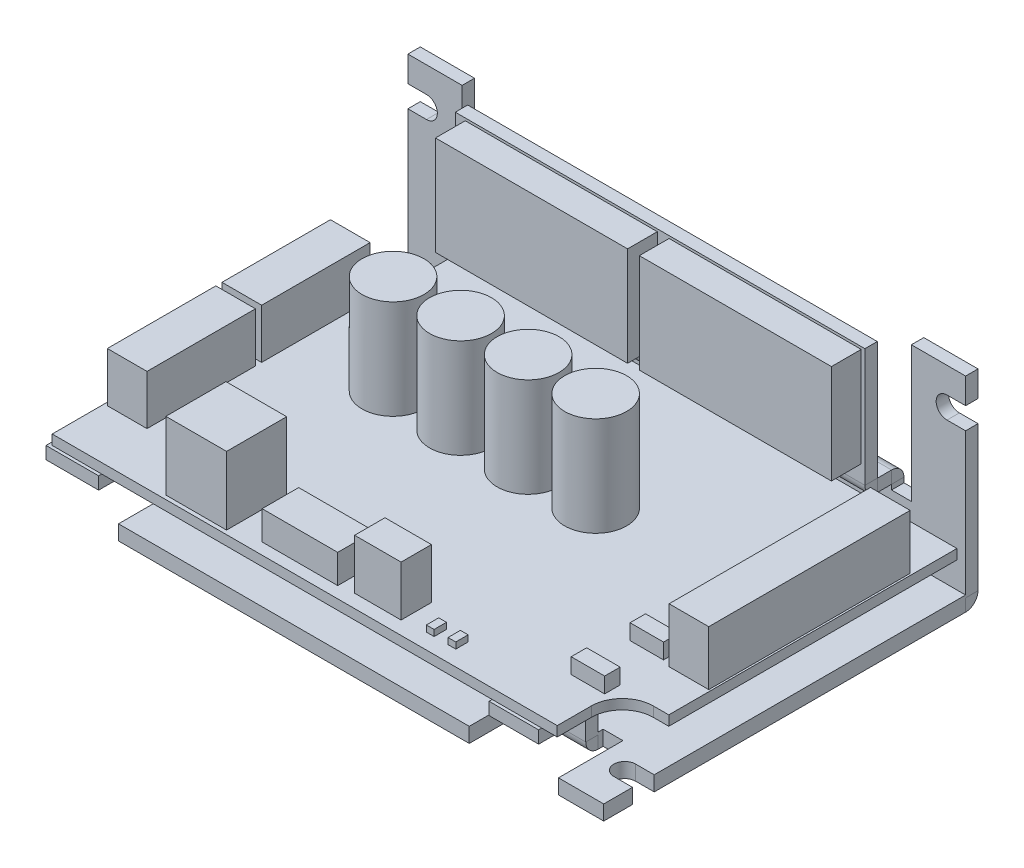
ISO-10303-21;
HEADER;
FILE_DESCRIPTION(('STEP AP214'),'2;1');
FILE_NAME('part.step','',(''),(''),'','','');
FILE_SCHEMA(('AUTOMOTIVE_DESIGN { 1 0 10303 214 1 1 1 1 }'));
ENDSEC;
DATA;
#1=APPLICATION_CONTEXT('core data for automotive mechanical design processes');
#2=APPLICATION_PROTOCOL_DEFINITION('international standard','automotive_design',2000,#1);
#3=PRODUCT_CONTEXT('',#1,'mechanical');
#4=PRODUCT('Part','Part','',(#3));
#5=PRODUCT_RELATED_PRODUCT_CATEGORY('part','',(#4));
#6=PRODUCT_DEFINITION_FORMATION('','',#4);
#7=PRODUCT_DEFINITION_CONTEXT('part definition',#1,'design');
#8=PRODUCT_DEFINITION('design','',#6,#7);
#9=PRODUCT_DEFINITION_SHAPE('','',#8);
#10=(LENGTH_UNIT() NAMED_UNIT(*) SI_UNIT(.MILLI.,.METRE.));
#11=(NAMED_UNIT(*) PLANE_ANGLE_UNIT() SI_UNIT($,.RADIAN.));
#12=(NAMED_UNIT(*) SI_UNIT($,.STERADIAN.) SOLID_ANGLE_UNIT());
#13=UNCERTAINTY_MEASURE_WITH_UNIT(LENGTH_MEASURE(1.E-05),#10,'distance_accuracy_value','');
#14=(GEOMETRIC_REPRESENTATION_CONTEXT(3) GLOBAL_UNCERTAINTY_ASSIGNED_CONTEXT((#13)) GLOBAL_UNIT_ASSIGNED_CONTEXT((#10,
#11,#12)) REPRESENTATION_CONTEXT('',''));
#15=CARTESIAN_POINT('',(0.,0.,0.));
#16=DIRECTION('',(0.,0.,1.));
#17=DIRECTION('',(1.,0.,0.));
#18=AXIS2_PLACEMENT_3D('',#15,#16,#17);
#19=CARTESIAN_POINT('',(1.45000000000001,32.6,-19.1));
#20=DIRECTION('',(1.,0.,0.));
#21=DIRECTION('',(0.,1.,0.));
#22=AXIS2_PLACEMENT_3D('',#19,#20,#21);
#23=PLANE('',#22);
#24=DIRECTION('',(0.,-1.,0.));
#25=VECTOR('',#24,1.);
#26=CARTESIAN_POINT('',(1.45000000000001,32.6,-23.9));
#27=LINE('',#26,#25);
#28=CARTESIAN_POINT('',(1.45000000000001,32.6,-23.9));
#29=VERTEX_POINT('',#28);
#30=CARTESIAN_POINT('',(1.45000000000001,16.6,-23.9));
#31=VERTEX_POINT('',#30);
#32=EDGE_CURVE('E215',#29,#31,#27,.T.);
#33=ORIENTED_EDGE('',*,*,#32,.T.);
#34=DIRECTION('',(0.,0.,-1.));
#35=VECTOR('',#34,1.);
#36=CARTESIAN_POINT('',(1.45000000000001,16.6,-19.1));
#37=LINE('',#36,#35);
#38=CARTESIAN_POINT('',(1.45000000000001,16.6,-19.1));
#39=VERTEX_POINT('',#38);
#40=EDGE_CURVE('E14',#39,#31,#37,.T.);
#41=ORIENTED_EDGE('',*,*,#40,.F.);
#42=DIRECTION('',(0.,-1.,0.));
#43=VECTOR('',#42,1.);
#44=CARTESIAN_POINT('',(1.45000000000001,32.6,-19.1));
#45=LINE('',#44,#43);
#46=CARTESIAN_POINT('',(1.45000000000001,32.6,-19.1));
#47=VERTEX_POINT('',#46);
#48=EDGE_CURVE('E203',#47,#39,#45,.T.);
#49=ORIENTED_EDGE('',*,*,#48,.F.);
#50=DIRECTION('',(0.,0.,-1.));
#51=VECTOR('',#50,1.);
#52=CARTESIAN_POINT('',(1.45000000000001,32.6,-19.1));
#53=LINE('',#52,#51);
#54=EDGE_CURVE('E211',#47,#29,#53,.T.);
#55=ORIENTED_EDGE('',*,*,#54,.T.);
#56=EDGE_LOOP('',(#33,#41,#49,#55));
#57=FACE_BOUND('',#56,.T.);
#58=ADVANCED_FACE('F152',(#57),#23,.F.);
#59=CARTESIAN_POINT('',(1.45000000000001,16.6,-19.1));
#60=DIRECTION('',(0.,1.,0.));
#61=DIRECTION('',(0.,0.,1.));
#62=AXIS2_PLACEMENT_3D('',#59,#60,#61);
#63=PLANE('',#62);
#64=DIRECTION('',(1.,0.,0.));
#65=VECTOR('',#64,1.);
#66=CARTESIAN_POINT('',(1.45000000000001,16.6,-23.9));
#67=LINE('',#66,#65);
#68=CARTESIAN_POINT('',(32.45,16.6,-23.9));
#69=VERTEX_POINT('',#68);
#70=EDGE_CURVE('E207',#31,#69,#67,.T.);
#71=ORIENTED_EDGE('',*,*,#70,.T.);
#72=DIRECTION('',(0.,0.,-1.));
#73=VECTOR('',#72,1.);
#74=CARTESIAN_POINT('',(32.45,16.6,-19.1));
#75=LINE('',#74,#73);
#76=CARTESIAN_POINT('',(32.45,16.6,-19.1));
#77=VERTEX_POINT('',#76);
#78=EDGE_CURVE('E160',#77,#69,#75,.T.);
#79=ORIENTED_EDGE('',*,*,#78,.F.);
#80=DIRECTION('',(1.,0.,0.));
#81=VECTOR('',#80,1.);
#82=CARTESIAN_POINT('',(1.45000000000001,16.6,-19.1));
#83=LINE('',#82,#81);
#84=EDGE_CURVE('E198',#39,#77,#83,.T.);
#85=ORIENTED_EDGE('',*,*,#84,.F.);
#86=ORIENTED_EDGE('',*,*,#40,.T.);
#87=EDGE_LOOP('',(#71,#79,#85,#86));
#88=FACE_BOUND('',#87,.T.);
#89=ADVANCED_FACE('F206',(#88),#63,.F.);
#90=CARTESIAN_POINT('',(32.45,32.6,-19.1));
#91=DIRECTION('',(-1.,0.,0.));
#92=DIRECTION('',(0.,-1.,0.));
#93=AXIS2_PLACEMENT_3D('',#90,#91,#92);
#94=PLANE('',#93);
#95=DIRECTION('',(0.,1.,0.));
#96=VECTOR('',#95,1.);
#97=CARTESIAN_POINT('',(32.45,32.6,-23.9));
#98=LINE('',#97,#96);
#99=CARTESIAN_POINT('',(32.45,32.6,-23.9));
#100=VERTEX_POINT('',#99);
#101=EDGE_CURVE('E185',#69,#100,#98,.T.);
#102=ORIENTED_EDGE('',*,*,#101,.T.);
#103=DIRECTION('',(0.,0.,-1.));
#104=VECTOR('',#103,1.);
#105=CARTESIAN_POINT('',(32.45,32.6,-19.1));
#106=LINE('',#105,#104);
#107=CARTESIAN_POINT('',(32.45,32.6,-19.1));
#108=VERTEX_POINT('',#107);
#109=EDGE_CURVE('E208',#108,#100,#106,.T.);
#110=ORIENTED_EDGE('',*,*,#109,.F.);
#111=DIRECTION('',(0.,1.,0.));
#112=VECTOR('',#111,1.);
#113=CARTESIAN_POINT('',(32.45,32.6,-19.1));
#114=LINE('',#113,#112);
#115=EDGE_CURVE('E201',#77,#108,#114,.T.);
#116=ORIENTED_EDGE('',*,*,#115,.F.);
#117=ORIENTED_EDGE('',*,*,#78,.T.);
#118=EDGE_LOOP('',(#102,#110,#116,#117));
#119=FACE_BOUND('',#118,.T.);
#120=ADVANCED_FACE('F209',(#119),#94,.F.);
#121=CARTESIAN_POINT('',(1.45000000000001,32.6,-19.1));
#122=DIRECTION('',(0.,-1.,0.));
#123=DIRECTION('',(0.,0.,-1.));
#124=AXIS2_PLACEMENT_3D('',#121,#122,#123);
#125=PLANE('',#124);
#126=DIRECTION('',(-1.,0.,0.));
#127=VECTOR('',#126,1.);
#128=CARTESIAN_POINT('',(1.45000000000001,32.6,-23.9));
#129=LINE('',#128,#127);
#130=EDGE_CURVE('E191',#100,#29,#129,.T.);
#131=ORIENTED_EDGE('',*,*,#130,.T.);
#132=ORIENTED_EDGE('',*,*,#54,.F.);
#133=DIRECTION('',(-1.,0.,0.));
#134=VECTOR('',#133,1.);
#135=CARTESIAN_POINT('',(1.45000000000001,32.6,-19.1));
#136=LINE('',#135,#134);
#137=EDGE_CURVE('E168',#108,#47,#136,.T.);
#138=ORIENTED_EDGE('',*,*,#137,.F.);
#139=ORIENTED_EDGE('',*,*,#109,.T.);
#140=EDGE_LOOP('',(#131,#132,#138,#139));
#141=FACE_BOUND('',#140,.T.);
#142=ADVANCED_FACE('F222',(#141),#125,.F.);
#143=CARTESIAN_POINT('',(0.,0.,-19.1));
#144=DIRECTION('',(0.,0.,1.));
#145=DIRECTION('',(1.,0.,0.));
#146=AXIS2_PLACEMENT_3D('',#143,#144,#145);
#147=PLANE('',#146);
#148=ORIENTED_EDGE('',*,*,#48,.T.);
#149=ORIENTED_EDGE('',*,*,#84,.T.);
#150=ORIENTED_EDGE('',*,*,#115,.T.);
#151=ORIENTED_EDGE('',*,*,#137,.T.);
#152=EDGE_LOOP('',(#148,#149,#150,#151));
#153=FACE_BOUND('',#152,.T.);
#154=ADVANCED_FACE('F199',(#153),#147,.T.);
#155=CARTESIAN_POINT('',(0.,0.,-23.9));
#156=DIRECTION('',(0.,0.,1.));
#157=DIRECTION('',(1.,0.,0.));
#158=AXIS2_PLACEMENT_3D('',#155,#156,#157);
#159=PLANE('',#158);
#160=ORIENTED_EDGE('',*,*,#32,.F.);
#161=ORIENTED_EDGE('',*,*,#130,.F.);
#162=ORIENTED_EDGE('',*,*,#101,.F.);
#163=ORIENTED_EDGE('',*,*,#70,.F.);
#164=EDGE_LOOP('',(#160,#161,#162,#163));
#165=FACE_BOUND('',#164,.T.);
#166=ADVANCED_FACE('F225',(#165),#159,.F.);
#167=CLOSED_SHELL('',(#58,#89,#120,#142,#154,#166));
#168=MANIFOLD_SOLID_BREP('B2',#167);
#169=CARTESIAN_POINT('',(-0.449999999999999,32.6,-19.1));
#170=DIRECTION('',(0.,-1.,0.));
#171=DIRECTION('',(0.,0.,-1.));
#172=AXIS2_PLACEMENT_3D('',#169,#170,#171);
#173=PLANE('',#172);
#174=DIRECTION('',(-1.,0.,0.));
#175=VECTOR('',#174,1.);
#176=CARTESIAN_POINT('',(-0.449999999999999,32.6,-23.9));
#177=LINE('',#176,#175);
#178=CARTESIAN_POINT('',(-0.449999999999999,32.6,-23.9));
#179=VERTEX_POINT('',#178);
#180=CARTESIAN_POINT('',(-31.45,32.6,-23.9));
#181=VERTEX_POINT('',#180);
#182=EDGE_CURVE('E348',#179,#181,#177,.T.);
#183=ORIENTED_EDGE('',*,*,#182,.T.);
#184=DIRECTION('',(0.,0.,-1.));
#185=VECTOR('',#184,1.);
#186=CARTESIAN_POINT('',(-31.45,32.6,-19.1));
#187=LINE('',#186,#185);
#188=CARTESIAN_POINT('',(-31.45,32.6,-19.1));
#189=VERTEX_POINT('',#188);
#190=EDGE_CURVE('E150',#189,#181,#187,.T.);
#191=ORIENTED_EDGE('',*,*,#190,.F.);
#192=DIRECTION('',(-1.,0.,0.));
#193=VECTOR('',#192,1.);
#194=CARTESIAN_POINT('',(-0.449999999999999,32.6,-19.1));
#195=LINE('',#194,#193);
#196=CARTESIAN_POINT('',(-0.449999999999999,32.6,-19.1));
#197=VERTEX_POINT('',#196);
#198=EDGE_CURVE('E336',#197,#189,#195,.T.);
#199=ORIENTED_EDGE('',*,*,#198,.F.);
#200=DIRECTION('',(0.,0.,-1.));
#201=VECTOR('',#200,1.);
#202=CARTESIAN_POINT('',(-0.449999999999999,32.6,-19.1));
#203=LINE('',#202,#201);
#204=EDGE_CURVE('E344',#197,#179,#203,.T.);
#205=ORIENTED_EDGE('',*,*,#204,.T.);
#206=EDGE_LOOP('',(#183,#191,#199,#205));
#207=FACE_BOUND('',#206,.T.);
#208=ADVANCED_FACE('F285',(#207),#173,.F.);
#209=CARTESIAN_POINT('',(-31.45,32.6,-19.1));
#210=DIRECTION('',(1.,0.,0.));
#211=DIRECTION('',(0.,1.,0.));
#212=AXIS2_PLACEMENT_3D('',#209,#210,#211);
#213=PLANE('',#212);
#214=DIRECTION('',(0.,-1.,0.));
#215=VECTOR('',#214,1.);
#216=CARTESIAN_POINT('',(-31.45,32.6,-23.9));
#217=LINE('',#216,#215);
#218=CARTESIAN_POINT('',(-31.45,16.6,-23.9));
#219=VERTEX_POINT('',#218);
#220=EDGE_CURVE('E340',#181,#219,#217,.T.);
#221=ORIENTED_EDGE('',*,*,#220,.T.);
#222=DIRECTION('',(0.,0.,-1.));
#223=VECTOR('',#222,1.);
#224=CARTESIAN_POINT('',(-31.45,16.6,-19.1));
#225=LINE('',#224,#223);
#226=CARTESIAN_POINT('',(-31.45,16.6,-19.1));
#227=VERTEX_POINT('',#226);
#228=EDGE_CURVE('E293',#227,#219,#225,.T.);
#229=ORIENTED_EDGE('',*,*,#228,.F.);
#230=DIRECTION('',(0.,-1.,0.));
#231=VECTOR('',#230,1.);
#232=CARTESIAN_POINT('',(-31.45,32.6,-19.1));
#233=LINE('',#232,#231);
#234=EDGE_CURVE('E331',#189,#227,#233,.T.);
#235=ORIENTED_EDGE('',*,*,#234,.F.);
#236=ORIENTED_EDGE('',*,*,#190,.T.);
#237=EDGE_LOOP('',(#221,#229,#235,#236));
#238=FACE_BOUND('',#237,.T.);
#239=ADVANCED_FACE('F339',(#238),#213,.F.);
#240=CARTESIAN_POINT('',(-31.45,16.6,-19.1));
#241=DIRECTION('',(0.,1.,0.));
#242=DIRECTION('',(0.,0.,1.));
#243=AXIS2_PLACEMENT_3D('',#240,#241,#242);
#244=PLANE('',#243);
#245=DIRECTION('',(1.,0.,0.));
#246=VECTOR('',#245,1.);
#247=CARTESIAN_POINT('',(-31.45,16.6,-23.9));
#248=LINE('',#247,#246);
#249=CARTESIAN_POINT('',(-0.449999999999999,16.6,-23.9));
#250=VERTEX_POINT('',#249);
#251=EDGE_CURVE('E318',#219,#250,#248,.T.);
#252=ORIENTED_EDGE('',*,*,#251,.T.);
#253=DIRECTION('',(0.,0.,-1.));
#254=VECTOR('',#253,1.);
#255=CARTESIAN_POINT('',(-0.449999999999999,16.6,-19.1));
#256=LINE('',#255,#254);
#257=CARTESIAN_POINT('',(-0.449999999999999,16.6,-19.1));
#258=VERTEX_POINT('',#257);
#259=EDGE_CURVE('E341',#258,#250,#256,.T.);
#260=ORIENTED_EDGE('',*,*,#259,.F.);
#261=DIRECTION('',(1.,0.,0.));
#262=VECTOR('',#261,1.);
#263=CARTESIAN_POINT('',(-31.45,16.6,-19.1));
#264=LINE('',#263,#262);
#265=EDGE_CURVE('E334',#227,#258,#264,.T.);
#266=ORIENTED_EDGE('',*,*,#265,.F.);
#267=ORIENTED_EDGE('',*,*,#228,.T.);
#268=EDGE_LOOP('',(#252,#260,#266,#267));
#269=FACE_BOUND('',#268,.T.);
#270=ADVANCED_FACE('F342',(#269),#244,.F.);
#271=CARTESIAN_POINT('',(-0.449999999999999,16.6,-19.1));
#272=DIRECTION('',(-1.,0.,0.));
#273=DIRECTION('',(0.,-1.,0.));
#274=AXIS2_PLACEMENT_3D('',#271,#272,#273);
#275=PLANE('',#274);
#276=DIRECTION('',(0.,1.,0.));
#277=VECTOR('',#276,1.);
#278=CARTESIAN_POINT('',(-0.449999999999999,16.6,-23.9));
#279=LINE('',#278,#277);
#280=EDGE_CURVE('E324',#250,#179,#279,.T.);
#281=ORIENTED_EDGE('',*,*,#280,.T.);
#282=ORIENTED_EDGE('',*,*,#204,.F.);
#283=DIRECTION('',(0.,1.,0.));
#284=VECTOR('',#283,1.);
#285=CARTESIAN_POINT('',(-0.449999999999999,16.6,-19.1));
#286=LINE('',#285,#284);
#287=EDGE_CURVE('E301',#258,#197,#286,.T.);
#288=ORIENTED_EDGE('',*,*,#287,.F.);
#289=ORIENTED_EDGE('',*,*,#259,.T.);
#290=EDGE_LOOP('',(#281,#282,#288,#289));
#291=FACE_BOUND('',#290,.T.);
#292=ADVANCED_FACE('F355',(#291),#275,.F.);
#293=CARTESIAN_POINT('',(0.,0.,-19.1));
#294=DIRECTION('',(0.,0.,1.));
#295=DIRECTION('',(1.,0.,0.));
#296=AXIS2_PLACEMENT_3D('',#293,#294,#295);
#297=PLANE('',#296);
#298=ORIENTED_EDGE('',*,*,#198,.T.);
#299=ORIENTED_EDGE('',*,*,#234,.T.);
#300=ORIENTED_EDGE('',*,*,#265,.T.);
#301=ORIENTED_EDGE('',*,*,#287,.T.);
#302=EDGE_LOOP('',(#298,#299,#300,#301));
#303=FACE_BOUND('',#302,.T.);
#304=ADVANCED_FACE('F332',(#303),#297,.T.);
#305=CARTESIAN_POINT('',(0.,0.,-23.9));
#306=DIRECTION('',(0.,0.,1.));
#307=DIRECTION('',(1.,0.,0.));
#308=AXIS2_PLACEMENT_3D('',#305,#306,#307);
#309=PLANE('',#308);
#310=ORIENTED_EDGE('',*,*,#182,.F.);
#311=ORIENTED_EDGE('',*,*,#280,.F.);
#312=ORIENTED_EDGE('',*,*,#251,.F.);
#313=ORIENTED_EDGE('',*,*,#220,.F.);
#314=EDGE_LOOP('',(#310,#311,#312,#313));
#315=FACE_BOUND('',#314,.T.);
#316=ADVANCED_FACE('F358',(#315),#309,.F.);
#317=CLOSED_SHELL('',(#208,#239,#270,#292,#304,#316));
#318=MANIFOLD_SOLID_BREP('B8',#317);
#319=CARTESIAN_POINT('',(-45.,2.,-28.2));
#320=DIRECTION('',(0.,0.,1.));
#321=DIRECTION('',(0.,-1.,0.));
#322=AXIS2_PLACEMENT_3D('',#319,#320,#321);
#323=PLANE('',#322);
#324=DIRECTION('',(1.,0.,0.));
#325=VECTOR('',#324,1.);
#326=CARTESIAN_POINT('',(-45.,2.,-28.2));
#327=LINE('',#326,#325);
#328=CARTESIAN_POINT('',(32.,2.,-28.2));
#329=VERTEX_POINT('',#328);
#330=CARTESIAN_POINT('',(-33.5,2.,-28.2));
#331=VERTEX_POINT('',#330);
#332=EDGE_CURVE('E1738',#329,#331,#327,.F.);
#333=ORIENTED_EDGE('',*,*,#332,.F.);
#334=DIRECTION('',(0.,-1.,0.));
#335=VECTOR('',#334,1.);
#336=CARTESIAN_POINT('',(32.,2.4,-28.2));
#337=LINE('',#336,#335);
#338=CARTESIAN_POINT('',(32.,2.4,-28.2));
#339=VERTEX_POINT('',#338);
#340=EDGE_CURVE('E1273',#339,#329,#337,.T.);
#341=ORIENTED_EDGE('',*,*,#340,.F.);
#342=DIRECTION('',(-1.,0.,0.));
#343=VECTOR('',#342,1.);
#344=CARTESIAN_POINT('',(45.,2.4,-28.2));
#345=LINE('',#344,#343);
#346=CARTESIAN_POINT('',(45.,2.4,-28.2));
#347=VERTEX_POINT('',#346);
#348=EDGE_CURVE('E1254',#347,#339,#345,.T.);
#349=ORIENTED_EDGE('',*,*,#348,.F.);
#350=DIRECTION('',(0.,1.,0.));
#351=VECTOR('',#350,1.);
#352=CARTESIAN_POINT('',(45.,2.,-28.2));
#353=LINE('',#352,#351);
#354=CARTESIAN_POINT('',(45.,25.3499999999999,-28.2));
#355=VERTEX_POINT('',#354);
#356=EDGE_CURVE('E2392',#355,#347,#353,.F.);
#357=ORIENTED_EDGE('',*,*,#356,.F.);
#358=DIRECTION('',(-1.,0.,0.));
#359=VECTOR('',#358,1.);
#360=CARTESIAN_POINT('',(42.,25.3499999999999,-28.2));
#361=LINE('',#360,#359);
#362=CARTESIAN_POINT('',(42.,25.3499999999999,-28.2));
#363=VERTEX_POINT('',#362);
#364=EDGE_CURVE('E1668',#355,#363,#361,.T.);
#365=ORIENTED_EDGE('',*,*,#364,.T.);
#366=CARTESIAN_POINT('',(42.,27.0999999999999,-28.2));
#367=DIRECTION('',(0.,0.,-1.));
#368=DIRECTION('',(1.,0.,0.));
#369=AXIS2_PLACEMENT_3D('',#366,#367,#368);
#370=CIRCLE('',#369,1.75);
#371=CARTESIAN_POINT('',(42.,28.8499999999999,-28.2));
#372=VERTEX_POINT('',#371);
#373=EDGE_CURVE('E1675',#363,#372,#370,.T.);
#374=ORIENTED_EDGE('',*,*,#373,.T.);
#375=DIRECTION('',(1.,0.,0.));
#376=VECTOR('',#375,1.);
#377=CARTESIAN_POINT('',(45.,28.8499999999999,-28.2));
#378=LINE('',#377,#376);
#379=CARTESIAN_POINT('',(45.,28.8499999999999,-28.2000000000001));
#380=VERTEX_POINT('',#379);
#381=EDGE_CURVE('E1664',#372,#380,#378,.T.);
#382=ORIENTED_EDGE('',*,*,#381,.T.);
#383=CARTESIAN_POINT('',(45.,33.,-28.2000000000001));
#384=VERTEX_POINT('',#383);
#385=EDGE_CURVE('E2389',#384,#380,#353,.F.);
#386=ORIENTED_EDGE('',*,*,#385,.F.);
#387=DIRECTION('',(-1.,0.,0.));
#388=VECTOR('',#387,1.);
#389=CARTESIAN_POINT('',(45.,33.,-28.2000000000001));
#390=LINE('',#389,#388);
#391=CARTESIAN_POINT('',(36.25,33.,-28.2000000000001));
#392=VERTEX_POINT('',#391);
#393=EDGE_CURVE('E2396',#392,#384,#390,.F.);
#394=ORIENTED_EDGE('',*,*,#393,.F.);
#395=DIRECTION('',(0.,-1.,0.));
#396=VECTOR('',#395,1.);
#397=CARTESIAN_POINT('',(36.25,33.,-28.2000000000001));
#398=LINE('',#397,#396);
#399=CARTESIAN_POINT('',(36.25,11.1,-28.2));
#400=VERTEX_POINT('',#399);
#401=EDGE_CURVE('E2349',#392,#400,#398,.T.);
#402=ORIENTED_EDGE('',*,*,#401,.T.);
#403=DIRECTION('',(-1.,0.,0.));
#404=VECTOR('',#403,1.);
#405=CARTESIAN_POINT('',(36.25,11.1,-28.2));
#406=LINE('',#405,#404);
#407=CARTESIAN_POINT('',(33.05,11.1,-28.2));
#408=VERTEX_POINT('',#407);
#409=EDGE_CURVE('E2749',#400,#408,#406,.T.);
#410=ORIENTED_EDGE('',*,*,#409,.T.);
#411=DIRECTION('',(0.,-1.,0.));
#412=VECTOR('',#411,1.);
#413=CARTESIAN_POINT('',(33.05,11.9,-28.2));
#414=LINE('',#413,#412);
#415=CARTESIAN_POINT('',(33.05,11.9,-28.2));
#416=VERTEX_POINT('',#415);
#417=EDGE_CURVE('E1845',#416,#408,#414,.T.);
#418=ORIENTED_EDGE('',*,*,#417,.F.);
#419=DIRECTION('',(1.,0.,0.));
#420=VECTOR('',#419,1.);
#421=CARTESIAN_POINT('',(33.05,11.9,-28.2));
#422=LINE('',#421,#420);
#423=CARTESIAN_POINT('',(-33.05,11.9,-28.2));
#424=VERTEX_POINT('',#423);
#425=EDGE_CURVE('E1797',#416,#424,#422,.F.);
#426=ORIENTED_EDGE('',*,*,#425,.T.);
#427=DIRECTION('',(0.,-1.,0.));
#428=VECTOR('',#427,1.);
#429=CARTESIAN_POINT('',(-33.05,11.9,-28.2));
#430=LINE('',#429,#428);
#431=CARTESIAN_POINT('',(-33.05,11.1,-28.2));
#432=VERTEX_POINT('',#431);
#433=EDGE_CURVE('E1841',#424,#432,#430,.T.);
#434=ORIENTED_EDGE('',*,*,#433,.T.);
#435=CARTESIAN_POINT('',(-36.25,11.1,-28.2));
#436=VERTEX_POINT('',#435);
#437=EDGE_CURVE('E1842',#432,#436,#406,.T.);
#438=ORIENTED_EDGE('',*,*,#437,.T.);
#439=DIRECTION('',(0.,1.,0.));
#440=VECTOR('',#439,1.);
#441=CARTESIAN_POINT('',(-36.25,33.,-28.2000000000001));
#442=LINE('',#441,#440);
#443=CARTESIAN_POINT('',(-36.25,33.,-28.2000000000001));
#444=VERTEX_POINT('',#443);
#445=EDGE_CURVE('E2361',#436,#444,#442,.T.);
#446=ORIENTED_EDGE('',*,*,#445,.T.);
#447=CARTESIAN_POINT('',(-45.,33.,-28.2000000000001));
#448=VERTEX_POINT('',#447);
#449=EDGE_CURVE('E2393',#448,#444,#390,.F.);
#450=ORIENTED_EDGE('',*,*,#449,.F.);
#451=DIRECTION('',(0.,-1.,0.));
#452=VECTOR('',#451,1.);
#453=CARTESIAN_POINT('',(-45.,33.,-28.2000000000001));
#454=LINE('',#453,#452);
#455=CARTESIAN_POINT('',(-45.,28.8499999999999,-28.2));
#456=VERTEX_POINT('',#455);
#457=EDGE_CURVE('E2352',#456,#448,#454,.F.);
#458=ORIENTED_EDGE('',*,*,#457,.F.);
#459=DIRECTION('',(-1.,0.,0.));
#460=VECTOR('',#459,1.);
#461=CARTESIAN_POINT('',(-45.,28.8499999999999,-28.2));
#462=LINE('',#461,#460);
#463=CARTESIAN_POINT('',(-42.,28.8499999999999,-28.2));
#464=VERTEX_POINT('',#463);
#465=EDGE_CURVE('E1693',#464,#456,#462,.T.);
#466=ORIENTED_EDGE('',*,*,#465,.F.);
#467=CARTESIAN_POINT('',(-42.,27.0999999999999,-28.2));
#468=DIRECTION('',(0.,0.,1.));
#469=DIRECTION('',(-1.,0.,0.));
#470=AXIS2_PLACEMENT_3D('',#467,#468,#469);
#471=CIRCLE('',#470,1.75);
#472=CARTESIAN_POINT('',(-42.,25.3499999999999,-28.2));
#473=VERTEX_POINT('',#472);
#474=EDGE_CURVE('E1702',#473,#464,#471,.T.);
#475=ORIENTED_EDGE('',*,*,#474,.F.);
#476=DIRECTION('',(1.,0.,0.));
#477=VECTOR('',#476,1.);
#478=CARTESIAN_POINT('',(-42.,25.3499999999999,-28.2));
#479=LINE('',#478,#477);
#480=CARTESIAN_POINT('',(-45.,25.3499999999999,-28.2000000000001));
#481=VERTEX_POINT('',#480);
#482=EDGE_CURVE('E1683',#481,#473,#479,.T.);
#483=ORIENTED_EDGE('',*,*,#482,.F.);
#484=CARTESIAN_POINT('',(-45.,2.4,-28.2));
#485=VERTEX_POINT('',#484);
#486=EDGE_CURVE('E2397',#485,#481,#454,.F.);
#487=ORIENTED_EDGE('',*,*,#486,.F.);
#488=DIRECTION('',(-1.,0.,0.));
#489=VECTOR('',#488,1.);
#490=CARTESIAN_POINT('',(-33.5,2.4,-28.2));
#491=LINE('',#490,#489);
#492=CARTESIAN_POINT('',(-33.5,2.4,-28.2));
#493=VERTEX_POINT('',#492);
#494=EDGE_CURVE('E1195',#493,#485,#491,.T.);
#495=ORIENTED_EDGE('',*,*,#494,.F.);
#496=DIRECTION('',(0.,-1.,0.));
#497=VECTOR('',#496,1.);
#498=CARTESIAN_POINT('',(-33.5,2.4,-28.2));
#499=LINE('',#498,#497);
#500=EDGE_CURVE('E1271',#493,#331,#499,.T.);
#501=ORIENTED_EDGE('',*,*,#500,.T.);
#502=EDGE_LOOP('',(#333,#341,#349,#357,#365,#374,#382,#386,#394,#402,#410,#418,#426,#434,#438,
#446,#450,#458,#466,#475,#483,#487,#495,#501));
#503=FACE_BOUND('',#502,.T.);
#504=ADVANCED_FACE('F409',(#503),#323,.T.);
#505=CARTESIAN_POINT('',(44.5,9.10000000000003,29.7));
#506=DIRECTION('',(0.,-1.,0.));
#507=DIRECTION('',(0.,0.,-1.));
#508=AXIS2_PLACEMENT_3D('',#505,#506,#507);
#509=PLANE('',#508);
#510=DIRECTION('',(0.,0.,1.));
#511=VECTOR('',#510,1.);
#512=CARTESIAN_POINT('',(2.15,9.09999999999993,22.65));
#513=LINE('',#512,#511);
#514=CARTESIAN_POINT('',(2.15,9.09999999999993,22.65));
#515=VERTEX_POINT('',#514);
#516=CARTESIAN_POINT('',(2.15,9.10000000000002,27.55));
#517=VERTEX_POINT('',#516);
#518=EDGE_CURVE('E1319',#515,#517,#513,.T.);
#519=ORIENTED_EDGE('',*,*,#518,.F.);
#520=DIRECTION('',(-1.,0.,0.));
#521=VECTOR('',#520,1.);
#522=CARTESIAN_POINT('',(2.15,9.09999999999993,22.65));
#523=LINE('',#522,#521);
#524=CARTESIAN_POINT('',(9.65,9.1,22.65));
#525=VERTEX_POINT('',#524);
#526=EDGE_CURVE('E1328',#525,#515,#523,.T.);
#527=ORIENTED_EDGE('',*,*,#526,.F.);
#528=DIRECTION('',(0.,0.,-1.));
#529=VECTOR('',#528,1.);
#530=CARTESIAN_POINT('',(9.65,9.09999999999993,22.65));
#531=LINE('',#530,#529);
#532=CARTESIAN_POINT('',(9.65,9.10000000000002,27.55));
#533=VERTEX_POINT('',#532);
#534=EDGE_CURVE('E1325',#533,#525,#531,.T.);
#535=ORIENTED_EDGE('',*,*,#534,.F.);
#536=DIRECTION('',(1.,0.,0.));
#537=VECTOR('',#536,1.);
#538=CARTESIAN_POINT('',(2.15,9.09999999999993,27.55));
#539=LINE('',#538,#537);
#540=EDGE_CURVE('E1322',#517,#533,#539,.T.);
#541=ORIENTED_EDGE('',*,*,#540,.F.);
#542=EDGE_LOOP('',(#519,#527,#535,#541));
#543=FACE_BOUND('',#542,.T.);
#544=DIRECTION('',(0.,0.,1.));
#545=VECTOR('',#544,1.);
#546=CARTESIAN_POINT('',(-26.8,9.09999999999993,19.36));
#547=LINE('',#546,#545);
#548=CARTESIAN_POINT('',(-26.8,9.09999999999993,19.36));
#549=VERTEX_POINT('',#548);
#550=CARTESIAN_POINT('',(-26.8,9.10000000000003,29.06));
#551=VERTEX_POINT('',#550);
#552=EDGE_CURVE('E1359',#549,#551,#547,.T.);
#553=ORIENTED_EDGE('',*,*,#552,.F.);
#554=DIRECTION('',(-1.,0.,0.));
#555=VECTOR('',#554,1.);
#556=CARTESIAN_POINT('',(-26.8,9.09999999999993,19.36));
#557=LINE('',#556,#555);
#558=CARTESIAN_POINT('',(-17.,9.09999999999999,19.36));
#559=VERTEX_POINT('',#558);
#560=EDGE_CURVE('E1364',#559,#549,#557,.T.);
#561=ORIENTED_EDGE('',*,*,#560,.F.);
#562=DIRECTION('',(0.,0.,-1.));
#563=VECTOR('',#562,1.);
#564=CARTESIAN_POINT('',(-17.,9.09999999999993,19.36));
#565=LINE('',#564,#563);
#566=CARTESIAN_POINT('',(-17.,9.10000000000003,29.06));
#567=VERTEX_POINT('',#566);
#568=EDGE_CURVE('E1376',#567,#559,#565,.T.);
#569=ORIENTED_EDGE('',*,*,#568,.F.);
#570=DIRECTION('',(1.,0.,0.));
#571=VECTOR('',#570,1.);
#572=CARTESIAN_POINT('',(-26.8,9.09999999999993,29.06));
#573=LINE('',#572,#571);
#574=EDGE_CURVE('E1373',#551,#567,#573,.T.);
#575=ORIENTED_EDGE('',*,*,#574,.F.);
#576=EDGE_LOOP('',(#553,#561,#569,#575));
#577=FACE_BOUND('',#576,.T.);
#578=DIRECTION('',(0.,0.,1.));
#579=VECTOR('',#578,1.);
#580=CARTESIAN_POINT('',(-44.,9.09999999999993,-14.7));
#581=LINE('',#580,#579);
#582=CARTESIAN_POINT('',(-44.,9.09999999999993,-14.7));
#583=VERTEX_POINT('',#582);
#584=CARTESIAN_POINT('',(-44.,9.09999999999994,2.8));
#585=VERTEX_POINT('',#584);
#586=EDGE_CURVE('E1425',#583,#585,#581,.T.);
#587=ORIENTED_EDGE('',*,*,#586,.F.);
#588=DIRECTION('',(-1.,0.,0.));
#589=VECTOR('',#588,1.);
#590=CARTESIAN_POINT('',(-44.,9.09999999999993,-14.7));
#591=LINE('',#590,#589);
#592=CARTESIAN_POINT('',(-37.6,9.09999999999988,-14.7));
#593=VERTEX_POINT('',#592);
#594=EDGE_CURVE('E1430',#593,#583,#591,.T.);
#595=ORIENTED_EDGE('',*,*,#594,.F.);
#596=DIRECTION('',(0.,0.,-1.));
#597=VECTOR('',#596,1.);
#598=CARTESIAN_POINT('',(-37.6,9.09999999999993,-14.7));
#599=LINE('',#598,#597);
#600=CARTESIAN_POINT('',(-37.6,9.09999999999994,2.8));
#601=VERTEX_POINT('',#600);
#602=EDGE_CURVE('E1442',#601,#593,#599,.T.);
#603=ORIENTED_EDGE('',*,*,#602,.F.);
#604=DIRECTION('',(1.,0.,0.));
#605=VECTOR('',#604,1.);
#606=CARTESIAN_POINT('',(-44.,9.09999999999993,2.8));
#607=LINE('',#606,#605);
#608=EDGE_CURVE('E1439',#585,#601,#607,.T.);
#609=ORIENTED_EDGE('',*,*,#608,.F.);
#610=EDGE_LOOP('',(#587,#595,#603,#609));
#611=FACE_BOUND('',#610,.T.);
#612=DIRECTION('',(0.,0.,1.));
#613=VECTOR('',#612,1.);
#614=CARTESIAN_POINT('',(31.,9.09999999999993,9.45000000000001));
#615=LINE('',#614,#613);
#616=CARTESIAN_POINT('',(31.,9.09999999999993,9.45000000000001));
#617=VERTEX_POINT('',#616);
#618=CARTESIAN_POINT('',(31.,9.09999999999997,11.95));
#619=VERTEX_POINT('',#618);
#620=EDGE_CURVE('E1491',#617,#619,#615,.T.);
#621=ORIENTED_EDGE('',*,*,#620,.F.);
#622=DIRECTION('',(-1.,0.,0.));
#623=VECTOR('',#622,1.);
#624=CARTESIAN_POINT('',(31.,9.09999999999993,9.45000000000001));
#625=LINE('',#624,#623);
#626=CARTESIAN_POINT('',(36.4,9.09999999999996,9.45000000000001));
#627=VERTEX_POINT('',#626);
#628=EDGE_CURVE('E1496',#627,#617,#625,.T.);
#629=ORIENTED_EDGE('',*,*,#628,.F.);
#630=DIRECTION('',(0.,0.,-1.));
#631=VECTOR('',#630,1.);
#632=CARTESIAN_POINT('',(36.4,9.09999999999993,9.45000000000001));
#633=LINE('',#632,#631);
#634=CARTESIAN_POINT('',(36.4,9.09999999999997,11.95));
#635=VERTEX_POINT('',#634);
#636=EDGE_CURVE('E1508',#635,#627,#633,.T.);
#637=ORIENTED_EDGE('',*,*,#636,.F.);
#638=DIRECTION('',(1.,0.,0.));
#639=VECTOR('',#638,1.);
#640=CARTESIAN_POINT('',(31.,9.09999999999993,11.95));
#641=LINE('',#640,#639);
#642=EDGE_CURVE('E1505',#619,#635,#641,.T.);
#643=ORIENTED_EDGE('',*,*,#642,.F.);
#644=EDGE_LOOP('',(#621,#629,#637,#643));
#645=FACE_BOUND('',#644,.T.);
#646=CARTESIAN_POINT('',(-1.19999999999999,9.09999999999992,-3.8));
#647=DIRECTION('',(0.,-1.,0.));
#648=DIRECTION('',(0.,0.,-1.));
#649=AXIS2_PLACEMENT_3D('',#646,#647,#648);
#650=CIRCLE('',#649,5.);
#651=CARTESIAN_POINT('',(-1.19999999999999,9.0999999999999,-8.8));
#652=VERTEX_POINT('',#651);
#653=EDGE_CURVE('E417',#652,#652,#650,.F.);
#654=ORIENTED_EDGE('',*,*,#653,.F.);
#655=EDGE_LOOP('',(#654));
#656=FACE_BOUND('',#655,.T.);
#657=CARTESIAN_POINT('',(-23.,9.09999999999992,-3.8));
#658=DIRECTION('',(0.,-1.,0.));
#659=DIRECTION('',(0.,0.,-1.));
#660=AXIS2_PLACEMENT_3D('',#657,#658,#659);
#661=CIRCLE('',#660,5.);
#662=CARTESIAN_POINT('',(-23.,9.0999999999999,-8.8));
#663=VERTEX_POINT('',#662);
#664=EDGE_CURVE('E1901',#663,#663,#661,.F.);
#665=ORIENTED_EDGE('',*,*,#664,.F.);
#666=EDGE_LOOP('',(#665));
#667=FACE_BOUND('',#666,.T.);
#668=DIRECTION('',(0.,0.,1.));
#669=VECTOR('',#668,1.);
#670=CARTESIAN_POINT('',(16.875,9.09999999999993,27.2));
#671=LINE('',#670,#669);
#672=CARTESIAN_POINT('',(16.875,9.09999999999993,25.2));
#673=VERTEX_POINT('',#672);
#674=CARTESIAN_POINT('',(16.875,9.10000000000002,27.2));
#675=VERTEX_POINT('',#674);
#676=EDGE_CURVE('E1569',#673,#675,#671,.T.);
#677=ORIENTED_EDGE('',*,*,#676,.F.);
#678=DIRECTION('',(-1.,0.,0.));
#679=VECTOR('',#678,1.);
#680=CARTESIAN_POINT('',(16.875,9.09999999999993,25.2));
#681=LINE('',#680,#679);
#682=CARTESIAN_POINT('',(18.125,9.10000000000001,25.2));
#683=VERTEX_POINT('',#682);
#684=EDGE_CURVE('E1574',#683,#673,#681,.T.);
#685=ORIENTED_EDGE('',*,*,#684,.F.);
#686=DIRECTION('',(0.,0.,-1.));
#687=VECTOR('',#686,1.);
#688=CARTESIAN_POINT('',(18.125,9.09999999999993,27.2));
#689=LINE('',#688,#687);
#690=CARTESIAN_POINT('',(18.125,9.10000000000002,27.2));
#691=VERTEX_POINT('',#690);
#692=EDGE_CURVE('E1586',#691,#683,#689,.T.);
#693=ORIENTED_EDGE('',*,*,#692,.F.);
#694=DIRECTION('',(1.,0.,0.));
#695=VECTOR('',#694,1.);
#696=CARTESIAN_POINT('',(16.875,9.09999999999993,27.2));
#697=LINE('',#696,#695);
#698=EDGE_CURVE('E1583',#675,#691,#697,.T.);
#699=ORIENTED_EDGE('',*,*,#698,.F.);
#700=EDGE_LOOP('',(#677,#685,#693,#699));
#701=FACE_BOUND('',#700,.T.);
#702=DIRECTION('',(1.,0.,0.));
#703=VECTOR('',#702,1.);
#704=CARTESIAN_POINT('',(44.5,9.10000000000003,29.7));
#705=LINE('',#704,#703);
#706=CARTESIAN_POINT('',(-44.5,9.10000000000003,29.7));
#707=VERTEX_POINT('',#706);
#708=CARTESIAN_POINT('',(37.,9.09999999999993,29.7));
#709=VERTEX_POINT('',#708);
#710=EDGE_CURVE('E1641',#707,#709,#705,.T.);
#711=ORIENTED_EDGE('',*,*,#710,.T.);
#712=DIRECTION('',(0.,0.,1.));
#713=VECTOR('',#712,1.);
#714=CARTESIAN_POINT('',(37.,9.09999999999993,29.7));
#715=LINE('',#714,#713);
#716=CARTESIAN_POINT('',(37.,9.09999999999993,24.2));
#717=VERTEX_POINT('',#716);
#718=EDGE_CURVE('E1607',#717,#709,#715,.T.);
#719=ORIENTED_EDGE('',*,*,#718,.F.);
#720=CARTESIAN_POINT('',(42.,9.10000000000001,24.2));
#721=DIRECTION('',(0.,-1.,0.));
#722=DIRECTION('',(0.,0.,-1.));
#723=AXIS2_PLACEMENT_3D('',#720,#721,#722);
#724=CIRCLE('',#723,5.);
#725=CARTESIAN_POINT('',(42.,9.09999999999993,19.2));
#726=VERTEX_POINT('',#725);
#727=EDGE_CURVE('E1897',#717,#726,#724,.T.);
#728=ORIENTED_EDGE('',*,*,#727,.T.);
#729=DIRECTION('',(-1.,0.,0.));
#730=VECTOR('',#729,1.);
#731=CARTESIAN_POINT('',(44.5,9.09999999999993,19.2));
#732=LINE('',#731,#730);
#733=CARTESIAN_POINT('',(44.5,9.09999999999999,19.2));
#734=VERTEX_POINT('',#733);
#735=EDGE_CURVE('E1602',#734,#726,#732,.T.);
#736=ORIENTED_EDGE('',*,*,#735,.F.);
#737=DIRECTION('',(0.,0.,-1.));
#738=VECTOR('',#737,1.);
#739=CARTESIAN_POINT('',(44.5,9.09999999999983,-27.3));
#740=LINE('',#739,#738);
#741=CARTESIAN_POINT('',(44.5,9.09999999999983,-27.3));
#742=VERTEX_POINT('',#741);
#743=EDGE_CURVE('E1633',#734,#742,#740,.T.);
#744=ORIENTED_EDGE('',*,*,#743,.T.);
#745=DIRECTION('',(-1.,0.,0.));
#746=VECTOR('',#745,1.);
#747=CARTESIAN_POINT('',(44.5,9.09999999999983,-27.3));
#748=LINE('',#747,#746);
#749=CARTESIAN_POINT('',(-37.,9.09999999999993,-27.3));
#750=VERTEX_POINT('',#749);
#751=EDGE_CURVE('E1635',#742,#750,#748,.T.);
#752=ORIENTED_EDGE('',*,*,#751,.T.);
#753=DIRECTION('',(0.,0.,-1.));
#754=VECTOR('',#753,1.);
#755=CARTESIAN_POINT('',(-37.,9.09999999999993,-27.3));
#756=LINE('',#755,#754);
#757=CARTESIAN_POINT('',(-37.,9.09999999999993,-21.3));
#758=VERTEX_POINT('',#757);
#759=EDGE_CURVE('E1622',#758,#750,#756,.T.);
#760=ORIENTED_EDGE('',*,*,#759,.F.);
#761=CARTESIAN_POINT('',(-42.,9.09999999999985,-21.3));
#762=DIRECTION('',(0.,-1.,0.));
#763=DIRECTION('',(0.,0.,-1.));
#764=AXIS2_PLACEMENT_3D('',#761,#762,#763);
#765=CIRCLE('',#764,5.);
#766=CARTESIAN_POINT('',(-42.,9.09999999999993,-16.3));
#767=VERTEX_POINT('',#766);
#768=EDGE_CURVE('E1893',#758,#767,#765,.T.);
#769=ORIENTED_EDGE('',*,*,#768,.T.);
#770=DIRECTION('',(1.,0.,0.));
#771=VECTOR('',#770,1.);
#772=CARTESIAN_POINT('',(-44.5,9.09999999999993,-16.3));
#773=LINE('',#772,#771);
#774=CARTESIAN_POINT('',(-44.5,9.09999999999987,-16.3));
#775=VERTEX_POINT('',#774);
#776=EDGE_CURVE('E1616',#775,#767,#773,.T.);
#777=ORIENTED_EDGE('',*,*,#776,.F.);
#778=DIRECTION('',(0.,0.,1.));
#779=VECTOR('',#778,1.);
#780=CARTESIAN_POINT('',(-44.5,9.09999999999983,-27.3));
#781=LINE('',#780,#779);
#782=EDGE_CURVE('E1639',#775,#707,#781,.T.);
#783=ORIENTED_EDGE('',*,*,#782,.T.);
#784=EDGE_LOOP('',(#711,#719,#728,#736,#744,#752,#760,#769,#777,#783));
#785=FACE_BOUND('',#784,.T.);
#786=DIRECTION('',(0.,0.,-1.));
#787=VECTOR('',#786,1.);
#788=CARTESIAN_POINT('',(14.625,9.09999999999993,25.2));
#789=LINE('',#788,#787);
#790=CARTESIAN_POINT('',(14.625,9.09999999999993,27.2));
#791=VERTEX_POINT('',#790);
#792=CARTESIAN_POINT('',(14.625,9.10000000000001,25.2));
#793=VERTEX_POINT('',#792);
#794=EDGE_CURVE('E1536',#791,#793,#789,.T.);
#795=ORIENTED_EDGE('',*,*,#794,.F.);
#796=DIRECTION('',(1.,0.,0.));
#797=VECTOR('',#796,1.);
#798=CARTESIAN_POINT('',(14.625,9.09999999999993,27.2));
#799=LINE('',#798,#797);
#800=CARTESIAN_POINT('',(13.375,9.10000000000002,27.2));
#801=VERTEX_POINT('',#800);
#802=EDGE_CURVE('E1541',#801,#791,#799,.T.);
#803=ORIENTED_EDGE('',*,*,#802,.F.);
#804=DIRECTION('',(0.,0.,1.));
#805=VECTOR('',#804,1.);
#806=CARTESIAN_POINT('',(13.375,9.09999999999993,25.2));
#807=LINE('',#806,#805);
#808=CARTESIAN_POINT('',(13.375,9.10000000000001,25.2));
#809=VERTEX_POINT('',#808);
#810=EDGE_CURVE('E1553',#809,#801,#807,.T.);
#811=ORIENTED_EDGE('',*,*,#810,.F.);
#812=DIRECTION('',(-1.,0.,0.));
#813=VECTOR('',#812,1.);
#814=CARTESIAN_POINT('',(14.625,9.09999999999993,25.2));
#815=LINE('',#814,#813);
#816=EDGE_CURVE('E1550',#793,#809,#815,.T.);
#817=ORIENTED_EDGE('',*,*,#816,.F.);
#818=EDGE_LOOP('',(#795,#803,#811,#817));
#819=FACE_BOUND('',#818,.T.);
#820=CARTESIAN_POINT('',(-12.1,9.09999999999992,-3.8));
#821=DIRECTION('',(0.,-1.,0.));
#822=DIRECTION('',(0.,0.,-1.));
#823=AXIS2_PLACEMENT_3D('',#820,#821,#822);
#824=CIRCLE('',#823,5.);
#825=CARTESIAN_POINT('',(-12.1,9.0999999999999,-8.8));
#826=VERTEX_POINT('',#825);
#827=EDGE_CURVE('E1904',#826,#826,#824,.F.);
#828=ORIENTED_EDGE('',*,*,#827,.F.);
#829=EDGE_LOOP('',(#828));
#830=FACE_BOUND('',#829,.T.);
#831=CARTESIAN_POINT('',(9.70000000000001,9.09999999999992,-3.8));
#832=DIRECTION('',(0.,-1.,0.));
#833=DIRECTION('',(0.,0.,-1.));
#834=AXIS2_PLACEMENT_3D('',#831,#832,#833);
#835=CIRCLE('',#834,5.);
#836=CARTESIAN_POINT('',(9.70000000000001,9.0999999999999,-8.8));
#837=VERTEX_POINT('',#836);
#838=EDGE_CURVE('E283',#837,#837,#835,.F.);
#839=ORIENTED_EDGE('',*,*,#838,.F.);
#840=EDGE_LOOP('',(#839));
#841=FACE_BOUND('',#840,.T.);
#842=DIRECTION('',(0.,0.,1.));
#843=VECTOR('',#842,1.);
#844=CARTESIAN_POINT('',(31.,9.09999999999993,18.95));
#845=LINE('',#844,#843);
#846=CARTESIAN_POINT('',(31.,9.09999999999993,18.95));
#847=VERTEX_POINT('',#846);
#848=CARTESIAN_POINT('',(31.,9.1,21.45));
#849=VERTEX_POINT('',#848);
#850=EDGE_CURVE('E1458',#847,#849,#845,.T.);
#851=ORIENTED_EDGE('',*,*,#850,.F.);
#852=DIRECTION('',(-1.,0.,0.));
#853=VECTOR('',#852,1.);
#854=CARTESIAN_POINT('',(31.,9.09999999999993,18.95));
#855=LINE('',#854,#853);
#856=CARTESIAN_POINT('',(36.4,9.09999999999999,18.95));
#857=VERTEX_POINT('',#856);
#858=EDGE_CURVE('E1463',#857,#847,#855,.T.);
#859=ORIENTED_EDGE('',*,*,#858,.F.);
#860=DIRECTION('',(0.,0.,-1.));
#861=VECTOR('',#860,1.);
#862=CARTESIAN_POINT('',(36.4,9.09999999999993,18.95));
#863=LINE('',#862,#861);
#864=CARTESIAN_POINT('',(36.4,9.1,21.45));
#865=VERTEX_POINT('',#864);
#866=EDGE_CURVE('E1475',#865,#857,#863,.T.);
#867=ORIENTED_EDGE('',*,*,#866,.F.);
#868=DIRECTION('',(1.,0.,0.));
#869=VECTOR('',#868,1.);
#870=CARTESIAN_POINT('',(31.,9.09999999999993,21.45));
#871=LINE('',#870,#869);
#872=EDGE_CURVE('E1472',#849,#865,#871,.T.);
#873=ORIENTED_EDGE('',*,*,#872,.F.);
#874=EDGE_LOOP('',(#851,#859,#867,#873));
#875=FACE_BOUND('',#874,.T.);
#876=DIRECTION('',(0.,0.,1.));
#877=VECTOR('',#876,1.);
#878=CARTESIAN_POINT('',(-44.,9.09999999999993,3.8));
#879=LINE('',#878,#877);
#880=CARTESIAN_POINT('',(-44.,9.09999999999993,3.8));
#881=VERTEX_POINT('',#880);
#882=CARTESIAN_POINT('',(-44.,9.1,21.3));
#883=VERTEX_POINT('',#882);
#884=EDGE_CURVE('E1392',#881,#883,#879,.T.);
#885=ORIENTED_EDGE('',*,*,#884,.F.);
#886=DIRECTION('',(-1.,0.,0.));
#887=VECTOR('',#886,1.);
#888=CARTESIAN_POINT('',(-44.,9.09999999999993,3.8));
#889=LINE('',#888,#887);
#890=CARTESIAN_POINT('',(-37.6,9.09999999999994,3.8));
#891=VERTEX_POINT('',#890);
#892=EDGE_CURVE('E1397',#891,#881,#889,.T.);
#893=ORIENTED_EDGE('',*,*,#892,.F.);
#894=DIRECTION('',(0.,0.,-1.));
#895=VECTOR('',#894,1.);
#896=CARTESIAN_POINT('',(-37.6,9.09999999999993,3.8));
#897=LINE('',#896,#895);
#898=CARTESIAN_POINT('',(-37.6,9.1,21.3));
#899=VERTEX_POINT('',#898);
#900=EDGE_CURVE('E1409',#899,#891,#897,.T.);
#901=ORIENTED_EDGE('',*,*,#900,.F.);
#902=DIRECTION('',(1.,0.,0.));
#903=VECTOR('',#902,1.);
#904=CARTESIAN_POINT('',(-44.,9.09999999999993,21.3));
#905=LINE('',#904,#903);
#906=EDGE_CURVE('E1406',#883,#899,#905,.T.);
#907=ORIENTED_EDGE('',*,*,#906,.F.);
#908=EDGE_LOOP('',(#885,#893,#901,#907));
#909=FACE_BOUND('',#908,.T.);
#910=DIRECTION('',(0.,0.,1.));
#911=VECTOR('',#910,1.);
#912=CARTESIAN_POINT('',(-12.475,9.09999999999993,21.95));
#913=LINE('',#912,#911);
#914=CARTESIAN_POINT('',(-12.475,9.09999999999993,21.95));
#915=VERTEX_POINT('',#914);
#916=CARTESIAN_POINT('',(-12.475,9.10000000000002,27.85));
#917=VERTEX_POINT('',#916);
#918=EDGE_CURVE('E1339',#915,#917,#913,.T.);
#919=ORIENTED_EDGE('',*,*,#918,.F.);
#920=DIRECTION('',(-1.,0.,0.));
#921=VECTOR('',#920,1.);
#922=CARTESIAN_POINT('',(-12.475,9.09999999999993,21.95));
#923=LINE('',#922,#921);
#924=CARTESIAN_POINT('',(-0.275000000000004,9.1,21.95));
#925=VERTEX_POINT('',#924);
#926=EDGE_CURVE('E1348',#925,#915,#923,.T.);
#927=ORIENTED_EDGE('',*,*,#926,.F.);
#928=DIRECTION('',(0.,0.,-1.));
#929=VECTOR('',#928,1.);
#930=CARTESIAN_POINT('',(-0.275000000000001,9.09999999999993,21.95));
#931=LINE('',#930,#929);
#932=CARTESIAN_POINT('',(-0.274999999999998,9.10000000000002,27.85));
#933=VERTEX_POINT('',#932);
#934=EDGE_CURVE('E1345',#933,#925,#931,.T.);
#935=ORIENTED_EDGE('',*,*,#934,.F.);
#936=DIRECTION('',(1.,0.,0.));
#937=VECTOR('',#936,1.);
#938=CARTESIAN_POINT('',(-12.475,9.09999999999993,27.85));
#939=LINE('',#938,#937);
#940=EDGE_CURVE('E1342',#917,#933,#939,.T.);
#941=ORIENTED_EDGE('',*,*,#940,.F.);
#942=EDGE_LOOP('',(#919,#927,#935,#941));
#943=FACE_BOUND('',#942,.T.);
#944=DIRECTION('',(0.,0.,-1.));
#945=VECTOR('',#944,1.);
#946=CARTESIAN_POINT('',(44.2,9.09999999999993,12.45));
#947=LINE('',#946,#945);
#948=CARTESIAN_POINT('',(44.2,9.09999999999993,12.45));
#949=VERTEX_POINT('',#948);
#950=CARTESIAN_POINT('',(44.2,9.09999999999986,-20.05));
#951=VERTEX_POINT('',#950);
#952=EDGE_CURVE('E1275',#949,#951,#947,.T.);
#953=ORIENTED_EDGE('',*,*,#952,.F.);
#954=DIRECTION('',(1.,0.,0.));
#955=VECTOR('',#954,1.);
#956=CARTESIAN_POINT('',(44.2,9.09999999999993,12.45));
#957=LINE('',#956,#955);
#958=CARTESIAN_POINT('',(37.8,9.09999999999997,12.45));
#959=VERTEX_POINT('',#958);
#960=EDGE_CURVE('E1280',#959,#949,#957,.T.);
#961=ORIENTED_EDGE('',*,*,#960,.F.);
#962=DIRECTION('',(0.,0.,1.));
#963=VECTOR('',#962,1.);
#964=CARTESIAN_POINT('',(37.8,9.09999999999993,12.45));
#965=LINE('',#964,#963);
#966=CARTESIAN_POINT('',(37.8,9.09999999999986,-20.05));
#967=VERTEX_POINT('',#966);
#968=EDGE_CURVE('E429',#967,#959,#965,.T.);
#969=ORIENTED_EDGE('',*,*,#968,.F.);
#970=DIRECTION('',(-1.,0.,0.));
#971=VECTOR('',#970,1.);
#972=CARTESIAN_POINT('',(44.2,9.09999999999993,-20.05));
#973=LINE('',#972,#971);
#974=EDGE_CURVE('E424',#951,#967,#973,.T.);
#975=ORIENTED_EDGE('',*,*,#974,.F.);
#976=EDGE_LOOP('',(#953,#961,#969,#975));
#977=FACE_BOUND('',#976,.T.);
#978=ADVANCED_FACE('F1911',(#543,#577,#611,#645,#656,#667,#701,#785,#819,#830,#841,#875,#909,
#943,#977),#509,.F.);
#979=CARTESIAN_POINT('',(2.15,20.0999999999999,22.65));
#980=DIRECTION('',(1.,0.,0.));
#981=DIRECTION('',(0.,0.,-1.));
#982=AXIS2_PLACEMENT_3D('',#979,#980,#981);
#983=PLANE('',#982);
#984=DIRECTION('',(0.,0.,1.));
#985=VECTOR('',#984,1.);
#986=CARTESIAN_POINT('',(2.15,17.1999999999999,22.65));
#987=LINE('',#986,#985);
#988=CARTESIAN_POINT('',(2.15,17.1999999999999,22.65));
#989=VERTEX_POINT('',#988);
#990=CARTESIAN_POINT('',(2.15,17.1999999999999,27.55));
#991=VERTEX_POINT('',#990);
#992=EDGE_CURVE('E1305',#989,#991,#987,.T.);
#993=ORIENTED_EDGE('',*,*,#992,.F.);
#994=DIRECTION('',(0.,-1.,0.));
#995=VECTOR('',#994,1.);
#996=CARTESIAN_POINT('',(2.15,20.0999999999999,22.65));
#997=LINE('',#996,#995);
#998=EDGE_CURVE('E1331',#989,#515,#997,.T.);
#999=ORIENTED_EDGE('',*,*,#998,.T.);
#1000=ORIENTED_EDGE('',*,*,#518,.T.);
#1001=DIRECTION('',(0.,-1.,0.));
#1002=VECTOR('',#1001,1.);
#1003=CARTESIAN_POINT('',(2.15,20.0999999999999,27.55));
#1004=LINE('',#1003,#1002);
#1005=EDGE_CURVE('E1337',#991,#517,#1004,.T.);
#1006=ORIENTED_EDGE('',*,*,#1005,.F.);
#1007=EDGE_LOOP('',(#993,#999,#1000,#1006));
#1008=FACE_BOUND('',#1007,.T.);
#1009=ADVANCED_FACE('F1914',(#1008),#983,.F.);
#1010=CARTESIAN_POINT('',(2.15,20.0999999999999,27.55));
#1011=DIRECTION('',(0.,0.,-1.));
#1012=DIRECTION('',(-1.,0.,0.));
#1013=AXIS2_PLACEMENT_3D('',#1010,#1011,#1012);
#1014=PLANE('',#1013);
#1015=DIRECTION('',(1.,0.,0.));
#1016=VECTOR('',#1015,1.);
#1017=CARTESIAN_POINT('',(2.15,17.1999999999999,27.55));
#1018=LINE('',#1017,#1016);
#1019=CARTESIAN_POINT('',(9.65,17.1999999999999,27.55));
#1020=VERTEX_POINT('',#1019);
#1021=EDGE_CURVE('E1307',#991,#1020,#1018,.T.);
#1022=ORIENTED_EDGE('',*,*,#1021,.F.);
#1023=ORIENTED_EDGE('',*,*,#1005,.T.);
#1024=ORIENTED_EDGE('',*,*,#540,.T.);
#1025=DIRECTION('',(0.,-1.,0.));
#1026=VECTOR('',#1025,1.);
#1027=CARTESIAN_POINT('',(9.65,20.0999999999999,27.55));
#1028=LINE('',#1027,#1026);
#1029=EDGE_CURVE('E1335',#1020,#533,#1028,.T.);
#1030=ORIENTED_EDGE('',*,*,#1029,.F.);
#1031=EDGE_LOOP('',(#1022,#1023,#1024,#1030));
#1032=FACE_BOUND('',#1031,.T.);
#1033=ADVANCED_FACE('F3694',(#1032),#1014,.F.);
#1034=CARTESIAN_POINT('',(9.65,20.0999999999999,22.65));
#1035=DIRECTION('',(-1.,0.,0.));
#1036=DIRECTION('',(0.,0.,1.));
#1037=AXIS2_PLACEMENT_3D('',#1034,#1035,#1036);
#1038=PLANE('',#1037);
#1039=DIRECTION('',(0.,0.,-1.));
#1040=VECTOR('',#1039,1.);
#1041=CARTESIAN_POINT('',(9.65,17.1999999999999,27.55));
#1042=LINE('',#1041,#1040);
#1043=CARTESIAN_POINT('',(9.65,17.1999999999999,22.65));
#1044=VERTEX_POINT('',#1043);
#1045=EDGE_CURVE('E1309',#1020,#1044,#1042,.T.);
#1046=ORIENTED_EDGE('',*,*,#1045,.F.);
#1047=ORIENTED_EDGE('',*,*,#1029,.T.);
#1048=ORIENTED_EDGE('',*,*,#534,.T.);
#1049=DIRECTION('',(0.,-1.,0.));
#1050=VECTOR('',#1049,1.);
#1051=CARTESIAN_POINT('',(9.65,20.0999999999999,22.65));
#1052=LINE('',#1051,#1050);
#1053=EDGE_CURVE('E1333',#1044,#525,#1052,.T.);
#1054=ORIENTED_EDGE('',*,*,#1053,.F.);
#1055=EDGE_LOOP('',(#1046,#1047,#1048,#1054));
#1056=FACE_BOUND('',#1055,.T.);
#1057=ADVANCED_FACE('F3684',(#1056),#1038,.F.);
#1058=CARTESIAN_POINT('',(2.15,20.0999999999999,22.65));
#1059=DIRECTION('',(0.,0.,1.));
#1060=DIRECTION('',(1.,0.,0.));
#1061=AXIS2_PLACEMENT_3D('',#1058,#1059,#1060);
#1062=PLANE('',#1061);
#1063=DIRECTION('',(-1.,0.,0.));
#1064=VECTOR('',#1063,1.);
#1065=CARTESIAN_POINT('',(9.65,17.1999999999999,22.65));
#1066=LINE('',#1065,#1064);
#1067=EDGE_CURVE('E1303',#1044,#989,#1066,.T.);
#1068=ORIENTED_EDGE('',*,*,#1067,.F.);
#1069=ORIENTED_EDGE('',*,*,#1053,.T.);
#1070=ORIENTED_EDGE('',*,*,#526,.T.);
#1071=ORIENTED_EDGE('',*,*,#998,.F.);
#1072=EDGE_LOOP('',(#1068,#1069,#1070,#1071));
#1073=FACE_BOUND('',#1072,.T.);
#1074=ADVANCED_FACE('F2998',(#1073),#1062,.F.);
#1075=CARTESIAN_POINT('',(-12.475,20.0999999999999,21.95));
#1076=DIRECTION('',(1.,0.,0.));
#1077=DIRECTION('',(0.,0.,-1.));
#1078=AXIS2_PLACEMENT_3D('',#1075,#1076,#1077);
#1079=PLANE('',#1078);
#1080=DIRECTION('',(0.,0.,1.));
#1081=VECTOR('',#1080,1.);
#1082=CARTESIAN_POINT('',(-12.475,13.7499999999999,21.95));
#1083=LINE('',#1082,#1081);
#1084=CARTESIAN_POINT('',(-12.475,13.7499999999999,21.95));
#1085=VERTEX_POINT('',#1084);
#1086=CARTESIAN_POINT('',(-12.475,13.7499999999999,27.85));
#1087=VERTEX_POINT('',#1086);
#1088=EDGE_CURVE('E1311',#1085,#1087,#1083,.T.);
#1089=ORIENTED_EDGE('',*,*,#1088,.F.);
#1090=DIRECTION('',(0.,-1.,0.));
#1091=VECTOR('',#1090,1.);
#1092=CARTESIAN_POINT('',(-12.475,20.0999999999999,21.95));
#1093=LINE('',#1092,#1091);
#1094=EDGE_CURVE('E1351',#1085,#915,#1093,.T.);
#1095=ORIENTED_EDGE('',*,*,#1094,.T.);
#1096=ORIENTED_EDGE('',*,*,#918,.T.);
#1097=DIRECTION('',(0.,-1.,0.));
#1098=VECTOR('',#1097,1.);
#1099=CARTESIAN_POINT('',(-12.475,20.0999999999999,27.85));
#1100=LINE('',#1099,#1098);
#1101=EDGE_CURVE('E1357',#1087,#917,#1100,.T.);
#1102=ORIENTED_EDGE('',*,*,#1101,.F.);
#1103=EDGE_LOOP('',(#1089,#1095,#1096,#1102));
#1104=FACE_BOUND('',#1103,.T.);
#1105=ADVANCED_FACE('F2988',(#1104),#1079,.F.);
#1106=CARTESIAN_POINT('',(-12.475,20.0999999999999,27.85));
#1107=DIRECTION('',(0.,0.,-1.));
#1108=DIRECTION('',(-1.,0.,0.));
#1109=AXIS2_PLACEMENT_3D('',#1106,#1107,#1108);
#1110=PLANE('',#1109);
#1111=DIRECTION('',(1.,0.,0.));
#1112=VECTOR('',#1111,1.);
#1113=CARTESIAN_POINT('',(-12.475,13.7499999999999,27.85));
#1114=LINE('',#1113,#1112);
#1115=CARTESIAN_POINT('',(-0.274999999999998,13.7499999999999,27.85));
#1116=VERTEX_POINT('',#1115);
#1117=EDGE_CURVE('E1313',#1087,#1116,#1114,.T.);
#1118=ORIENTED_EDGE('',*,*,#1117,.F.);
#1119=ORIENTED_EDGE('',*,*,#1101,.T.);
#1120=ORIENTED_EDGE('',*,*,#940,.T.);
#1121=DIRECTION('',(0.,-1.,0.));
#1122=VECTOR('',#1121,1.);
#1123=CARTESIAN_POINT('',(-0.275,20.0999999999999,27.85));
#1124=LINE('',#1123,#1122);
#1125=EDGE_CURVE('E1355',#1116,#933,#1124,.T.);
#1126=ORIENTED_EDGE('',*,*,#1125,.F.);
#1127=EDGE_LOOP('',(#1118,#1119,#1120,#1126));
#1128=FACE_BOUND('',#1127,.T.);
#1129=ADVANCED_FACE('F2977',(#1128),#1110,.F.);
#1130=CARTESIAN_POINT('',(-0.275000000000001,20.0999999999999,21.95));
#1131=DIRECTION('',(-1.,0.,0.));
#1132=DIRECTION('',(0.,0.,1.));
#1133=AXIS2_PLACEMENT_3D('',#1130,#1131,#1132);
#1134=PLANE('',#1133);
#1135=DIRECTION('',(0.,0.,-1.));
#1136=VECTOR('',#1135,1.);
#1137=CARTESIAN_POINT('',(-0.274999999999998,13.7499999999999,21.95));
#1138=LINE('',#1137,#1136);
#1139=CARTESIAN_POINT('',(-0.275000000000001,13.7499999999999,21.95));
#1140=VERTEX_POINT('',#1139);
#1141=EDGE_CURVE('E1315',#1116,#1140,#1138,.T.);
#1142=ORIENTED_EDGE('',*,*,#1141,.F.);
#1143=ORIENTED_EDGE('',*,*,#1125,.T.);
#1144=ORIENTED_EDGE('',*,*,#934,.T.);
#1145=DIRECTION('',(0.,-1.,0.));
#1146=VECTOR('',#1145,1.);
#1147=CARTESIAN_POINT('',(-0.275000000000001,20.0999999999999,21.95));
#1148=LINE('',#1147,#1146);
#1149=EDGE_CURVE('E1353',#1140,#925,#1148,.T.);
#1150=ORIENTED_EDGE('',*,*,#1149,.F.);
#1151=EDGE_LOOP('',(#1142,#1143,#1144,#1150));
#1152=FACE_BOUND('',#1151,.T.);
#1153=ADVANCED_FACE('F2968',(#1152),#1134,.F.);
#1154=CARTESIAN_POINT('',(-12.475,20.0999999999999,21.95));
#1155=DIRECTION('',(0.,0.,1.));
#1156=DIRECTION('',(1.,0.,0.));
#1157=AXIS2_PLACEMENT_3D('',#1154,#1155,#1156);
#1158=PLANE('',#1157);
#1159=DIRECTION('',(-1.,0.,0.));
#1160=VECTOR('',#1159,1.);
#1161=CARTESIAN_POINT('',(-12.475,13.7499999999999,21.95));
#1162=LINE('',#1161,#1160);
#1163=EDGE_CURVE('E1317',#1140,#1085,#1162,.T.);
#1164=ORIENTED_EDGE('',*,*,#1163,.F.);
#1165=ORIENTED_EDGE('',*,*,#1149,.T.);
#1166=ORIENTED_EDGE('',*,*,#926,.T.);
#1167=ORIENTED_EDGE('',*,*,#1094,.F.);
#1168=EDGE_LOOP('',(#1164,#1165,#1166,#1167));
#1169=FACE_BOUND('',#1168,.T.);
#1170=ADVANCED_FACE('F2085',(#1169),#1158,.F.);
#1171=CARTESIAN_POINT('',(-45.,7.50000000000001,22.6));
#1172=DIRECTION('',(0.,-1.,0.));
#1173=DIRECTION('',(0.,0.,-1.));
#1174=AXIS2_PLACEMENT_3D('',#1171,#1172,#1173);
#1175=PLANE('',#1174);
#1176=DIRECTION('',(0.,0.,1.));
#1177=VECTOR('',#1176,1.);
#1178=CARTESIAN_POINT('',(-44.5,7.49999999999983,-27.3));
#1179=LINE('',#1178,#1177);
#1180=CARTESIAN_POINT('',(-44.5,7.50000000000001,22.6));
#1181=VERTEX_POINT('',#1180);
#1182=CARTESIAN_POINT('',(-44.5,7.50000000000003,29.7));
#1183=VERTEX_POINT('',#1182);
#1184=EDGE_CURVE('E1649',#1181,#1183,#1179,.T.);
#1185=ORIENTED_EDGE('',*,*,#1184,.F.);
#1186=DIRECTION('',(-1.,0.,0.));
#1187=VECTOR('',#1186,1.);
#1188=CARTESIAN_POINT('',(-36.5,7.50000000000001,22.6));
#1189=LINE('',#1188,#1187);
#1190=CARTESIAN_POINT('',(-45.,7.50000000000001,22.6));
#1191=VERTEX_POINT('',#1190);
#1192=EDGE_CURVE('E2514',#1181,#1191,#1189,.T.);
#1193=ORIENTED_EDGE('',*,*,#1192,.T.);
#1194=DIRECTION('',(0.,0.,1.));
#1195=VECTOR('',#1194,1.);
#1196=CARTESIAN_POINT('',(-45.,7.50000000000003,30.2));
#1197=LINE('',#1196,#1195);
#1198=CARTESIAN_POINT('',(-45.,7.50000000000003,30.2));
#1199=VERTEX_POINT('',#1198);
#1200=EDGE_CURVE('E2513',#1191,#1199,#1197,.T.);
#1201=ORIENTED_EDGE('',*,*,#1200,.T.);
#1202=DIRECTION('',(1.,0.,0.));
#1203=VECTOR('',#1202,1.);
#1204=CARTESIAN_POINT('',(-36.5,7.50000000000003,30.2));
#1205=LINE('',#1204,#1203);
#1206=CARTESIAN_POINT('',(-36.5,7.50000000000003,30.2));
#1207=VERTEX_POINT('',#1206);
#1208=EDGE_CURVE('E2516',#1199,#1207,#1205,.T.);
#1209=ORIENTED_EDGE('',*,*,#1208,.T.);
#1210=DIRECTION('',(0.,0.,-1.));
#1211=VECTOR('',#1210,1.);
#1212=CARTESIAN_POINT('',(-36.5,7.50000000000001,22.6));
#1213=LINE('',#1212,#1211);
#1214=CARTESIAN_POINT('',(-36.5,7.50000000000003,29.7));
#1215=VERTEX_POINT('',#1214);
#1216=EDGE_CURVE('E2518',#1207,#1215,#1213,.T.);
#1217=ORIENTED_EDGE('',*,*,#1216,.T.);
#1218=DIRECTION('',(1.,0.,0.));
#1219=VECTOR('',#1218,1.);
#1220=CARTESIAN_POINT('',(44.5,7.50000000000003,29.7));
#1221=LINE('',#1220,#1219);
#1222=EDGE_CURVE('E1636',#1183,#1215,#1221,.T.);
#1223=ORIENTED_EDGE('',*,*,#1222,.F.);
#1224=EDGE_LOOP('',(#1185,#1193,#1201,#1209,#1217,#1223));
#1225=FACE_BOUND('',#1224,.T.);
#1226=ADVANCED_FACE('F2012',(#1225),#1175,.F.);
#1227=CARTESIAN_POINT('',(34.5,7.50000000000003,30.2));
#1228=DIRECTION('',(0.,-1.,0.));
#1229=DIRECTION('',(0.,0.,-1.));
#1230=AXIS2_PLACEMENT_3D('',#1227,#1228,#1229);
#1231=PLANE('',#1230);
#1232=DIRECTION('',(1.,0.,0.));
#1233=VECTOR('',#1232,1.);
#1234=CARTESIAN_POINT('',(34.5,7.50000000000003,29.7));
#1235=LINE('',#1234,#1233);
#1236=CARTESIAN_POINT('',(26.5,7.50000000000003,29.7));
#1237=VERTEX_POINT('',#1236);
#1238=CARTESIAN_POINT('',(34.5,7.50000000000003,29.7));
#1239=VERTEX_POINT('',#1238);
#1240=EDGE_CURVE('E1880',#1237,#1239,#1235,.T.);
#1241=ORIENTED_EDGE('',*,*,#1240,.F.);
#1242=DIRECTION('',(0.,0.,1.));
#1243=VECTOR('',#1242,1.);
#1244=CARTESIAN_POINT('',(26.5,7.50000000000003,30.2));
#1245=LINE('',#1244,#1243);
#1246=CARTESIAN_POINT('',(26.5,7.50000000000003,30.2));
#1247=VERTEX_POINT('',#1246);
#1248=EDGE_CURVE('E2224',#1237,#1247,#1245,.T.);
#1249=ORIENTED_EDGE('',*,*,#1248,.T.);
#1250=DIRECTION('',(1.,0.,0.));
#1251=VECTOR('',#1250,1.);
#1252=CARTESIAN_POINT('',(34.5,7.50000000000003,30.2));
#1253=LINE('',#1252,#1251);
#1254=CARTESIAN_POINT('',(34.5,7.50000000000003,30.2));
#1255=VERTEX_POINT('',#1254);
#1256=EDGE_CURVE('E2239',#1247,#1255,#1253,.T.);
#1257=ORIENTED_EDGE('',*,*,#1256,.T.);
#1258=DIRECTION('',(0.,0.,-1.));
#1259=VECTOR('',#1258,1.);
#1260=CARTESIAN_POINT('',(34.5,7.50000000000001,22.6));
#1261=LINE('',#1260,#1259);
#1262=EDGE_CURVE('E2227',#1255,#1239,#1261,.T.);
#1263=ORIENTED_EDGE('',*,*,#1262,.T.);
#1264=EDGE_LOOP('',(#1241,#1249,#1257,#1263));
#1265=FACE_BOUND('',#1264,.T.);
#1266=ADVANCED_FACE('F1972',(#1265),#1231,.F.);
#1267=CARTESIAN_POINT('',(45.,1.99999999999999,-30.2));
#1268=DIRECTION('',(-1.,0.,0.));
#1269=DIRECTION('',(0.,-1.,0.));
#1270=AXIS2_PLACEMENT_3D('',#1267,#1268,#1269);
#1271=PLANE('',#1270);
#1272=DIRECTION('',(0.,0.,1.));
#1273=VECTOR('',#1272,1.);
#1274=CARTESIAN_POINT('',(45.,28.8499999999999,-30.2));
#1275=LINE('',#1274,#1273);
#1276=CARTESIAN_POINT('',(45.,28.8499999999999,-30.2));
#1277=VERTEX_POINT('',#1276);
#1278=EDGE_CURVE('E1672',#1277,#380,#1275,.T.);
#1279=ORIENTED_EDGE('',*,*,#1278,.F.);
#1280=DIRECTION('',(0.,-1.,0.));
#1281=VECTOR('',#1280,1.);
#1282=CARTESIAN_POINT('',(45.,2.00000000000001,-30.2));
#1283=LINE('',#1282,#1281);
#1284=CARTESIAN_POINT('',(45.,33.,-30.2000000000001));
#1285=VERTEX_POINT('',#1284);
#1286=EDGE_CURVE('E2374',#1285,#1277,#1283,.T.);
#1287=ORIENTED_EDGE('',*,*,#1286,.F.);
#1288=DIRECTION('',(0.,0.,1.));
#1289=VECTOR('',#1288,1.);
#1290=CARTESIAN_POINT('',(45.,33.,-30.2000000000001));
#1291=LINE('',#1290,#1289);
#1292=EDGE_CURVE('E2368',#1285,#384,#1291,.T.);
#1293=ORIENTED_EDGE('',*,*,#1292,.T.);
#1294=ORIENTED_EDGE('',*,*,#385,.T.);
#1295=EDGE_LOOP('',(#1279,#1287,#1293,#1294));
#1296=FACE_BOUND('',#1295,.T.);
#1297=ADVANCED_FACE('F1969',(#1296),#1271,.F.);
#1298=CARTESIAN_POINT('',(-45.,1.99999999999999,-30.2));
#1299=DIRECTION('',(0.,0.,1.));
#1300=DIRECTION('',(0.,-1.,0.));
#1301=AXIS2_PLACEMENT_3D('',#1298,#1299,#1300);
#1302=PLANE('',#1301);
#1303=DIRECTION('',(-1.,0.,0.));
#1304=VECTOR('',#1303,1.);
#1305=CARTESIAN_POINT('',(42.,25.3499999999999,-30.2));
#1306=LINE('',#1305,#1304);
#1307=CARTESIAN_POINT('',(45.,25.3499999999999,-30.2));
#1308=VERTEX_POINT('',#1307);
#1309=CARTESIAN_POINT('',(42.,25.3499999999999,-30.2));
#1310=VERTEX_POINT('',#1309);
#1311=EDGE_CURVE('E1670',#1308,#1310,#1306,.T.);
#1312=ORIENTED_EDGE('',*,*,#1311,.F.);
#1313=CARTESIAN_POINT('',(45.,1.99999999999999,-30.2));
#1314=VERTEX_POINT('',#1313);
#1315=EDGE_CURVE('E2377',#1308,#1314,#1283,.T.);
#1316=ORIENTED_EDGE('',*,*,#1315,.T.);
#1317=DIRECTION('',(-1.,0.,0.));
#1318=VECTOR('',#1317,1.);
#1319=CARTESIAN_POINT('',(-45.,1.99999999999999,-30.2));
#1320=LINE('',#1319,#1318);
#1321=CARTESIAN_POINT('',(-45.,1.99999999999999,-30.2));
#1322=VERTEX_POINT('',#1321);
#1323=EDGE_CURVE('E2386',#1314,#1322,#1320,.T.);
#1324=ORIENTED_EDGE('',*,*,#1323,.T.);
#1325=DIRECTION('',(0.,1.,0.));
#1326=VECTOR('',#1325,1.);
#1327=CARTESIAN_POINT('',(-45.,1.99999999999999,-30.2));
#1328=LINE('',#1327,#1326);
#1329=CARTESIAN_POINT('',(-45.,25.3499999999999,-30.2));
#1330=VERTEX_POINT('',#1329);
#1331=EDGE_CURVE('E2382',#1322,#1330,#1328,.T.);
#1332=ORIENTED_EDGE('',*,*,#1331,.T.);
#1333=DIRECTION('',(1.,0.,0.));
#1334=VECTOR('',#1333,1.);
#1335=CARTESIAN_POINT('',(-42.,25.3499999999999,-30.2));
#1336=LINE('',#1335,#1334);
#1337=CARTESIAN_POINT('',(-42.,25.3499999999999,-30.2));
#1338=VERTEX_POINT('',#1337);
#1339=EDGE_CURVE('E1689',#1330,#1338,#1336,.T.);
#1340=ORIENTED_EDGE('',*,*,#1339,.T.);
#1341=CARTESIAN_POINT('',(-42.,27.0999999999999,-30.2));
#1342=DIRECTION('',(0.,0.,1.));
#1343=DIRECTION('',(-1.,0.,0.));
#1344=AXIS2_PLACEMENT_3D('',#1341,#1342,#1343);
#1345=CIRCLE('',#1344,1.75);
#1346=CARTESIAN_POINT('',(-42.,28.8499999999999,-30.2));
#1347=VERTEX_POINT('',#1346);
#1348=EDGE_CURVE('E1692',#1338,#1347,#1345,.T.);
#1349=ORIENTED_EDGE('',*,*,#1348,.T.);
#1350=DIRECTION('',(-1.,0.,0.));
#1351=VECTOR('',#1350,1.);
#1352=CARTESIAN_POINT('',(-45.,28.8499999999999,-30.2));
#1353=LINE('',#1352,#1351);
#1354=CARTESIAN_POINT('',(-45.,28.8499999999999,-30.2));
#1355=VERTEX_POINT('',#1354);
#1356=EDGE_CURVE('E1696',#1347,#1355,#1353,.T.);
#1357=ORIENTED_EDGE('',*,*,#1356,.T.);
#1358=CARTESIAN_POINT('',(-45.,33.,-30.2000000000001));
#1359=VERTEX_POINT('',#1358);
#1360=EDGE_CURVE('E2385',#1355,#1359,#1328,.T.);
#1361=ORIENTED_EDGE('',*,*,#1360,.T.);
#1362=DIRECTION('',(1.,0.,0.));
#1363=VECTOR('',#1362,1.);
#1364=CARTESIAN_POINT('',(-45.,33.,-30.2000000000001));
#1365=LINE('',#1364,#1363);
#1366=CARTESIAN_POINT('',(-36.25,33.,-30.2000000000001));
#1367=VERTEX_POINT('',#1366);
#1368=EDGE_CURVE('E2378',#1359,#1367,#1365,.T.);
#1369=ORIENTED_EDGE('',*,*,#1368,.T.);
#1370=DIRECTION('',(0.,1.,0.));
#1371=VECTOR('',#1370,1.);
#1372=CARTESIAN_POINT('',(-36.25,33.,-30.2000000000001));
#1373=LINE('',#1372,#1371);
#1374=CARTESIAN_POINT('',(-36.25,11.1,-30.2));
#1375=VERTEX_POINT('',#1374);
#1376=EDGE_CURVE('E2341',#1375,#1367,#1373,.T.);
#1377=ORIENTED_EDGE('',*,*,#1376,.F.);
#1378=DIRECTION('',(-1.,0.,0.));
#1379=VECTOR('',#1378,1.);
#1380=CARTESIAN_POINT('',(36.25,11.1,-30.2));
#1381=LINE('',#1380,#1379);
#1382=CARTESIAN_POINT('',(-33.05,11.1,-30.2));
#1383=VERTEX_POINT('',#1382);
#1384=EDGE_CURVE('E2342',#1383,#1375,#1381,.T.);
#1385=ORIENTED_EDGE('',*,*,#1384,.F.);
#1386=DIRECTION('',(0.,-1.,0.));
#1387=VECTOR('',#1386,1.);
#1388=CARTESIAN_POINT('',(-33.05,11.9,-30.2));
#1389=LINE('',#1388,#1387);
#1390=CARTESIAN_POINT('',(-33.05,11.9,-30.2));
#1391=VERTEX_POINT('',#1390);
#1392=EDGE_CURVE('E1851',#1391,#1383,#1389,.T.);
#1393=ORIENTED_EDGE('',*,*,#1392,.F.);
#1394=DIRECTION('',(-1.,0.,0.));
#1395=VECTOR('',#1394,1.);
#1396=CARTESIAN_POINT('',(-33.05,11.9,-30.2));
#1397=LINE('',#1396,#1395);
#1398=CARTESIAN_POINT('',(33.05,11.9,-30.2));
#1399=VERTEX_POINT('',#1398);
#1400=EDGE_CURVE('E1820',#1399,#1391,#1397,.T.);
#1401=ORIENTED_EDGE('',*,*,#1400,.F.);
#1402=DIRECTION('',(0.,-1.,0.));
#1403=VECTOR('',#1402,1.);
#1404=CARTESIAN_POINT('',(33.05,11.9,-30.2));
#1405=LINE('',#1404,#1403);
#1406=CARTESIAN_POINT('',(33.05,11.1,-30.2));
#1407=VERTEX_POINT('',#1406);
#1408=EDGE_CURVE('E1847',#1399,#1407,#1405,.T.);
#1409=ORIENTED_EDGE('',*,*,#1408,.T.);
#1410=CARTESIAN_POINT('',(36.25,11.1,-30.2));
#1411=VERTEX_POINT('',#1410);
#1412=EDGE_CURVE('E2337',#1411,#1407,#1381,.T.);
#1413=ORIENTED_EDGE('',*,*,#1412,.F.);
#1414=DIRECTION('',(0.,-1.,0.));
#1415=VECTOR('',#1414,1.);
#1416=CARTESIAN_POINT('',(36.25,33.,-30.2000000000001));
#1417=LINE('',#1416,#1415);
#1418=CARTESIAN_POINT('',(36.25,33.,-30.2000000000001));
#1419=VERTEX_POINT('',#1418);
#1420=EDGE_CURVE('E1855',#1419,#1411,#1417,.T.);
#1421=ORIENTED_EDGE('',*,*,#1420,.F.);
#1422=EDGE_CURVE('E2381',#1419,#1285,#1365,.T.);
#1423=ORIENTED_EDGE('',*,*,#1422,.T.);
#1424=ORIENTED_EDGE('',*,*,#1286,.T.);
#1425=DIRECTION('',(1.,0.,0.));
#1426=VECTOR('',#1425,1.);
#1427=CARTESIAN_POINT('',(45.,28.8499999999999,-30.2));
#1428=LINE('',#1427,#1426);
#1429=CARTESIAN_POINT('',(42.,28.8499999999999,-30.2));
#1430=VERTEX_POINT('',#1429);
#1431=EDGE_CURVE('E1665',#1430,#1277,#1428,.T.);
#1432=ORIENTED_EDGE('',*,*,#1431,.F.);
#1433=CARTESIAN_POINT('',(42.,27.0999999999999,-30.2));
#1434=DIRECTION('',(0.,0.,-1.));
#1435=DIRECTION('',(1.,0.,0.));
#1436=AXIS2_PLACEMENT_3D('',#1433,#1434,#1435);
#1437=CIRCLE('',#1436,1.75);
#1438=EDGE_CURVE('E1667',#1310,#1430,#1437,.T.);
#1439=ORIENTED_EDGE('',*,*,#1438,.F.);
#1440=EDGE_LOOP('',(#1312,#1316,#1324,#1332,#1340,#1349,#1357,#1361,#1369,#1377,#1385,#1393,
#1401,#1409,#1413,#1421,#1423,#1424,#1432,#1439));
#1441=FACE_BOUND('',#1440,.T.);
#1442=ADVANCED_FACE('F1967',(#1441),#1302,.F.);
#1443=CARTESIAN_POINT('',(-45.,33.,-30.2000000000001));
#1444=DIRECTION('',(1.,0.,0.));
#1445=DIRECTION('',(0.,1.,0.));
#1446=AXIS2_PLACEMENT_3D('',#1443,#1444,#1445);
#1447=PLANE('',#1446);
#1448=ORIENTED_EDGE('',*,*,#1360,.F.);
#1449=DIRECTION('',(0.,0.,1.));
#1450=VECTOR('',#1449,1.);
#1451=CARTESIAN_POINT('',(-45.,28.8499999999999,-30.2));
#1452=LINE('',#1451,#1450);
#1453=EDGE_CURVE('E1706',#1355,#456,#1452,.T.);
#1454=ORIENTED_EDGE('',*,*,#1453,.T.);
#1455=ORIENTED_EDGE('',*,*,#457,.T.);
#1456=DIRECTION('',(0.,0.,1.));
#1457=VECTOR('',#1456,1.);
#1458=CARTESIAN_POINT('',(-45.,33.,-30.2000000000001));
#1459=LINE('',#1458,#1457);
#1460=EDGE_CURVE('E2365',#1359,#448,#1459,.T.);
#1461=ORIENTED_EDGE('',*,*,#1460,.F.);
#1462=EDGE_LOOP('',(#1448,#1454,#1455,#1461));
#1463=FACE_BOUND('',#1462,.T.);
#1464=ADVANCED_FACE('F1983',(#1463),#1447,.F.);
#1465=CARTESIAN_POINT('',(-45.,0.,30.2));
#1466=DIRECTION('',(0.,1.,0.));
#1467=DIRECTION('',(0.,0.,1.));
#1468=AXIS2_PLACEMENT_3D('',#1465,#1466,#1467);
#1469=PLANE('',#1468);
#1470=CARTESIAN_POINT('',(-42.,0.,-21.7));
#1471=DIRECTION('',(0.,1.,0.));
#1472=DIRECTION('',(0.,0.,1.));
#1473=AXIS2_PLACEMENT_3D('',#1470,#1471,#1472);
#1474=CIRCLE('',#1473,1.75);
#1475=CARTESIAN_POINT('',(-42.,0.,-19.95));
#1476=VERTEX_POINT('',#1475);
#1477=CARTESIAN_POINT('',(-42.,0.,-23.45));
#1478=VERTEX_POINT('',#1477);
#1479=EDGE_CURVE('E1180',#1476,#1478,#1474,.T.);
#1480=ORIENTED_EDGE('',*,*,#1479,.T.);
#1481=DIRECTION('',(-1.,0.,0.));
#1482=VECTOR('',#1481,1.);
#1483=CARTESIAN_POINT('',(-45.,0.,-23.45));
#1484=LINE('',#1483,#1482);
#1485=CARTESIAN_POINT('',(-45.,0.,-23.45));
#1486=VERTEX_POINT('',#1485);
#1487=EDGE_CURVE('E1721',#1478,#1486,#1484,.T.);
#1488=ORIENTED_EDGE('',*,*,#1487,.T.);
#1489=DIRECTION('',(0.,0.,1.));
#1490=VECTOR('',#1489,1.);
#1491=CARTESIAN_POINT('',(-45.,0.,-30.2));
#1492=LINE('',#1491,#1490);
#1493=CARTESIAN_POINT('',(-45.,0.,-28.2));
#1494=VERTEX_POINT('',#1493);
#1495=EDGE_CURVE('E1177',#1494,#1486,#1492,.T.);
#1496=ORIENTED_EDGE('',*,*,#1495,.F.);
#1497=DIRECTION('',(-1.,0.,0.));
#1498=VECTOR('',#1497,1.);
#1499=CARTESIAN_POINT('',(-45.,0.,-28.2));
#1500=LINE('',#1499,#1498);
#1501=CARTESIAN_POINT('',(-33.5,0.,-28.2));
#1502=VERTEX_POINT('',#1501);
#1503=EDGE_CURVE('E2400',#1502,#1494,#1500,.T.);
#1504=ORIENTED_EDGE('',*,*,#1503,.F.);
#1505=DIRECTION('',(0.,0.,-1.));
#1506=VECTOR('',#1505,1.);
#1507=CARTESIAN_POINT('',(-33.5,0.,-0.799999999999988));
#1508=LINE('',#1507,#1506);
#1509=CARTESIAN_POINT('',(-33.5,0.,-1.79999999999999));
#1510=VERTEX_POINT('',#1509);
#1511=EDGE_CURVE('E1737',#1510,#1502,#1508,.T.);
#1512=ORIENTED_EDGE('',*,*,#1511,.F.);
#1513=CARTESIAN_POINT('',(-32.5,0.,-1.79999999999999));
#1514=DIRECTION('',(0.,1.,0.));
#1515=DIRECTION('',(0.,0.,1.));
#1516=AXIS2_PLACEMENT_3D('',#1513,#1514,#1515);
#1517=CIRCLE('',#1516,1.);
#1518=CARTESIAN_POINT('',(-32.5,0.,-0.799999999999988));
#1519=VERTEX_POINT('',#1518);
#1520=EDGE_CURVE('E1874',#1510,#1519,#1517,.T.);
#1521=ORIENTED_EDGE('',*,*,#1520,.T.);
#1522=DIRECTION('',(-1.,0.,0.));
#1523=VECTOR('',#1522,1.);
#1524=CARTESIAN_POINT('',(-33.5,0.,-0.799999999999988));
#1525=LINE('',#1524,#1523);
#1526=CARTESIAN_POINT('',(31.,0.,-0.799999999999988));
#1527=VERTEX_POINT('',#1526);
#1528=EDGE_CURVE('E1742',#1527,#1519,#1525,.T.);
#1529=ORIENTED_EDGE('',*,*,#1528,.F.);
#1530=CARTESIAN_POINT('',(31.,0.,-1.79999999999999));
#1531=DIRECTION('',(0.,1.,0.));
#1532=DIRECTION('',(0.,0.,1.));
#1533=AXIS2_PLACEMENT_3D('',#1530,#1531,#1532);
#1534=CIRCLE('',#1533,1.);
#1535=CARTESIAN_POINT('',(32.,0.,-1.79999999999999));
#1536=VERTEX_POINT('',#1535);
#1537=EDGE_CURVE('E1872',#1527,#1536,#1534,.T.);
#1538=ORIENTED_EDGE('',*,*,#1537,.T.);
#1539=DIRECTION('',(0.,0.,1.));
#1540=VECTOR('',#1539,1.);
#1541=CARTESIAN_POINT('',(32.,0.,-0.799999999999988));
#1542=LINE('',#1541,#1540);
#1543=CARTESIAN_POINT('',(32.,0.,-28.2));
#1544=VERTEX_POINT('',#1543);
#1545=EDGE_CURVE('E1744',#1544,#1536,#1542,.T.);
#1546=ORIENTED_EDGE('',*,*,#1545,.F.);
#1547=CARTESIAN_POINT('',(45.,0.,-28.2));
#1548=VERTEX_POINT('',#1547);
#1549=EDGE_CURVE('E2401',#1548,#1544,#1500,.T.);
#1550=ORIENTED_EDGE('',*,*,#1549,.F.);
#1551=DIRECTION('',(0.,0.,-1.));
#1552=VECTOR('',#1551,1.);
#1553=CARTESIAN_POINT('',(45.,0.,-30.2));
#1554=LINE('',#1553,#1552);
#1555=CARTESIAN_POINT('',(45.,0.,22.05));
#1556=VERTEX_POINT('',#1555);
#1557=EDGE_CURVE('E2475',#1556,#1548,#1554,.T.);
#1558=ORIENTED_EDGE('',*,*,#1557,.F.);
#1559=DIRECTION('',(-1.,0.,0.));
#1560=VECTOR('',#1559,1.);
#1561=CARTESIAN_POINT('',(-45.,0.,22.05));
#1562=LINE('',#1561,#1560);
#1563=CARTESIAN_POINT('',(42.,0.,22.05));
#1564=VERTEX_POINT('',#1563);
#1565=EDGE_CURVE('E2328',#1556,#1564,#1562,.T.);
#1566=ORIENTED_EDGE('',*,*,#1565,.T.);
#1567=CARTESIAN_POINT('',(42.,0.,23.8));
#1568=DIRECTION('',(0.,1.,0.));
#1569=DIRECTION('',(0.,0.,1.));
#1570=AXIS2_PLACEMENT_3D('',#1567,#1568,#1569);
#1571=CIRCLE('',#1570,1.75);
#1572=CARTESIAN_POINT('',(42.,0.,25.55));
#1573=VERTEX_POINT('',#1572);
#1574=EDGE_CURVE('E2331',#1564,#1573,#1571,.T.);
#1575=ORIENTED_EDGE('',*,*,#1574,.T.);
#1576=DIRECTION('',(1.,0.,0.));
#1577=VECTOR('',#1576,1.);
#1578=CARTESIAN_POINT('',(-45.,0.,25.55));
#1579=LINE('',#1578,#1577);
#1580=CARTESIAN_POINT('',(45.,0.,25.55));
#1581=VERTEX_POINT('',#1580);
#1582=EDGE_CURVE('E1866',#1573,#1581,#1579,.T.);
#1583=ORIENTED_EDGE('',*,*,#1582,.T.);
#1584=CARTESIAN_POINT('',(45.,0.,30.2));
#1585=VERTEX_POINT('',#1584);
#1586=EDGE_CURVE('E2476',#1585,#1581,#1554,.T.);
#1587=ORIENTED_EDGE('',*,*,#1586,.F.);
#1588=DIRECTION('',(1.,0.,0.));
#1589=VECTOR('',#1588,1.);
#1590=CARTESIAN_POINT('',(-45.,0.,30.2));
#1591=LINE('',#1590,#1589);
#1592=CARTESIAN_POINT('',(37.7,0.,30.2));
#1593=VERTEX_POINT('',#1592);
#1594=EDGE_CURVE('E2464',#1593,#1585,#1591,.T.);
#1595=ORIENTED_EDGE('',*,*,#1594,.F.);
#1596=DIRECTION('',(0.,0.,-1.));
#1597=VECTOR('',#1596,1.);
#1598=CARTESIAN_POINT('',(37.7,0.,30.2));
#1599=LINE('',#1598,#1597);
#1600=CARTESIAN_POINT('',(37.7,0.,19.8));
#1601=VERTEX_POINT('',#1600);
#1602=EDGE_CURVE('E2332',#1593,#1601,#1599,.T.);
#1603=ORIENTED_EDGE('',*,*,#1602,.T.);
#1604=DIRECTION('',(-1.,0.,0.));
#1605=VECTOR('',#1604,1.);
#1606=CARTESIAN_POINT('',(-45.,0.,19.8));
#1607=LINE('',#1606,#1605);
#1608=CARTESIAN_POINT('',(34.5,0.,19.8));
#1609=VERTEX_POINT('',#1608);
#1610=EDGE_CURVE('E2598',#1601,#1609,#1607,.T.);
#1611=ORIENTED_EDGE('',*,*,#1610,.T.);
#1612=DIRECTION('',(0.,0.,-1.));
#1613=VECTOR('',#1612,1.);
#1614=CARTESIAN_POINT('',(34.5,0.,20.6));
#1615=LINE('',#1614,#1613);
#1616=CARTESIAN_POINT('',(34.5,0.,20.6));
#1617=VERTEX_POINT('',#1616);
#1618=EDGE_CURVE('E2320',#1617,#1609,#1615,.T.);
#1619=ORIENTED_EDGE('',*,*,#1618,.F.);
#1620=DIRECTION('',(1.,0.,0.));
#1621=VECTOR('',#1620,1.);
#1622=CARTESIAN_POINT('',(26.5,0.,20.6));
#1623=LINE('',#1622,#1621);
#1624=CARTESIAN_POINT('',(26.5,0.,20.6));
#1625=VERTEX_POINT('',#1624);
#1626=EDGE_CURVE('E2296',#1625,#1617,#1623,.T.);
#1627=ORIENTED_EDGE('',*,*,#1626,.F.);
#1628=DIRECTION('',(0.,0.,-1.));
#1629=VECTOR('',#1628,1.);
#1630=CARTESIAN_POINT('',(26.5,0.,20.6));
#1631=LINE('',#1630,#1629);
#1632=CARTESIAN_POINT('',(26.5,0.,19.8));
#1633=VERTEX_POINT('',#1632);
#1634=EDGE_CURVE('E2315',#1625,#1633,#1631,.T.);
#1635=ORIENTED_EDGE('',*,*,#1634,.T.);
#1636=CARTESIAN_POINT('',(23.3,0.,19.8));
#1637=VERTEX_POINT('',#1636);
#1638=EDGE_CURVE('E2316',#1633,#1637,#1607,.T.);
#1639=ORIENTED_EDGE('',*,*,#1638,.T.);
#1640=DIRECTION('',(0.,0.,1.));
#1641=VECTOR('',#1640,1.);
#1642=CARTESIAN_POINT('',(23.3,0.,30.2));
#1643=LINE('',#1642,#1641);
#1644=CARTESIAN_POINT('',(23.3,0.,30.2));
#1645=VERTEX_POINT('',#1644);
#1646=EDGE_CURVE('E2595',#1637,#1645,#1643,.T.);
#1647=ORIENTED_EDGE('',*,*,#1646,.T.);
#1648=CARTESIAN_POINT('',(-33.3,0.,30.2));
#1649=VERTEX_POINT('',#1648);
#1650=EDGE_CURVE('E2467',#1649,#1645,#1591,.T.);
#1651=ORIENTED_EDGE('',*,*,#1650,.F.);
#1652=DIRECTION('',(0.,0.,-1.));
#1653=VECTOR('',#1652,1.);
#1654=CARTESIAN_POINT('',(-33.3,0.,30.2));
#1655=LINE('',#1654,#1653);
#1656=CARTESIAN_POINT('',(-33.3,0.,19.8));
#1657=VERTEX_POINT('',#1656);
#1658=EDGE_CURVE('E2486',#1649,#1657,#1655,.T.);
#1659=ORIENTED_EDGE('',*,*,#1658,.T.);
#1660=DIRECTION('',(-1.,0.,0.));
#1661=VECTOR('',#1660,1.);
#1662=CARTESIAN_POINT('',(-45.,0.,19.8));
#1663=LINE('',#1662,#1661);
#1664=CARTESIAN_POINT('',(-36.5,0.,19.8));
#1665=VERTEX_POINT('',#1664);
#1666=EDGE_CURVE('E2482',#1657,#1665,#1663,.T.);
#1667=ORIENTED_EDGE('',*,*,#1666,.T.);
#1668=DIRECTION('',(0.,0.,-1.));
#1669=VECTOR('',#1668,1.);
#1670=CARTESIAN_POINT('',(-36.5,0.,20.6));
#1671=LINE('',#1670,#1669);
#1672=CARTESIAN_POINT('',(-36.5,0.,20.6));
#1673=VERTEX_POINT('',#1672);
#1674=EDGE_CURVE('E2586',#1673,#1665,#1671,.T.);
#1675=ORIENTED_EDGE('',*,*,#1674,.F.);
#1676=DIRECTION('',(1.,0.,0.));
#1677=VECTOR('',#1676,1.);
#1678=CARTESIAN_POINT('',(-45.,0.,20.6));
#1679=LINE('',#1678,#1677);
#1680=CARTESIAN_POINT('',(-45.,0.,20.6));
#1681=VERTEX_POINT('',#1680);
#1682=EDGE_CURVE('E2574',#1681,#1673,#1679,.T.);
#1683=ORIENTED_EDGE('',*,*,#1682,.F.);
#1684=CARTESIAN_POINT('',(-45.,0.,-19.95));
#1685=VERTEX_POINT('',#1684);
#1686=EDGE_CURVE('E2465',#1685,#1681,#1492,.T.);
#1687=ORIENTED_EDGE('',*,*,#1686,.F.);
#1688=DIRECTION('',(1.,0.,0.));
#1689=VECTOR('',#1688,1.);
#1690=CARTESIAN_POINT('',(-45.0000000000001,0.,-19.95));
#1691=LINE('',#1690,#1689);
#1692=EDGE_CURVE('E1717',#1685,#1476,#1691,.T.);
#1693=ORIENTED_EDGE('',*,*,#1692,.T.);
#1694=EDGE_LOOP('',(#1480,#1488,#1496,#1504,#1512,#1521,#1529,#1538,#1546,#1550,#1558,#1566,
#1575,#1583,#1587,#1595,#1603,#1611,#1619,#1627,#1635,#1639,#1647,#1651,#1659,#1667,#1675,#1683,
#1687,#1693));
#1695=FACE_BOUND('',#1694,.T.);
#1696=ADVANCED_FACE('F1992',(#1695),#1469,.F.);
#1697=CARTESIAN_POINT('',(45.,2.,-28.2));
#1698=DIRECTION('',(1.,0.,0.));
#1699=DIRECTION('',(0.,1.,0.));
#1700=AXIS2_PLACEMENT_3D('',#1697,#1698,#1699);
#1701=CYLINDRICAL_SURFACE('',#1700,1.99999999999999);
#1702=DIRECTION('',(-1.,0.,0.));
#1703=VECTOR('',#1702,1.);
#1704=CARTESIAN_POINT('',(-45.,1.6,-30.1595917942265));
#1705=LINE('',#1704,#1703);
#1706=CARTESIAN_POINT('',(32.,1.60000000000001,-30.1595917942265));
#1707=VERTEX_POINT('',#1706);
#1708=CARTESIAN_POINT('',(-33.5,1.6,-30.1595917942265));
#1709=VERTEX_POINT('',#1708);
#1710=EDGE_CURVE('E1723',#1707,#1709,#1705,.T.);
#1711=ORIENTED_EDGE('',*,*,#1710,.T.);
#1712=CARTESIAN_POINT('',(-33.5,2.,-28.2));
#1713=DIRECTION('',(-1.,0.,0.));
#1714=DIRECTION('',(0.,0.,1.));
#1715=AXIS2_PLACEMENT_3D('',#1712,#1713,#1714);
#1716=CIRCLE('',#1715,2.);
#1717=EDGE_CURVE('E1734',#1709,#1502,#1716,.T.);
#1718=ORIENTED_EDGE('',*,*,#1717,.T.);
#1719=ORIENTED_EDGE('',*,*,#1503,.T.);
#1720=CARTESIAN_POINT('',(-45.,2.,-28.2));
#1721=DIRECTION('',(1.,0.,0.));
#1722=DIRECTION('',(0.,1.,0.));
#1723=AXIS2_PLACEMENT_3D('',#1720,#1721,#1722);
#1724=CIRCLE('',#1723,1.99999999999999);
#1725=EDGE_CURVE('E2409',#1494,#1322,#1724,.T.);
#1726=ORIENTED_EDGE('',*,*,#1725,.T.);
#1727=ORIENTED_EDGE('',*,*,#1323,.F.);
#1728=CARTESIAN_POINT('',(45.,2.,-28.2));
#1729=DIRECTION('',(1.,0.,0.));
#1730=DIRECTION('',(0.,1.,0.));
#1731=AXIS2_PLACEMENT_3D('',#1728,#1729,#1730);
#1732=CIRCLE('',#1731,1.99999999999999);
#1733=EDGE_CURVE('E2406',#1548,#1314,#1732,.T.);
#1734=ORIENTED_EDGE('',*,*,#1733,.F.);
#1735=ORIENTED_EDGE('',*,*,#1549,.T.);
#1736=CARTESIAN_POINT('',(32.,2.,-28.2));
#1737=DIRECTION('',(-1.,0.,0.));
#1738=DIRECTION('',(0.,0.,1.));
#1739=AXIS2_PLACEMENT_3D('',#1736,#1737,#1738);
#1740=CIRCLE('',#1739,2.);
#1741=EDGE_CURVE('E1732',#1707,#1544,#1740,.T.);
#1742=ORIENTED_EDGE('',*,*,#1741,.F.);
#1743=EDGE_LOOP('',(#1711,#1718,#1719,#1726,#1727,#1734,#1735,#1742));
#1744=FACE_BOUND('',#1743,.T.);
#1745=ADVANCED_FACE('F1988',(#1744),#1701,.T.);
#1746=CARTESIAN_POINT('',(-33.05,13.9,-23.9));
#1747=DIRECTION('',(1.,0.,0.));
#1748=DIRECTION('',(0.,1.,0.));
#1749=AXIS2_PLACEMENT_3D('',#1746,#1747,#1748);
#1750=PLANE('',#1749);
#1751=DIRECTION('',(0.,1.,0.));
#1752=VECTOR('',#1751,1.);
#1753=CARTESIAN_POINT('',(-33.05,11.9,-25.9));
#1754=LINE('',#1753,#1752);
#1755=CARTESIAN_POINT('',(-33.05,11.9,-25.9));
#1756=VERTEX_POINT('',#1755);
#1757=CARTESIAN_POINT('',(-33.05,13.9,-25.9));
#1758=VERTEX_POINT('',#1757);
#1759=EDGE_CURVE('E1791',#1756,#1758,#1754,.T.);
#1760=ORIENTED_EDGE('',*,*,#1759,.T.);
#1761=DIRECTION('',(0.,0.,1.));
#1762=VECTOR('',#1761,1.);
#1763=CARTESIAN_POINT('',(-33.05,13.9,-28.2));
#1764=LINE('',#1763,#1762);
#1765=CARTESIAN_POINT('',(-33.05,13.9,-28.2));
#1766=VERTEX_POINT('',#1765);
#1767=EDGE_CURVE('E1807',#1766,#1758,#1764,.T.);
#1768=ORIENTED_EDGE('',*,*,#1767,.F.);
#1769=DIRECTION('',(0.,-1.,0.));
#1770=VECTOR('',#1769,1.);
#1771=CARTESIAN_POINT('',(-33.05,13.9,-28.2));
#1772=LINE('',#1771,#1770);
#1773=EDGE_CURVE('E1798',#1766,#424,#1772,.T.);
#1774=ORIENTED_EDGE('',*,*,#1773,.T.);
#1775=DIRECTION('',(0.,0.,-1.));
#1776=VECTOR('',#1775,1.);
#1777=CARTESIAN_POINT('',(-33.05,11.9,-23.9));
#1778=LINE('',#1777,#1776);
#1779=EDGE_CURVE('E1815',#424,#1756,#1778,.F.);
#1780=ORIENTED_EDGE('',*,*,#1779,.T.);
#1781=EDGE_LOOP('',(#1760,#1768,#1774,#1780));
#1782=FACE_BOUND('',#1781,.T.);
#1783=ADVANCED_FACE('F1991',(#1782),#1750,.F.);
#1784=CARTESIAN_POINT('',(33.05,13.9,-28.2));
#1785=DIRECTION('',(-1.,0.,0.));
#1786=DIRECTION('',(0.,-1.,0.));
#1787=AXIS2_PLACEMENT_3D('',#1784,#1785,#1786);
#1788=PLANE('',#1787);
#1789=DIRECTION('',(0.,1.,0.));
#1790=VECTOR('',#1789,1.);
#1791=CARTESIAN_POINT('',(33.05,11.9,-25.9));
#1792=LINE('',#1791,#1790);
#1793=CARTESIAN_POINT('',(33.05,11.9,-25.9));
#1794=VERTEX_POINT('',#1793);
#1795=CARTESIAN_POINT('',(33.05,13.9,-25.9));
#1796=VERTEX_POINT('',#1795);
#1797=EDGE_CURVE('E1758',#1794,#1796,#1792,.T.);
#1798=ORIENTED_EDGE('',*,*,#1797,.F.);
#1799=DIRECTION('',(0.,0.,1.));
#1800=VECTOR('',#1799,1.);
#1801=CARTESIAN_POINT('',(33.05,11.9,-28.2));
#1802=LINE('',#1801,#1800);
#1803=EDGE_CURVE('E1813',#1794,#416,#1802,.F.);
#1804=ORIENTED_EDGE('',*,*,#1803,.T.);
#1805=DIRECTION('',(0.,-1.,0.));
#1806=VECTOR('',#1805,1.);
#1807=CARTESIAN_POINT('',(33.05,13.9,-28.2));
#1808=LINE('',#1807,#1806);
#1809=CARTESIAN_POINT('',(33.05,13.9,-28.2));
#1810=VERTEX_POINT('',#1809);
#1811=EDGE_CURVE('E1802',#1810,#416,#1808,.T.);
#1812=ORIENTED_EDGE('',*,*,#1811,.F.);
#1813=DIRECTION('',(0.,0.,-1.));
#1814=VECTOR('',#1813,1.);
#1815=CARTESIAN_POINT('',(33.05,13.9,-28.2));
#1816=LINE('',#1815,#1814);
#1817=EDGE_CURVE('E1805',#1796,#1810,#1816,.T.);
#1818=ORIENTED_EDGE('',*,*,#1817,.F.);
#1819=EDGE_LOOP('',(#1798,#1804,#1812,#1818));
#1820=FACE_BOUND('',#1819,.T.);
#1821=ADVANCED_FACE('F2697',(#1820),#1788,.F.);
#1822=CARTESIAN_POINT('',(-33.05,13.9,-28.2));
#1823=DIRECTION('',(0.,-1.,0.));
#1824=DIRECTION('',(0.,0.,-1.));
#1825=AXIS2_PLACEMENT_3D('',#1822,#1823,#1824);
#1826=PLANE('',#1825);
#1827=DIRECTION('',(-1.,0.,0.));
#1828=VECTOR('',#1827,1.);
#1829=CARTESIAN_POINT('',(-33.05,13.9,-25.9));
#1830=LINE('',#1829,#1828);
#1831=EDGE_CURVE('E1752',#1758,#1796,#1830,.F.);
#1832=ORIENTED_EDGE('',*,*,#1831,.T.);
#1833=ORIENTED_EDGE('',*,*,#1817,.T.);
#1834=DIRECTION('',(-1.,0.,0.));
#1835=VECTOR('',#1834,1.);
#1836=CARTESIAN_POINT('',(-33.05,13.9,-28.2));
#1837=LINE('',#1836,#1835);
#1838=EDGE_CURVE('E1810',#1810,#1766,#1837,.T.);
#1839=ORIENTED_EDGE('',*,*,#1838,.T.);
#1840=ORIENTED_EDGE('',*,*,#1767,.T.);
#1841=EDGE_LOOP('',(#1832,#1833,#1839,#1840));
#1842=FACE_BOUND('',#1841,.T.);
#1843=ADVANCED_FACE('F2693',(#1842),#1826,.F.);
#1844=CARTESIAN_POINT('',(-33.05,11.9,-28.2));
#1845=DIRECTION('',(0.,-1.,0.));
#1846=DIRECTION('',(0.,0.,-1.));
#1847=AXIS2_PLACEMENT_3D('',#1844,#1845,#1846);
#1848=PLANE('',#1847);
#1849=ORIENTED_EDGE('',*,*,#1803,.F.);
#1850=DIRECTION('',(1.,0.,0.));
#1851=VECTOR('',#1850,1.);
#1852=CARTESIAN_POINT('',(33.05,11.9,-25.9));
#1853=LINE('',#1852,#1851);
#1854=EDGE_CURVE('E1788',#1756,#1794,#1853,.T.);
#1855=ORIENTED_EDGE('',*,*,#1854,.F.);
#1856=ORIENTED_EDGE('',*,*,#1779,.F.);
#1857=ORIENTED_EDGE('',*,*,#425,.F.);
#1858=EDGE_LOOP('',(#1849,#1855,#1856,#1857));
#1859=FACE_BOUND('',#1858,.T.);
#1860=ADVANCED_FACE('F2696',(#1859),#1848,.T.);
#1861=CARTESIAN_POINT('',(36.25,11.1,-28.2));
#1862=DIRECTION('',(0.,-1.,0.));
#1863=DIRECTION('',(0.,0.,-1.));
#1864=AXIS2_PLACEMENT_3D('',#1861,#1862,#1863);
#1865=PLANE('',#1864);
#1866=DIRECTION('',(0.,0.,1.));
#1867=VECTOR('',#1866,1.);
#1868=CARTESIAN_POINT('',(-33.05,11.1,-30.2));
#1869=LINE('',#1868,#1867);
#1870=EDGE_CURVE('E1831',#1383,#432,#1869,.T.);
#1871=ORIENTED_EDGE('',*,*,#1870,.F.);
#1872=ORIENTED_EDGE('',*,*,#1384,.T.);
#1873=DIRECTION('',(0.,0.,-1.));
#1874=VECTOR('',#1873,1.);
#1875=CARTESIAN_POINT('',(-36.25,11.1,-28.2));
#1876=LINE('',#1875,#1874);
#1877=EDGE_CURVE('E2356',#436,#1375,#1876,.T.);
#1878=ORIENTED_EDGE('',*,*,#1877,.F.);
#1879=ORIENTED_EDGE('',*,*,#437,.F.);
#1880=EDGE_LOOP('',(#1871,#1872,#1878,#1879));
#1881=FACE_BOUND('',#1880,.T.);
#1882=ADVANCED_FACE('F2701',(#1881),#1865,.F.);
#1883=CARTESIAN_POINT('',(45.,33.,-30.2000000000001));
#1884=DIRECTION('',(0.,-1.,0.));
#1885=DIRECTION('',(0.,0.,-1.));
#1886=AXIS2_PLACEMENT_3D('',#1883,#1884,#1885);
#1887=PLANE('',#1886);
#1888=ORIENTED_EDGE('',*,*,#1422,.F.);
#1889=DIRECTION('',(0.,0.,-1.));
#1890=VECTOR('',#1889,1.);
#1891=CARTESIAN_POINT('',(36.25,33.,-28.2000000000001));
#1892=LINE('',#1891,#1890);
#1893=EDGE_CURVE('E2350',#392,#1419,#1892,.T.);
#1894=ORIENTED_EDGE('',*,*,#1893,.F.);
#1895=ORIENTED_EDGE('',*,*,#393,.T.);
#1896=ORIENTED_EDGE('',*,*,#1292,.F.);
#1897=EDGE_LOOP('',(#1888,#1894,#1895,#1896));
#1898=FACE_BOUND('',#1897,.T.);
#1899=ADVANCED_FACE('F1979',(#1898),#1887,.F.);
#1900=CARTESIAN_POINT('',(45.,2.,-30.2));
#1901=DIRECTION('',(-1.,0.,0.));
#1902=DIRECTION('',(0.,0.,1.));
#1903=AXIS2_PLACEMENT_3D('',#1900,#1901,#1902);
#1904=PLANE('',#1903);
#1905=DIRECTION('',(0.,1.,0.));
#1906=VECTOR('',#1905,1.);
#1907=CARTESIAN_POINT('',(45.,0.,-28.2));
#1908=LINE('',#1907,#1906);
#1909=CARTESIAN_POINT('',(45.,2.,-28.2));
#1910=VERTEX_POINT('',#1909);
#1911=EDGE_CURVE('E2404',#1548,#1910,#1908,.T.);
#1912=ORIENTED_EDGE('',*,*,#1911,.T.);
#1913=DIRECTION('',(0.,0.,1.));
#1914=VECTOR('',#1913,1.);
#1915=CARTESIAN_POINT('',(45.,1.99999999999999,-30.2));
#1916=LINE('',#1915,#1914);
#1917=EDGE_CURVE('E2371',#1314,#1910,#1916,.T.);
#1918=ORIENTED_EDGE('',*,*,#1917,.F.);
#1919=ORIENTED_EDGE('',*,*,#1315,.F.);
#1920=DIRECTION('',(0.,0.,1.));
#1921=VECTOR('',#1920,1.);
#1922=CARTESIAN_POINT('',(45.,25.3499999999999,-30.2));
#1923=LINE('',#1922,#1921);
#1924=EDGE_CURVE('E1680',#1308,#355,#1923,.T.);
#1925=ORIENTED_EDGE('',*,*,#1924,.T.);
#1926=ORIENTED_EDGE('',*,*,#356,.T.);
#1927=DIRECTION('',(0.,0.,-1.));
#1928=VECTOR('',#1927,1.);
#1929=CARTESIAN_POINT('',(45.,2.4,22.05));
#1930=LINE('',#1929,#1928);
#1931=CARTESIAN_POINT('',(45.,2.4,22.05));
#1932=VERTEX_POINT('',#1931);
#1933=EDGE_CURVE('E1252',#1932,#347,#1930,.T.);
#1934=ORIENTED_EDGE('',*,*,#1933,.F.);
#1935=DIRECTION('',(0.,1.,0.));
#1936=VECTOR('',#1935,1.);
#1937=CARTESIAN_POINT('',(45.,-5.00000000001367E-05,22.05));
#1938=LINE('',#1937,#1936);
#1939=EDGE_CURVE('E2411',#1556,#1932,#1938,.T.);
#1940=ORIENTED_EDGE('',*,*,#1939,.F.);
#1941=ORIENTED_EDGE('',*,*,#1557,.T.);
#1942=EDGE_LOOP('',(#1912,#1918,#1919,#1925,#1926,#1934,#1940,#1941));
#1943=FACE_BOUND('',#1942,.T.);
#1944=ADVANCED_FACE('F2155',(#1943),#1904,.F.);
#1945=ORIENTED_EDGE('',*,*,#1586,.T.);
#1946=DIRECTION('',(0.,1.,0.));
#1947=VECTOR('',#1946,1.);
#1948=CARTESIAN_POINT('',(45.,-5.00000000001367E-05,25.55));
#1949=LINE('',#1948,#1947);
#1950=CARTESIAN_POINT('',(45.,2.4,25.55));
#1951=VERTEX_POINT('',#1950);
#1952=EDGE_CURVE('E2249',#1581,#1951,#1949,.T.);
#1953=ORIENTED_EDGE('',*,*,#1952,.T.);
#1954=DIRECTION('',(0.,0.,-1.));
#1955=VECTOR('',#1954,1.);
#1956=CARTESIAN_POINT('',(45.,2.4,30.2));
#1957=LINE('',#1956,#1955);
#1958=CARTESIAN_POINT('',(45.,2.4,30.2));
#1959=VERTEX_POINT('',#1958);
#1960=EDGE_CURVE('E1240',#1959,#1951,#1957,.T.);
#1961=ORIENTED_EDGE('',*,*,#1960,.F.);
#1962=DIRECTION('',(0.,-1.,0.));
#1963=VECTOR('',#1962,1.);
#1964=CARTESIAN_POINT('',(45.,2.,30.2));
#1965=LINE('',#1964,#1963);
#1966=EDGE_CURVE('E2479',#1959,#1585,#1965,.T.);
#1967=ORIENTED_EDGE('',*,*,#1966,.T.);
#1968=EDGE_LOOP('',(#1945,#1953,#1961,#1967));
#1969=FACE_BOUND('',#1968,.T.);
#1970=ADVANCED_FACE('F2158',(#1969),#1904,.F.);
#1971=CARTESIAN_POINT('',(37.7,-5.00000000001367E-05,19.8));
#1972=DIRECTION('',(0.,0.,-1.));
#1973=DIRECTION('',(-1.,0.,0.));
#1974=AXIS2_PLACEMENT_3D('',#1971,#1972,#1973);
#1975=PLANE('',#1974);
#1976=DIRECTION('',(0.,-1.,0.));
#1977=VECTOR('',#1976,1.);
#1978=CARTESIAN_POINT('',(34.5,0.,19.8));
#1979=LINE('',#1978,#1977);
#1980=CARTESIAN_POINT('',(34.5,2.4,19.8));
#1981=VERTEX_POINT('',#1980);
#1982=EDGE_CURVE('E2306',#1609,#1981,#1979,.F.);
#1983=ORIENTED_EDGE('',*,*,#1982,.F.);
#1984=ORIENTED_EDGE('',*,*,#1610,.F.);
#1985=DIRECTION('',(0.,1.,0.));
#1986=VECTOR('',#1985,1.);
#1987=CARTESIAN_POINT('',(37.7,-5.00000000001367E-05,19.8));
#1988=LINE('',#1987,#1986);
#1989=CARTESIAN_POINT('',(37.7,2.4,19.8));
#1990=VERTEX_POINT('',#1989);
#1991=EDGE_CURVE('E2324',#1601,#1990,#1988,.T.);
#1992=ORIENTED_EDGE('',*,*,#1991,.T.);
#1993=DIRECTION('',(1.,0.,0.));
#1994=VECTOR('',#1993,1.);
#1995=CARTESIAN_POINT('',(34.5,2.4,19.8));
#1996=LINE('',#1995,#1994);
#1997=EDGE_CURVE('E1231',#1981,#1990,#1996,.T.);
#1998=ORIENTED_EDGE('',*,*,#1997,.F.);
#1999=EDGE_LOOP('',(#1983,#1984,#1992,#1998));
#2000=FACE_BOUND('',#1999,.T.);
#2001=ADVANCED_FACE('F2078',(#2000),#1975,.F.);
#2002=CARTESIAN_POINT('',(-45.,2.,30.2));
#2003=DIRECTION('',(0.,0.,-1.));
#2004=DIRECTION('',(-1.,0.,0.));
#2005=AXIS2_PLACEMENT_3D('',#2002,#2003,#2004);
#2006=PLANE('',#2005);
#2007=ORIENTED_EDGE('',*,*,#1966,.F.);
#2008=DIRECTION('',(1.,0.,0.));
#2009=VECTOR('',#2008,1.);
#2010=CARTESIAN_POINT('',(37.7,2.4,30.2));
#2011=LINE('',#2010,#2009);
#2012=CARTESIAN_POINT('',(37.7,2.4,30.2));
#2013=VERTEX_POINT('',#2012);
#2014=EDGE_CURVE('E1237',#2013,#1959,#2011,.T.);
#2015=ORIENTED_EDGE('',*,*,#2014,.F.);
#2016=DIRECTION('',(0.,1.,0.));
#2017=VECTOR('',#2016,1.);
#2018=CARTESIAN_POINT('',(37.7,-5.00000000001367E-05,30.2));
#2019=LINE('',#2018,#2017);
#2020=EDGE_CURVE('E2503',#1593,#2013,#2019,.T.);
#2021=ORIENTED_EDGE('',*,*,#2020,.F.);
#2022=ORIENTED_EDGE('',*,*,#1594,.T.);
#2023=EDGE_LOOP('',(#2007,#2015,#2021,#2022));
#2024=FACE_BOUND('',#2023,.T.);
#2025=ADVANCED_FACE('F2147',(#2024),#2006,.F.);
#2026=CARTESIAN_POINT('',(-45.,0.,19.8));
#2027=DIRECTION('',(0.,0.,-1.));
#2028=DIRECTION('',(-1.,0.,0.));
#2029=AXIS2_PLACEMENT_3D('',#2026,#2027,#2028);
#2030=PLANE('',#2029);
#2031=DIRECTION('',(0.,-1.,0.));
#2032=VECTOR('',#2031,1.);
#2033=CARTESIAN_POINT('',(-36.5,0.,19.8));
#2034=LINE('',#2033,#2032);
#2035=CARTESIAN_POINT('',(-36.5,2.4,19.8));
#2036=VERTEX_POINT('',#2035);
#2037=EDGE_CURVE('E2487',#1665,#2036,#2034,.F.);
#2038=ORIENTED_EDGE('',*,*,#2037,.F.);
#2039=ORIENTED_EDGE('',*,*,#1666,.F.);
#2040=DIRECTION('',(0.,1.,0.));
#2041=VECTOR('',#2040,1.);
#2042=CARTESIAN_POINT('',(-33.3,0.,19.8));
#2043=LINE('',#2042,#2041);
#2044=CARTESIAN_POINT('',(-33.3,2.4,19.8));
#2045=VERTEX_POINT('',#2044);
#2046=EDGE_CURVE('E2469',#1657,#2045,#2043,.T.);
#2047=ORIENTED_EDGE('',*,*,#2046,.T.);
#2048=DIRECTION('',(1.,0.,0.));
#2049=VECTOR('',#2048,1.);
#2050=CARTESIAN_POINT('',(-36.5,2.4,19.8));
#2051=LINE('',#2050,#2049);
#2052=EDGE_CURVE('E1209',#2036,#2045,#2051,.T.);
#2053=ORIENTED_EDGE('',*,*,#2052,.F.);
#2054=EDGE_LOOP('',(#2038,#2039,#2047,#2053));
#2055=FACE_BOUND('',#2054,.T.);
#2056=ADVANCED_FACE('F2143',(#2055),#2030,.F.);
#2057=ORIENTED_EDGE('',*,*,#1650,.T.);
#2058=DIRECTION('',(0.,1.,0.));
#2059=VECTOR('',#2058,1.);
#2060=CARTESIAN_POINT('',(23.3,-5.00000000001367E-05,30.2));
#2061=LINE('',#2060,#2059);
#2062=CARTESIAN_POINT('',(23.3,2.4,30.2));
#2063=VERTEX_POINT('',#2062);
#2064=EDGE_CURVE('E2500',#1645,#2063,#2061,.T.);
#2065=ORIENTED_EDGE('',*,*,#2064,.T.);
#2066=DIRECTION('',(1.,0.,0.));
#2067=VECTOR('',#2066,1.);
#2068=CARTESIAN_POINT('',(-33.3,2.4,30.2));
#2069=LINE('',#2068,#2067);
#2070=CARTESIAN_POINT('',(-33.3,2.4,30.2));
#2071=VERTEX_POINT('',#2070);
#2072=EDGE_CURVE('E1215',#2071,#2063,#2069,.T.);
#2073=ORIENTED_EDGE('',*,*,#2072,.F.);
#2074=DIRECTION('',(0.,1.,0.));
#2075=VECTOR('',#2074,1.);
#2076=CARTESIAN_POINT('',(-33.3,0.,30.2));
#2077=LINE('',#2076,#2075);
#2078=EDGE_CURVE('E2471',#1649,#2071,#2077,.T.);
#2079=ORIENTED_EDGE('',*,*,#2078,.F.);
#2080=EDGE_LOOP('',(#2057,#2065,#2073,#2079));
#2081=FACE_BOUND('',#2080,.T.);
#2082=ADVANCED_FACE('F2146',(#2081),#2006,.F.);
#2083=CARTESIAN_POINT('',(-33.3,0.,30.2));
#2084=DIRECTION('',(1.,0.,0.));
#2085=DIRECTION('',(0.,0.,-1.));
#2086=AXIS2_PLACEMENT_3D('',#2083,#2084,#2085);
#2087=PLANE('',#2086);
#2088=ORIENTED_EDGE('',*,*,#2078,.T.);
#2089=DIRECTION('',(0.,0.,1.));
#2090=VECTOR('',#2089,1.);
#2091=CARTESIAN_POINT('',(-33.3,2.4,19.8));
#2092=LINE('',#2091,#2090);
#2093=EDGE_CURVE('E1212',#2045,#2071,#2092,.T.);
#2094=ORIENTED_EDGE('',*,*,#2093,.F.);
#2095=ORIENTED_EDGE('',*,*,#2046,.F.);
#2096=ORIENTED_EDGE('',*,*,#1658,.F.);
#2097=EDGE_LOOP('',(#2088,#2094,#2095,#2096));
#2098=FACE_BOUND('',#2097,.T.);
#2099=ADVANCED_FACE('F2141',(#2098),#2087,.F.);
#2100=CARTESIAN_POINT('',(-36.5,0.,20.6));
#2101=DIRECTION('',(1.,0.,0.));
#2102=DIRECTION('',(0.,1.,0.));
#2103=AXIS2_PLACEMENT_3D('',#2100,#2101,#2102);
#2104=PLANE('',#2103);
#2105=DIRECTION('',(0.,1.,0.));
#2106=VECTOR('',#2105,1.);
#2107=CARTESIAN_POINT('',(-36.5,0.,20.6));
#2108=LINE('',#2107,#2106);
#2109=CARTESIAN_POINT('',(-36.5,2.,20.6));
#2110=VERTEX_POINT('',#2109);
#2111=EDGE_CURVE('E2547',#1673,#2110,#2108,.T.);
#2112=ORIENTED_EDGE('',*,*,#2111,.F.);
#2113=ORIENTED_EDGE('',*,*,#1674,.T.);
#2114=ORIENTED_EDGE('',*,*,#2037,.T.);
#2115=DIRECTION('',(0.,0.,-1.));
#2116=VECTOR('',#2115,1.);
#2117=CARTESIAN_POINT('',(-36.5,2.4,20.6));
#2118=LINE('',#2117,#2116);
#2119=CARTESIAN_POINT('',(-36.5,2.4,20.6));
#2120=VERTEX_POINT('',#2119);
#2121=EDGE_CURVE('E1206',#2120,#2036,#2118,.T.);
#2122=ORIENTED_EDGE('',*,*,#2121,.F.);
#2123=DIRECTION('',(0.,-1.,0.));
#2124=VECTOR('',#2123,1.);
#2125=CARTESIAN_POINT('',(-36.5,5.50000000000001,20.6));
#2126=LINE('',#2125,#2124);
#2127=CARTESIAN_POINT('',(-36.5,5.49999999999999,20.6));
#2128=VERTEX_POINT('',#2127);
#2129=EDGE_CURVE('E2543',#2120,#2128,#2126,.F.);
#2130=ORIENTED_EDGE('',*,*,#2129,.T.);
#2131=DIRECTION('',(0.,0.,-1.));
#2132=VECTOR('',#2131,1.);
#2133=CARTESIAN_POINT('',(-36.5,5.50000000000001,22.6));
#2134=LINE('',#2133,#2132);
#2135=CARTESIAN_POINT('',(-36.5,5.50000000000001,22.6));
#2136=VERTEX_POINT('',#2135);
#2137=EDGE_CURVE('E2548',#2136,#2128,#2134,.T.);
#2138=ORIENTED_EDGE('',*,*,#2137,.F.);
#2139=DIRECTION('',(0.,1.,0.));
#2140=VECTOR('',#2139,1.);
#2141=CARTESIAN_POINT('',(-36.5,2.,22.6));
#2142=LINE('',#2141,#2140);
#2143=CARTESIAN_POINT('',(-36.5,2.,22.6));
#2144=VERTEX_POINT('',#2143);
#2145=EDGE_CURVE('E2561',#2144,#2136,#2142,.T.);
#2146=ORIENTED_EDGE('',*,*,#2145,.F.);
#2147=DIRECTION('',(0.,0.,-1.));
#2148=VECTOR('',#2147,1.);
#2149=CARTESIAN_POINT('',(-36.5,2.,22.6));
#2150=LINE('',#2149,#2148);
#2151=EDGE_CURVE('E2544',#2144,#2110,#2150,.T.);
#2152=ORIENTED_EDGE('',*,*,#2151,.T.);
#2153=EDGE_LOOP('',(#2112,#2113,#2114,#2122,#2130,#2138,#2146,#2152));
#2154=FACE_BOUND('',#2153,.T.);
#2155=ADVANCED_FACE('F2137',(#2154),#2104,.T.);
#2156=CARTESIAN_POINT('',(-36.5,0.,20.6));
#2157=DIRECTION('',(1.,0.,0.));
#2158=DIRECTION('',(0.,1.,0.));
#2159=AXIS2_PLACEMENT_3D('',#2156,#2157,#2158);
#2160=PLANE('',#2159);
#2161=CARTESIAN_POINT('',(-36.5,2.,20.6));
#2162=DIRECTION('',(-1.,0.,0.));
#2163=DIRECTION('',(0.,-1.,0.));
#2164=AXIS2_PLACEMENT_3D('',#2161,#2162,#2163);
#2165=CIRCLE('',#2164,2.);
#2166=EDGE_CURVE('E2582',#1673,#2144,#2165,.T.);
#2167=ORIENTED_EDGE('',*,*,#2166,.F.);
#2168=ORIENTED_EDGE('',*,*,#2111,.T.);
#2169=ORIENTED_EDGE('',*,*,#2151,.F.);
#2170=EDGE_LOOP('',(#2167,#2168,#2169));
#2171=FACE_BOUND('',#2170,.T.);
#2172=ADVANCED_FACE('F2133',(#2171),#2160,.T.);
#2173=CARTESIAN_POINT('',(-45.,2.,20.6));
#2174=DIRECTION('',(-1.,0.,0.));
#2175=DIRECTION('',(0.,-1.,0.));
#2176=AXIS2_PLACEMENT_3D('',#2173,#2174,#2175);
#2177=CYLINDRICAL_SURFACE('',#2176,2.);
#2178=CARTESIAN_POINT('',(-45.,2.,20.6));
#2179=DIRECTION('',(-1.,0.,0.));
#2180=DIRECTION('',(0.,-1.,0.));
#2181=AXIS2_PLACEMENT_3D('',#2178,#2179,#2180);
#2182=CIRCLE('',#2181,2.);
#2183=CARTESIAN_POINT('',(-45.,2.,22.6));
#2184=VERTEX_POINT('',#2183);
#2185=EDGE_CURVE('E2580',#1681,#2184,#2182,.T.);
#2186=ORIENTED_EDGE('',*,*,#2185,.F.);
#2187=ORIENTED_EDGE('',*,*,#1682,.T.);
#2188=ORIENTED_EDGE('',*,*,#2166,.T.);
#2189=DIRECTION('',(1.,0.,0.));
#2190=VECTOR('',#2189,1.);
#2191=CARTESIAN_POINT('',(-45.,2.,22.6));
#2192=LINE('',#2191,#2190);
#2193=EDGE_CURVE('E2563',#2184,#2144,#2192,.T.);
#2194=ORIENTED_EDGE('',*,*,#2193,.F.);
#2195=EDGE_LOOP('',(#2186,#2187,#2188,#2194));
#2196=FACE_BOUND('',#2195,.T.);
#2197=ADVANCED_FACE('F2129',(#2196),#2177,.T.);
#2198=CARTESIAN_POINT('',(-45.,0.,20.6));
#2199=DIRECTION('',(1.,0.,0.));
#2200=DIRECTION('',(0.,1.,0.));
#2201=AXIS2_PLACEMENT_3D('',#2198,#2199,#2200);
#2202=PLANE('',#2201);
#2203=DIRECTION('',(0.,1.,0.));
#2204=VECTOR('',#2203,1.);
#2205=CARTESIAN_POINT('',(-45.,0.,20.6));
#2206=LINE('',#2205,#2204);
#2207=CARTESIAN_POINT('',(-45.,2.,20.6));
#2208=VERTEX_POINT('',#2207);
#2209=EDGE_CURVE('E2577',#1681,#2208,#2206,.T.);
#2210=ORIENTED_EDGE('',*,*,#2209,.F.);
#2211=ORIENTED_EDGE('',*,*,#2185,.T.);
#2212=DIRECTION('',(0.,0.,-1.));
#2213=VECTOR('',#2212,1.);
#2214=CARTESIAN_POINT('',(-45.,2.,22.6));
#2215=LINE('',#2214,#2213);
#2216=EDGE_CURVE('E2553',#2184,#2208,#2215,.T.);
#2217=ORIENTED_EDGE('',*,*,#2216,.T.);
#2218=EDGE_LOOP('',(#2210,#2211,#2217));
#2219=FACE_BOUND('',#2218,.T.);
#2220=ADVANCED_FACE('F2125',(#2219),#2202,.F.);
#2221=CARTESIAN_POINT('',(-45.,2.,22.6));
#2222=DIRECTION('',(1.,0.,0.));
#2223=DIRECTION('',(0.,1.,0.));
#2224=AXIS2_PLACEMENT_3D('',#2221,#2222,#2223);
#2225=PLANE('',#2224);
#2226=DIRECTION('',(0.,1.,0.));
#2227=VECTOR('',#2226,1.);
#2228=CARTESIAN_POINT('',(-45.,2.,20.6));
#2229=LINE('',#2228,#2227);
#2230=CARTESIAN_POINT('',(-45.,5.50000000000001,20.6));
#2231=VERTEX_POINT('',#2230);
#2232=CARTESIAN_POINT('',(-45.,2.4,20.6));
#2233=VERTEX_POINT('',#2232);
#2234=EDGE_CURVE('E2566',#2231,#2233,#2229,.F.);
#2235=ORIENTED_EDGE('',*,*,#2234,.T.);
#2236=DIRECTION('',(0.,0.,1.));
#2237=VECTOR('',#2236,1.);
#2238=CARTESIAN_POINT('',(-45.,2.4,-19.95));
#2239=LINE('',#2238,#2237);
#2240=CARTESIAN_POINT('',(-45.,2.4,-19.95));
#2241=VERTEX_POINT('',#2240);
#2242=EDGE_CURVE('E1202',#2241,#2233,#2239,.T.);
#2243=ORIENTED_EDGE('',*,*,#2242,.F.);
#2244=DIRECTION('',(0.,-1.,0.));
#2245=VECTOR('',#2244,1.);
#2246=CARTESIAN_POINT('',(-45.,2.,-19.95));
#2247=LINE('',#2246,#2245);
#2248=EDGE_CURVE('E1181',#2241,#1685,#2247,.T.);
#2249=ORIENTED_EDGE('',*,*,#2248,.T.);
#2250=ORIENTED_EDGE('',*,*,#1686,.T.);
#2251=ORIENTED_EDGE('',*,*,#2209,.T.);
#2252=ORIENTED_EDGE('',*,*,#2216,.F.);
#2253=DIRECTION('',(0.,-1.,0.));
#2254=VECTOR('',#2253,1.);
#2255=CARTESIAN_POINT('',(-45.,2.,22.6));
#2256=LINE('',#2255,#2254);
#2257=CARTESIAN_POINT('',(-45.,5.50000000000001,22.6));
#2258=VERTEX_POINT('',#2257);
#2259=EDGE_CURVE('E2555',#2258,#2184,#2256,.T.);
#2260=ORIENTED_EDGE('',*,*,#2259,.F.);
#2261=DIRECTION('',(0.,0.,-1.));
#2262=VECTOR('',#2261,1.);
#2263=CARTESIAN_POINT('',(-45.,5.50000000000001,22.6));
#2264=LINE('',#2263,#2262);
#2265=EDGE_CURVE('E2551',#2258,#2231,#2264,.T.);
#2266=ORIENTED_EDGE('',*,*,#2265,.T.);
#2267=EDGE_LOOP('',(#2235,#2243,#2249,#2250,#2251,#2252,#2260,#2266));
#2268=FACE_BOUND('',#2267,.T.);
#2269=ADVANCED_FACE('F2118',(#2268),#2225,.F.);
#2270=CARTESIAN_POINT('',(-45.,2.,22.6));
#2271=DIRECTION('',(0.,0.,-1.));
#2272=DIRECTION('',(-1.,0.,0.));
#2273=AXIS2_PLACEMENT_3D('',#2270,#2271,#2272);
#2274=PLANE('',#2273);
#2275=ORIENTED_EDGE('',*,*,#2193,.T.);
#2276=ORIENTED_EDGE('',*,*,#2145,.T.);
#2277=DIRECTION('',(-1.,0.,0.));
#2278=VECTOR('',#2277,1.);
#2279=CARTESIAN_POINT('',(-45.,5.50000000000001,22.6));
#2280=LINE('',#2279,#2278);
#2281=EDGE_CURVE('E2558',#2136,#2258,#2280,.T.);
#2282=ORIENTED_EDGE('',*,*,#2281,.T.);
#2283=ORIENTED_EDGE('',*,*,#2259,.T.);
#2284=EDGE_LOOP('',(#2275,#2276,#2282,#2283));
#2285=FACE_BOUND('',#2284,.T.);
#2286=ADVANCED_FACE('F2115',(#2285),#2274,.F.);
#2287=CARTESIAN_POINT('',(-45.,2.,20.6));
#2288=DIRECTION('',(0.,0.,-1.));
#2289=DIRECTION('',(-1.,0.,0.));
#2290=AXIS2_PLACEMENT_3D('',#2287,#2288,#2289);
#2291=PLANE('',#2290);
#2292=DIRECTION('',(1.,0.,0.));
#2293=VECTOR('',#2292,1.);
#2294=CARTESIAN_POINT('',(-45.,2.4,20.6));
#2295=LINE('',#2294,#2293);
#2296=EDGE_CURVE('E1204',#2233,#2120,#2295,.T.);
#2297=ORIENTED_EDGE('',*,*,#2296,.F.);
#2298=ORIENTED_EDGE('',*,*,#2234,.F.);
#2299=DIRECTION('',(1.,0.,0.));
#2300=VECTOR('',#2299,1.);
#2301=CARTESIAN_POINT('',(-45.,5.50000000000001,20.6));
#2302=LINE('',#2301,#2300);
#2303=EDGE_CURVE('E2569',#2128,#2231,#2302,.F.);
#2304=ORIENTED_EDGE('',*,*,#2303,.F.);
#2305=ORIENTED_EDGE('',*,*,#2129,.F.);
#2306=EDGE_LOOP('',(#2297,#2298,#2304,#2305));
#2307=FACE_BOUND('',#2306,.T.);
#2308=ADVANCED_FACE('F2113',(#2307),#2291,.T.);
#2309=CARTESIAN_POINT('',(-45.,5.49999999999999,20.6));
#2310=DIRECTION('',(-1.,0.,0.));
#2311=DIRECTION('',(0.,0.,1.));
#2312=AXIS2_PLACEMENT_3D('',#2309,#2310,#2311);
#2313=PLANE('',#2312);
#2314=CARTESIAN_POINT('',(-45.,5.50000000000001,22.6));
#2315=DIRECTION('',(1.,0.,0.));
#2316=DIRECTION('',(0.,0.,-1.));
#2317=AXIS2_PLACEMENT_3D('',#2314,#2315,#2316);
#2318=CIRCLE('',#2317,2.);
#2319=EDGE_CURVE('E2540',#2231,#1191,#2318,.T.);
#2320=ORIENTED_EDGE('',*,*,#2319,.F.);
#2321=ORIENTED_EDGE('',*,*,#2265,.F.);
#2322=DIRECTION('',(0.,-1.,0.));
#2323=VECTOR('',#2322,1.);
#2324=CARTESIAN_POINT('',(-45.,7.50000000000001,22.6));
#2325=LINE('',#2324,#2323);
#2326=EDGE_CURVE('E2535',#1191,#2258,#2325,.T.);
#2327=ORIENTED_EDGE('',*,*,#2326,.F.);
#2328=EDGE_LOOP('',(#2320,#2321,#2327));
#2329=FACE_BOUND('',#2328,.T.);
#2330=ADVANCED_FACE('F2109',(#2329),#2313,.T.);
#2331=CARTESIAN_POINT('',(-36.5,5.50000000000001,22.6));
#2332=DIRECTION('',(1.,0.,0.));
#2333=DIRECTION('',(0.,0.,-1.));
#2334=AXIS2_PLACEMENT_3D('',#2331,#2332,#2333);
#2335=CYLINDRICAL_SURFACE('',#2334,2.);
#2336=CARTESIAN_POINT('',(-36.5,5.50000000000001,22.6));
#2337=DIRECTION('',(1.,0.,0.));
#2338=DIRECTION('',(0.,0.,-1.));
#2339=AXIS2_PLACEMENT_3D('',#2336,#2337,#2338);
#2340=CIRCLE('',#2339,2.);
#2341=CARTESIAN_POINT('',(-36.5,7.50000000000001,22.6));
#2342=VERTEX_POINT('',#2341);
#2343=EDGE_CURVE('E2538',#2128,#2342,#2340,.T.);
#2344=ORIENTED_EDGE('',*,*,#2343,.F.);
#2345=ORIENTED_EDGE('',*,*,#2303,.T.);
#2346=ORIENTED_EDGE('',*,*,#2319,.T.);
#2347=ORIENTED_EDGE('',*,*,#1192,.F.);
#2348=EDGE_CURVE('E2510',#2342,#1181,#1189,.T.);
#2349=ORIENTED_EDGE('',*,*,#2348,.F.);
#2350=EDGE_LOOP('',(#2344,#2345,#2346,#2347,#2349));
#2351=FACE_BOUND('',#2350,.T.);
#2352=ADVANCED_FACE('F2105',(#2351),#2335,.T.);
#2353=CARTESIAN_POINT('',(-36.5,5.49999999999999,20.6));
#2354=DIRECTION('',(-1.,0.,0.));
#2355=DIRECTION('',(0.,0.,1.));
#2356=AXIS2_PLACEMENT_3D('',#2353,#2354,#2355);
#2357=PLANE('',#2356);
#2358=ORIENTED_EDGE('',*,*,#2137,.T.);
#2359=ORIENTED_EDGE('',*,*,#2343,.T.);
#2360=DIRECTION('',(0.,-1.,0.));
#2361=VECTOR('',#2360,1.);
#2362=CARTESIAN_POINT('',(-36.5,7.50000000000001,22.6));
#2363=LINE('',#2362,#2361);
#2364=EDGE_CURVE('E2520',#2342,#2136,#2363,.T.);
#2365=ORIENTED_EDGE('',*,*,#2364,.T.);
#2366=EDGE_LOOP('',(#2358,#2359,#2365));
#2367=FACE_BOUND('',#2366,.T.);
#2368=ADVANCED_FACE('F2101',(#2367),#2357,.F.);
#2369=CARTESIAN_POINT('',(-45.,7.50000000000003,30.2));
#2370=DIRECTION('',(1.,0.,0.));
#2371=DIRECTION('',(0.,0.,-1.));
#2372=AXIS2_PLACEMENT_3D('',#2369,#2370,#2371);
#2373=PLANE('',#2372);
#2374=DIRECTION('',(0.,0.,1.));
#2375=VECTOR('',#2374,1.);
#2376=CARTESIAN_POINT('',(-45.,5.50000000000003,30.2));
#2377=LINE('',#2376,#2375);
#2378=CARTESIAN_POINT('',(-45.,5.50000000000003,30.2));
#2379=VERTEX_POINT('',#2378);
#2380=EDGE_CURVE('E2506',#2258,#2379,#2377,.T.);
#2381=ORIENTED_EDGE('',*,*,#2380,.T.);
#2382=DIRECTION('',(0.,-1.,0.));
#2383=VECTOR('',#2382,1.);
#2384=CARTESIAN_POINT('',(-45.,7.50000000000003,30.2));
#2385=LINE('',#2384,#2383);
#2386=EDGE_CURVE('E2532',#1199,#2379,#2385,.T.);
#2387=ORIENTED_EDGE('',*,*,#2386,.F.);
#2388=ORIENTED_EDGE('',*,*,#1200,.F.);
#2389=ORIENTED_EDGE('',*,*,#2326,.T.);
#2390=EDGE_LOOP('',(#2381,#2387,#2388,#2389));
#2391=FACE_BOUND('',#2390,.T.);
#2392=ADVANCED_FACE('F2097',(#2391),#2373,.F.);
#2393=CARTESIAN_POINT('',(-36.5,7.50000000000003,30.2));
#2394=DIRECTION('',(0.,0.,-1.));
#2395=DIRECTION('',(0.,1.,0.));
#2396=AXIS2_PLACEMENT_3D('',#2393,#2394,#2395);
#2397=PLANE('',#2396);
#2398=DIRECTION('',(1.,0.,0.));
#2399=VECTOR('',#2398,1.);
#2400=CARTESIAN_POINT('',(-36.5,5.50000000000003,30.2));
#2401=LINE('',#2400,#2399);
#2402=CARTESIAN_POINT('',(-36.5,5.50000000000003,30.2));
#2403=VERTEX_POINT('',#2402);
#2404=EDGE_CURVE('E2522',#2379,#2403,#2401,.T.);
#2405=ORIENTED_EDGE('',*,*,#2404,.T.);
#2406=DIRECTION('',(0.,-1.,0.));
#2407=VECTOR('',#2406,1.);
#2408=CARTESIAN_POINT('',(-36.5,7.50000000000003,30.2));
#2409=LINE('',#2408,#2407);
#2410=EDGE_CURVE('E2529',#1207,#2403,#2409,.T.);
#2411=ORIENTED_EDGE('',*,*,#2410,.F.);
#2412=ORIENTED_EDGE('',*,*,#1208,.F.);
#2413=ORIENTED_EDGE('',*,*,#2386,.T.);
#2414=EDGE_LOOP('',(#2405,#2411,#2412,#2413));
#2415=FACE_BOUND('',#2414,.T.);
#2416=ADVANCED_FACE('F2093',(#2415),#2397,.F.);
#2417=CARTESIAN_POINT('',(-36.5,7.50000000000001,22.6));
#2418=DIRECTION('',(-1.,0.,0.));
#2419=DIRECTION('',(0.,0.,1.));
#2420=AXIS2_PLACEMENT_3D('',#2417,#2418,#2419);
#2421=PLANE('',#2420);
#2422=DIRECTION('',(0.,0.,-1.));
#2423=VECTOR('',#2422,1.);
#2424=CARTESIAN_POINT('',(-36.5,5.50000000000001,22.6));
#2425=LINE('',#2424,#2423);
#2426=EDGE_CURVE('E2524',#2403,#2136,#2425,.T.);
#2427=ORIENTED_EDGE('',*,*,#2426,.T.);
#2428=ORIENTED_EDGE('',*,*,#2364,.F.);
#2429=DIRECTION('',(0.,0.,1.));
#2430=VECTOR('',#2429,1.);
#2431=CARTESIAN_POINT('',(-36.5,7.50000000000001,22.6));
#2432=LINE('',#2431,#2430);
#2433=EDGE_CURVE('E1661',#2342,#1215,#2432,.T.);
#2434=ORIENTED_EDGE('',*,*,#2433,.T.);
#2435=ORIENTED_EDGE('',*,*,#1216,.F.);
#2436=ORIENTED_EDGE('',*,*,#2410,.T.);
#2437=EDGE_LOOP('',(#2427,#2428,#2434,#2435,#2436));
#2438=FACE_BOUND('',#2437,.T.);
#2439=ADVANCED_FACE('F2089',(#2438),#2421,.F.);
#2440=CARTESIAN_POINT('',(-45.,5.50000000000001,22.6));
#2441=DIRECTION('',(0.,-1.,0.));
#2442=DIRECTION('',(0.,0.,-1.));
#2443=AXIS2_PLACEMENT_3D('',#2440,#2441,#2442);
#2444=PLANE('',#2443);
#2445=ORIENTED_EDGE('',*,*,#2281,.F.);
#2446=ORIENTED_EDGE('',*,*,#2426,.F.);
#2447=ORIENTED_EDGE('',*,*,#2404,.F.);
#2448=ORIENTED_EDGE('',*,*,#2380,.F.);
#2449=EDGE_LOOP('',(#2445,#2446,#2447,#2448));
#2450=FACE_BOUND('',#2449,.T.);
#2451=ADVANCED_FACE('F2081',(#2450),#2444,.T.);
#2452=CARTESIAN_POINT('',(37.7,-5.00000000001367E-05,30.2));
#2453=DIRECTION('',(1.,0.,0.));
#2454=DIRECTION('',(0.,0.,-1.));
#2455=AXIS2_PLACEMENT_3D('',#2452,#2453,#2454);
#2456=PLANE('',#2455);
#2457=ORIENTED_EDGE('',*,*,#2020,.T.);
#2458=DIRECTION('',(0.,0.,1.));
#2459=VECTOR('',#2458,1.);
#2460=CARTESIAN_POINT('',(37.7,2.4,19.8));
#2461=LINE('',#2460,#2459);
#2462=EDGE_CURVE('E1234',#1990,#2013,#2461,.T.);
#2463=ORIENTED_EDGE('',*,*,#2462,.F.);
#2464=ORIENTED_EDGE('',*,*,#1991,.F.);
#2465=ORIENTED_EDGE('',*,*,#1602,.F.);
#2466=EDGE_LOOP('',(#2457,#2463,#2464,#2465));
#2467=FACE_BOUND('',#2466,.T.);
#2468=ADVANCED_FACE('F2073',(#2467),#2456,.F.);
#2469=CARTESIAN_POINT('',(23.3,-5.00000000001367E-05,30.2));
#2470=DIRECTION('',(-1.,0.,0.));
#2471=DIRECTION('',(0.,0.,1.));
#2472=AXIS2_PLACEMENT_3D('',#2469,#2470,#2471);
#2473=PLANE('',#2472);
#2474=DIRECTION('',(0.,1.,0.));
#2475=VECTOR('',#2474,1.);
#2476=CARTESIAN_POINT('',(23.3,-5.00000000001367E-05,19.8));
#2477=LINE('',#2476,#2475);
#2478=CARTESIAN_POINT('',(23.3,2.4,19.8));
#2479=VERTEX_POINT('',#2478);
#2480=EDGE_CURVE('E2504',#1637,#2479,#2477,.T.);
#2481=ORIENTED_EDGE('',*,*,#2480,.T.);
#2482=DIRECTION('',(0.,0.,-1.));
#2483=VECTOR('',#2482,1.);
#2484=CARTESIAN_POINT('',(23.3,2.4,30.2));
#2485=LINE('',#2484,#2483);
#2486=EDGE_CURVE('E1218',#2063,#2479,#2485,.T.);
#2487=ORIENTED_EDGE('',*,*,#2486,.F.);
#2488=ORIENTED_EDGE('',*,*,#2064,.F.);
#2489=ORIENTED_EDGE('',*,*,#1646,.F.);
#2490=EDGE_LOOP('',(#2481,#2487,#2488,#2489));
#2491=FACE_BOUND('',#2490,.T.);
#2492=ADVANCED_FACE('F2070',(#2491),#2473,.F.);
#2493=ORIENTED_EDGE('',*,*,#1638,.F.);
#2494=DIRECTION('',(0.,-1.,0.));
#2495=VECTOR('',#2494,1.);
#2496=CARTESIAN_POINT('',(26.5,0.,19.8));
#2497=LINE('',#2496,#2495);
#2498=CARTESIAN_POINT('',(26.5,2.4,19.8));
#2499=VERTEX_POINT('',#2498);
#2500=EDGE_CURVE('E2312',#1633,#2499,#2497,.F.);
#2501=ORIENTED_EDGE('',*,*,#2500,.T.);
#2502=DIRECTION('',(1.,0.,0.));
#2503=VECTOR('',#2502,1.);
#2504=CARTESIAN_POINT('',(23.3,2.4,19.8));
#2505=LINE('',#2504,#2503);
#2506=EDGE_CURVE('E1221',#2479,#2499,#2505,.T.);
#2507=ORIENTED_EDGE('',*,*,#2506,.F.);
#2508=ORIENTED_EDGE('',*,*,#2480,.F.);
#2509=EDGE_LOOP('',(#2493,#2501,#2507,#2508));
#2510=FACE_BOUND('',#2509,.T.);
#2511=ADVANCED_FACE('F2065',(#2510),#1975,.F.);
#2512=CARTESIAN_POINT('',(26.5,0.,20.6));
#2513=DIRECTION('',(1.,0.,0.));
#2514=DIRECTION('',(0.,1.,0.));
#2515=AXIS2_PLACEMENT_3D('',#2512,#2513,#2514);
#2516=PLANE('',#2515);
#2517=ORIENTED_EDGE('',*,*,#1634,.F.);
#2518=DIRECTION('',(0.,1.,0.));
#2519=VECTOR('',#2518,1.);
#2520=CARTESIAN_POINT('',(26.5,0.,20.6));
#2521=LINE('',#2520,#2519);
#2522=CARTESIAN_POINT('',(26.5,2.,20.6));
#2523=VERTEX_POINT('',#2522);
#2524=EDGE_CURVE('E2299',#1625,#2523,#2521,.T.);
#2525=ORIENTED_EDGE('',*,*,#2524,.T.);
#2526=DIRECTION('',(0.,0.,-1.));
#2527=VECTOR('',#2526,1.);
#2528=CARTESIAN_POINT('',(26.5,2.,22.6));
#2529=LINE('',#2528,#2527);
#2530=CARTESIAN_POINT('',(26.5,2.,22.6));
#2531=VERTEX_POINT('',#2530);
#2532=EDGE_CURVE('E2275',#2531,#2523,#2529,.T.);
#2533=ORIENTED_EDGE('',*,*,#2532,.F.);
#2534=DIRECTION('',(0.,-1.,0.));
#2535=VECTOR('',#2534,1.);
#2536=CARTESIAN_POINT('',(26.5,2.,22.6));
#2537=LINE('',#2536,#2535);
#2538=CARTESIAN_POINT('',(26.5,5.50000000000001,22.6));
#2539=VERTEX_POINT('',#2538);
#2540=EDGE_CURVE('E2277',#2539,#2531,#2537,.T.);
#2541=ORIENTED_EDGE('',*,*,#2540,.F.);
#2542=DIRECTION('',(0.,0.,-1.));
#2543=VECTOR('',#2542,1.);
#2544=CARTESIAN_POINT('',(26.5,5.50000000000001,22.6));
#2545=LINE('',#2544,#2543);
#2546=CARTESIAN_POINT('',(26.5,5.50000000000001,20.6));
#2547=VERTEX_POINT('',#2546);
#2548=EDGE_CURVE('E2273',#2539,#2547,#2545,.T.);
#2549=ORIENTED_EDGE('',*,*,#2548,.T.);
#2550=DIRECTION('',(0.,1.,0.));
#2551=VECTOR('',#2550,1.);
#2552=CARTESIAN_POINT('',(26.5,2.,20.6));
#2553=LINE('',#2552,#2551);
#2554=CARTESIAN_POINT('',(26.5,2.4,20.6));
#2555=VERTEX_POINT('',#2554);
#2556=EDGE_CURVE('E2288',#2547,#2555,#2553,.F.);
#2557=ORIENTED_EDGE('',*,*,#2556,.T.);
#2558=DIRECTION('',(0.,0.,1.));
#2559=VECTOR('',#2558,1.);
#2560=CARTESIAN_POINT('',(26.5,2.4,19.8));
#2561=LINE('',#2560,#2559);
#2562=EDGE_CURVE('E1224',#2499,#2555,#2561,.T.);
#2563=ORIENTED_EDGE('',*,*,#2562,.F.);
#2564=ORIENTED_EDGE('',*,*,#2500,.F.);
#2565=EDGE_LOOP('',(#2517,#2525,#2533,#2541,#2549,#2557,#2563,#2564));
#2566=FACE_BOUND('',#2565,.T.);
#2567=ADVANCED_FACE('F2062',(#2566),#2516,.F.);
#2568=CARTESIAN_POINT('',(34.5,0.,20.6));
#2569=DIRECTION('',(1.,0.,0.));
#2570=DIRECTION('',(0.,1.,0.));
#2571=AXIS2_PLACEMENT_3D('',#2568,#2569,#2570);
#2572=PLANE('',#2571);
#2573=DIRECTION('',(0.,1.,0.));
#2574=VECTOR('',#2573,1.);
#2575=CARTESIAN_POINT('',(34.5,0.,20.6));
#2576=LINE('',#2575,#2574);
#2577=CARTESIAN_POINT('',(34.5,2.,20.6));
#2578=VERTEX_POINT('',#2577);
#2579=EDGE_CURVE('E2269',#1617,#2578,#2576,.T.);
#2580=ORIENTED_EDGE('',*,*,#2579,.F.);
#2581=ORIENTED_EDGE('',*,*,#1618,.T.);
#2582=ORIENTED_EDGE('',*,*,#1982,.T.);
#2583=DIRECTION('',(0.,0.,-1.));
#2584=VECTOR('',#2583,1.);
#2585=CARTESIAN_POINT('',(34.5,2.4,20.6));
#2586=LINE('',#2585,#2584);
#2587=CARTESIAN_POINT('',(34.5,2.4,20.6));
#2588=VERTEX_POINT('',#2587);
#2589=EDGE_CURVE('E1228',#2588,#1981,#2586,.T.);
#2590=ORIENTED_EDGE('',*,*,#2589,.F.);
#2591=DIRECTION('',(0.,-1.,0.));
#2592=VECTOR('',#2591,1.);
#2593=CARTESIAN_POINT('',(34.5,5.50000000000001,20.6));
#2594=LINE('',#2593,#2592);
#2595=CARTESIAN_POINT('',(34.5,5.49999999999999,20.6));
#2596=VERTEX_POINT('',#2595);
#2597=EDGE_CURVE('E2265',#2588,#2596,#2594,.F.);
#2598=ORIENTED_EDGE('',*,*,#2597,.T.);
#2599=DIRECTION('',(0.,0.,-1.));
#2600=VECTOR('',#2599,1.);
#2601=CARTESIAN_POINT('',(34.5,5.50000000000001,22.6));
#2602=LINE('',#2601,#2600);
#2603=CARTESIAN_POINT('',(34.5,5.50000000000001,22.6));
#2604=VERTEX_POINT('',#2603);
#2605=EDGE_CURVE('E2270',#2604,#2596,#2602,.T.);
#2606=ORIENTED_EDGE('',*,*,#2605,.F.);
#2607=DIRECTION('',(0.,1.,0.));
#2608=VECTOR('',#2607,1.);
#2609=CARTESIAN_POINT('',(34.5,2.,22.6));
#2610=LINE('',#2609,#2608);
#2611=CARTESIAN_POINT('',(34.5,2.,22.6));
#2612=VERTEX_POINT('',#2611);
#2613=EDGE_CURVE('E2283',#2612,#2604,#2610,.T.);
#2614=ORIENTED_EDGE('',*,*,#2613,.F.);
#2615=DIRECTION('',(0.,0.,-1.));
#2616=VECTOR('',#2615,1.);
#2617=CARTESIAN_POINT('',(34.5,2.,22.6));
#2618=LINE('',#2617,#2616);
#2619=EDGE_CURVE('E2266',#2612,#2578,#2618,.T.);
#2620=ORIENTED_EDGE('',*,*,#2619,.T.);
#2621=EDGE_LOOP('',(#2580,#2581,#2582,#2590,#2598,#2606,#2614,#2620));
#2622=FACE_BOUND('',#2621,.T.);
#2623=ADVANCED_FACE('F2060',(#2622),#2572,.T.);
#2624=CARTESIAN_POINT('',(34.5,0.,20.6));
#2625=DIRECTION('',(1.,0.,0.));
#2626=DIRECTION('',(0.,1.,0.));
#2627=AXIS2_PLACEMENT_3D('',#2624,#2625,#2626);
#2628=PLANE('',#2627);
#2629=CARTESIAN_POINT('',(34.5,2.,20.6));
#2630=DIRECTION('',(-1.,0.,0.));
#2631=DIRECTION('',(0.,-1.,0.));
#2632=AXIS2_PLACEMENT_3D('',#2629,#2630,#2631);
#2633=CIRCLE('',#2632,2.);
#2634=EDGE_CURVE('E2304',#1617,#2612,#2633,.T.);
#2635=ORIENTED_EDGE('',*,*,#2634,.F.);
#2636=ORIENTED_EDGE('',*,*,#2579,.T.);
#2637=ORIENTED_EDGE('',*,*,#2619,.F.);
#2638=EDGE_LOOP('',(#2635,#2636,#2637));
#2639=FACE_BOUND('',#2638,.T.);
#2640=ADVANCED_FACE('F2056',(#2639),#2628,.T.);
#2641=CARTESIAN_POINT('',(26.5,2.,20.6));
#2642=DIRECTION('',(-1.,0.,0.));
#2643=DIRECTION('',(0.,-1.,0.));
#2644=AXIS2_PLACEMENT_3D('',#2641,#2642,#2643);
#2645=CYLINDRICAL_SURFACE('',#2644,2.);
#2646=CARTESIAN_POINT('',(26.5,2.,20.6));
#2647=DIRECTION('',(-1.,0.,0.));
#2648=DIRECTION('',(0.,-1.,0.));
#2649=AXIS2_PLACEMENT_3D('',#2646,#2647,#2648);
#2650=CIRCLE('',#2649,2.);
#2651=EDGE_CURVE('E2302',#1625,#2531,#2650,.T.);
#2652=ORIENTED_EDGE('',*,*,#2651,.F.);
#2653=ORIENTED_EDGE('',*,*,#1626,.T.);
#2654=ORIENTED_EDGE('',*,*,#2634,.T.);
#2655=DIRECTION('',(1.,0.,0.));
#2656=VECTOR('',#2655,1.);
#2657=CARTESIAN_POINT('',(26.5,2.,22.6));
#2658=LINE('',#2657,#2656);
#2659=EDGE_CURVE('E2285',#2531,#2612,#2658,.T.);
#2660=ORIENTED_EDGE('',*,*,#2659,.F.);
#2661=EDGE_LOOP('',(#2652,#2653,#2654,#2660));
#2662=FACE_BOUND('',#2661,.T.);
#2663=ADVANCED_FACE('F2052',(#2662),#2645,.T.);
#2664=CARTESIAN_POINT('',(26.5,0.,20.6));
#2665=DIRECTION('',(1.,0.,0.));
#2666=DIRECTION('',(0.,1.,0.));
#2667=AXIS2_PLACEMENT_3D('',#2664,#2665,#2666);
#2668=PLANE('',#2667);
#2669=ORIENTED_EDGE('',*,*,#2524,.F.);
#2670=ORIENTED_EDGE('',*,*,#2651,.T.);
#2671=ORIENTED_EDGE('',*,*,#2532,.T.);
#2672=EDGE_LOOP('',(#2669,#2670,#2671));
#2673=FACE_BOUND('',#2672,.T.);
#2674=ADVANCED_FACE('F2045',(#2673),#2668,.F.);
#2675=CARTESIAN_POINT('',(26.5,2.,22.6));
#2676=DIRECTION('',(0.,0.,-1.));
#2677=DIRECTION('',(-1.,0.,0.));
#2678=AXIS2_PLACEMENT_3D('',#2675,#2676,#2677);
#2679=PLANE('',#2678);
#2680=ORIENTED_EDGE('',*,*,#2659,.T.);
#2681=ORIENTED_EDGE('',*,*,#2613,.T.);
#2682=DIRECTION('',(-1.,0.,0.));
#2683=VECTOR('',#2682,1.);
#2684=CARTESIAN_POINT('',(26.5,5.50000000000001,22.6));
#2685=LINE('',#2684,#2683);
#2686=EDGE_CURVE('E2280',#2604,#2539,#2685,.T.);
#2687=ORIENTED_EDGE('',*,*,#2686,.T.);
#2688=ORIENTED_EDGE('',*,*,#2540,.T.);
#2689=EDGE_LOOP('',(#2680,#2681,#2687,#2688));
#2690=FACE_BOUND('',#2689,.T.);
#2691=ADVANCED_FACE('F2042',(#2690),#2679,.F.);
#2692=CARTESIAN_POINT('',(26.5,2.,20.6));
#2693=DIRECTION('',(0.,0.,-1.));
#2694=DIRECTION('',(-1.,0.,0.));
#2695=AXIS2_PLACEMENT_3D('',#2692,#2693,#2694);
#2696=PLANE('',#2695);
#2697=DIRECTION('',(1.,0.,0.));
#2698=VECTOR('',#2697,1.);
#2699=CARTESIAN_POINT('',(26.5,2.4,20.6));
#2700=LINE('',#2699,#2698);
#2701=EDGE_CURVE('E1226',#2555,#2588,#2700,.T.);
#2702=ORIENTED_EDGE('',*,*,#2701,.F.);
#2703=ORIENTED_EDGE('',*,*,#2556,.F.);
#2704=DIRECTION('',(1.,0.,0.));
#2705=VECTOR('',#2704,1.);
#2706=CARTESIAN_POINT('',(26.5,5.50000000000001,20.6));
#2707=LINE('',#2706,#2705);
#2708=EDGE_CURVE('E2291',#2596,#2547,#2707,.F.);
#2709=ORIENTED_EDGE('',*,*,#2708,.F.);
#2710=ORIENTED_EDGE('',*,*,#2597,.F.);
#2711=EDGE_LOOP('',(#2702,#2703,#2709,#2710));
#2712=FACE_BOUND('',#2711,.T.);
#2713=ADVANCED_FACE('F2040',(#2712),#2696,.T.);
#2714=CARTESIAN_POINT('',(26.5,5.49999999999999,20.6));
#2715=DIRECTION('',(-1.,0.,0.));
#2716=DIRECTION('',(0.,0.,1.));
#2717=AXIS2_PLACEMENT_3D('',#2714,#2715,#2716);
#2718=PLANE('',#2717);
#2719=CARTESIAN_POINT('',(26.5,5.50000000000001,22.6));
#2720=DIRECTION('',(1.,0.,0.));
#2721=DIRECTION('',(0.,0.,-1.));
#2722=AXIS2_PLACEMENT_3D('',#2719,#2720,#2721);
#2723=CIRCLE('',#2722,2.);
#2724=CARTESIAN_POINT('',(26.5,7.50000000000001,22.6));
#2725=VERTEX_POINT('',#2724);
#2726=EDGE_CURVE('E2263',#2547,#2725,#2723,.T.);
#2727=ORIENTED_EDGE('',*,*,#2726,.F.);
#2728=ORIENTED_EDGE('',*,*,#2548,.F.);
#2729=DIRECTION('',(0.,-1.,0.));
#2730=VECTOR('',#2729,1.);
#2731=CARTESIAN_POINT('',(26.5,7.50000000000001,22.6));
#2732=LINE('',#2731,#2730);
#2733=EDGE_CURVE('E2256',#2725,#2539,#2732,.T.);
#2734=ORIENTED_EDGE('',*,*,#2733,.F.);
#2735=EDGE_LOOP('',(#2727,#2728,#2734));
#2736=FACE_BOUND('',#2735,.T.);
#2737=ADVANCED_FACE('F2036',(#2736),#2718,.T.);
#2738=CARTESIAN_POINT('',(34.5,5.50000000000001,22.6));
#2739=DIRECTION('',(1.,0.,0.));
#2740=DIRECTION('',(0.,0.,-1.));
#2741=AXIS2_PLACEMENT_3D('',#2738,#2739,#2740);
#2742=CYLINDRICAL_SURFACE('',#2741,2.);
#2743=CARTESIAN_POINT('',(34.5,5.50000000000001,22.6));
#2744=DIRECTION('',(1.,0.,0.));
#2745=DIRECTION('',(0.,0.,-1.));
#2746=AXIS2_PLACEMENT_3D('',#2743,#2744,#2745);
#2747=CIRCLE('',#2746,2.);
#2748=CARTESIAN_POINT('',(34.5,7.50000000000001,22.6));
#2749=VERTEX_POINT('',#2748);
#2750=EDGE_CURVE('E2261',#2596,#2749,#2747,.T.);
#2751=ORIENTED_EDGE('',*,*,#2750,.F.);
#2752=ORIENTED_EDGE('',*,*,#2708,.T.);
#2753=ORIENTED_EDGE('',*,*,#2726,.T.);
#2754=DIRECTION('',(-1.,0.,0.));
#2755=VECTOR('',#2754,1.);
#2756=CARTESIAN_POINT('',(34.5,7.50000000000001,22.6));
#2757=LINE('',#2756,#2755);
#2758=EDGE_CURVE('E2235',#2749,#2725,#2757,.T.);
#2759=ORIENTED_EDGE('',*,*,#2758,.F.);
#2760=EDGE_LOOP('',(#2751,#2752,#2753,#2759));
#2761=FACE_BOUND('',#2760,.T.);
#2762=ADVANCED_FACE('F2032',(#2761),#2742,.T.);
#2763=CARTESIAN_POINT('',(34.5,5.49999999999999,20.6));
#2764=DIRECTION('',(-1.,0.,0.));
#2765=DIRECTION('',(0.,0.,1.));
#2766=AXIS2_PLACEMENT_3D('',#2763,#2764,#2765);
#2767=PLANE('',#2766);
#2768=ORIENTED_EDGE('',*,*,#2605,.T.);
#2769=ORIENTED_EDGE('',*,*,#2750,.T.);
#2770=DIRECTION('',(0.,-1.,0.));
#2771=VECTOR('',#2770,1.);
#2772=CARTESIAN_POINT('',(34.5,7.50000000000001,22.6));
#2773=LINE('',#2772,#2771);
#2774=EDGE_CURVE('E2258',#2749,#2604,#2773,.T.);
#2775=ORIENTED_EDGE('',*,*,#2774,.T.);
#2776=EDGE_LOOP('',(#2768,#2769,#2775));
#2777=FACE_BOUND('',#2776,.T.);
#2778=ADVANCED_FACE('F2028',(#2777),#2767,.F.);
#2779=CARTESIAN_POINT('',(34.5,7.50000000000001,22.6));
#2780=DIRECTION('',(-1.,0.,0.));
#2781=DIRECTION('',(0.,0.,1.));
#2782=AXIS2_PLACEMENT_3D('',#2779,#2780,#2781);
#2783=PLANE('',#2782);
#2784=DIRECTION('',(0.,0.,-1.));
#2785=VECTOR('',#2784,1.);
#2786=CARTESIAN_POINT('',(34.5,5.50000000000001,22.6));
#2787=LINE('',#2786,#2785);
#2788=CARTESIAN_POINT('',(34.5,5.50000000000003,30.2));
#2789=VERTEX_POINT('',#2788);
#2790=EDGE_CURVE('E2245',#2789,#2604,#2787,.T.);
#2791=ORIENTED_EDGE('',*,*,#2790,.T.);
#2792=ORIENTED_EDGE('',*,*,#2774,.F.);
#2793=EDGE_CURVE('E2218',#1239,#2749,#1261,.T.);
#2794=ORIENTED_EDGE('',*,*,#2793,.F.);
#2795=ORIENTED_EDGE('',*,*,#1262,.F.);
#2796=DIRECTION('',(0.,-1.,0.));
#2797=VECTOR('',#2796,1.);
#2798=CARTESIAN_POINT('',(34.5,7.50000000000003,30.2));
#2799=LINE('',#2798,#2797);
#2800=EDGE_CURVE('E2240',#1255,#2789,#2799,.T.);
#2801=ORIENTED_EDGE('',*,*,#2800,.T.);
#2802=EDGE_LOOP('',(#2791,#2792,#2794,#2795,#2801));
#2803=FACE_BOUND('',#2802,.T.);
#2804=ADVANCED_FACE('F2024',(#2803),#2783,.F.);
#2805=CARTESIAN_POINT('',(26.5,7.50000000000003,30.2));
#2806=DIRECTION('',(1.,0.,0.));
#2807=DIRECTION('',(0.,0.,-1.));
#2808=AXIS2_PLACEMENT_3D('',#2805,#2806,#2807);
#2809=PLANE('',#2808);
#2810=DIRECTION('',(0.,0.,1.));
#2811=VECTOR('',#2810,1.);
#2812=CARTESIAN_POINT('',(26.5,5.50000000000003,30.2));
#2813=LINE('',#2812,#2811);
#2814=CARTESIAN_POINT('',(26.5,5.50000000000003,30.2));
#2815=VERTEX_POINT('',#2814);
#2816=EDGE_CURVE('E2248',#2539,#2815,#2813,.T.);
#2817=ORIENTED_EDGE('',*,*,#2816,.T.);
#2818=DIRECTION('',(0.,-1.,0.));
#2819=VECTOR('',#2818,1.);
#2820=CARTESIAN_POINT('',(26.5,7.50000000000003,30.2));
#2821=LINE('',#2820,#2819);
#2822=EDGE_CURVE('E2233',#1247,#2815,#2821,.T.);
#2823=ORIENTED_EDGE('',*,*,#2822,.F.);
#2824=ORIENTED_EDGE('',*,*,#1248,.F.);
#2825=EDGE_CURVE('E2231',#2725,#1237,#1245,.T.);
#2826=ORIENTED_EDGE('',*,*,#2825,.F.);
#2827=ORIENTED_EDGE('',*,*,#2733,.T.);
#2828=EDGE_LOOP('',(#2817,#2823,#2824,#2826,#2827));
#2829=FACE_BOUND('',#2828,.T.);
#2830=ADVANCED_FACE('F2020',(#2829),#2809,.F.);
#2831=CARTESIAN_POINT('',(34.5,7.50000000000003,30.2));
#2832=DIRECTION('',(0.,0.,-1.));
#2833=DIRECTION('',(0.,1.,0.));
#2834=AXIS2_PLACEMENT_3D('',#2831,#2832,#2833);
#2835=PLANE('',#2834);
#2836=DIRECTION('',(1.,0.,0.));
#2837=VECTOR('',#2836,1.);
#2838=CARTESIAN_POINT('',(34.5,5.50000000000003,30.2));
#2839=LINE('',#2838,#2837);
#2840=EDGE_CURVE('E2251',#2815,#2789,#2839,.T.);
#2841=ORIENTED_EDGE('',*,*,#2840,.T.);
#2842=ORIENTED_EDGE('',*,*,#2800,.F.);
#2843=ORIENTED_EDGE('',*,*,#1256,.F.);
#2844=ORIENTED_EDGE('',*,*,#2822,.T.);
#2845=EDGE_LOOP('',(#2841,#2842,#2843,#2844));
#2846=FACE_BOUND('',#2845,.T.);
#2847=ADVANCED_FACE('F2016',(#2846),#2835,.F.);
#2848=CARTESIAN_POINT('',(34.5,5.50000000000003,30.2));
#2849=DIRECTION('',(0.,-1.,0.));
#2850=DIRECTION('',(0.,0.,-1.));
#2851=AXIS2_PLACEMENT_3D('',#2848,#2849,#2850);
#2852=PLANE('',#2851);
#2853=ORIENTED_EDGE('',*,*,#2790,.F.);
#2854=ORIENTED_EDGE('',*,*,#2840,.F.);
#2855=ORIENTED_EDGE('',*,*,#2816,.F.);
#2856=ORIENTED_EDGE('',*,*,#2686,.F.);
#2857=EDGE_LOOP('',(#2853,#2854,#2855,#2856));
#2858=FACE_BOUND('',#2857,.T.);
#2859=ADVANCED_FACE('F2002',(#2858),#2852,.T.);
#2860=CARTESIAN_POINT('',(45.,-5.00000000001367E-05,25.55));
#2861=DIRECTION('',(0.,0.,1.));
#2862=DIRECTION('',(1.,0.,0.));
#2863=AXIS2_PLACEMENT_3D('',#2860,#2861,#2862);
#2864=PLANE('',#2863);
#2865=DIRECTION('',(0.,1.,0.));
#2866=VECTOR('',#2865,1.);
#2867=CARTESIAN_POINT('',(42.,-5.00000000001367E-05,25.55));
#2868=LINE('',#2867,#2866);
#2869=CARTESIAN_POINT('',(42.,2.4,25.55));
#2870=VERTEX_POINT('',#2869);
#2871=EDGE_CURVE('E2413',#1573,#2870,#2868,.T.);
#2872=ORIENTED_EDGE('',*,*,#2871,.T.);
#2873=DIRECTION('',(-1.,0.,0.));
#2874=VECTOR('',#2873,1.);
#2875=CARTESIAN_POINT('',(45.,2.4,25.55));
#2876=LINE('',#2875,#2874);
#2877=EDGE_CURVE('E1243',#1951,#2870,#2876,.T.);
#2878=ORIENTED_EDGE('',*,*,#2877,.F.);
#2879=ORIENTED_EDGE('',*,*,#1952,.F.);
#2880=ORIENTED_EDGE('',*,*,#1582,.F.);
#2881=EDGE_LOOP('',(#2872,#2878,#2879,#2880));
#2882=FACE_BOUND('',#2881,.T.);
#2883=ADVANCED_FACE('F1998',(#2882),#2864,.F.);
#2884=CARTESIAN_POINT('',(42.,-5.00000000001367E-05,23.8));
#2885=DIRECTION('',(0.,1.,0.));
#2886=DIRECTION('',(0.,0.,1.));
#2887=AXIS2_PLACEMENT_3D('',#2884,#2885,#2886);
#2888=CYLINDRICAL_SURFACE('',#2887,1.75);
#2889=DIRECTION('',(0.,1.,0.));
#2890=VECTOR('',#2889,1.);
#2891=CARTESIAN_POINT('',(42.,-5.00000000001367E-05,22.05));
#2892=LINE('',#2891,#2890);
#2893=CARTESIAN_POINT('',(42.,2.4,22.05));
#2894=VERTEX_POINT('',#2893);
#2895=EDGE_CURVE('E2415',#1564,#2894,#2892,.T.);
#2896=ORIENTED_EDGE('',*,*,#2895,.T.);
#2897=CARTESIAN_POINT('',(42.,2.4,23.8));
#2898=DIRECTION('',(0.,-1.,0.));
#2899=DIRECTION('',(0.,0.,1.));
#2900=AXIS2_PLACEMENT_3D('',#2897,#2898,#2899);
#2901=CIRCLE('',#2900,1.75);
#2902=EDGE_CURVE('E1246',#2870,#2894,#2901,.T.);
#2903=ORIENTED_EDGE('',*,*,#2902,.F.);
#2904=ORIENTED_EDGE('',*,*,#2871,.F.);
#2905=ORIENTED_EDGE('',*,*,#1574,.F.);
#2906=EDGE_LOOP('',(#2896,#2903,#2904,#2905));
#2907=FACE_BOUND('',#2906,.T.);
#2908=ADVANCED_FACE('F2001',(#2907),#2888,.F.);
#2909=CARTESIAN_POINT('',(42.,-5.00000000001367E-05,22.05));
#2910=DIRECTION('',(0.,0.,-1.));
#2911=DIRECTION('',(-1.,0.,0.));
#2912=AXIS2_PLACEMENT_3D('',#2909,#2910,#2911);
#2913=PLANE('',#2912);
#2914=ORIENTED_EDGE('',*,*,#1939,.T.);
#2915=DIRECTION('',(1.,0.,0.));
#2916=VECTOR('',#2915,1.);
#2917=CARTESIAN_POINT('',(42.,2.4,22.05));
#2918=LINE('',#2917,#2916);
#2919=EDGE_CURVE('E1249',#2894,#1932,#2918,.T.);
#2920=ORIENTED_EDGE('',*,*,#2919,.F.);
#2921=ORIENTED_EDGE('',*,*,#2895,.F.);
#2922=ORIENTED_EDGE('',*,*,#1565,.F.);
#2923=EDGE_LOOP('',(#2914,#2920,#2921,#2922));
#2924=FACE_BOUND('',#2923,.T.);
#2925=ADVANCED_FACE('F1996',(#2924),#2913,.F.);
#2926=CARTESIAN_POINT('',(-45.,0.,-28.2));
#2927=DIRECTION('',(-1.,0.,0.));
#2928=DIRECTION('',(0.,-1.,0.));
#2929=AXIS2_PLACEMENT_3D('',#2926,#2927,#2928);
#2930=PLANE('',#2929);
#2931=ORIENTED_EDGE('',*,*,#1725,.F.);
#2932=DIRECTION('',(0.,1.,0.));
#2933=VECTOR('',#2932,1.);
#2934=CARTESIAN_POINT('',(-45.,0.,-28.2));
#2935=LINE('',#2934,#2933);
#2936=CARTESIAN_POINT('',(-45.,2.,-28.2));
#2937=VERTEX_POINT('',#2936);
#2938=EDGE_CURVE('E2364',#1494,#2937,#2935,.T.);
#2939=ORIENTED_EDGE('',*,*,#2938,.T.);
#2940=DIRECTION('',(0.,0.,1.));
#2941=VECTOR('',#2940,1.);
#2942=CARTESIAN_POINT('',(-45.,1.99999999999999,-30.2));
#2943=LINE('',#2942,#2941);
#2944=EDGE_CURVE('E2362',#1322,#2937,#2943,.T.);
#2945=ORIENTED_EDGE('',*,*,#2944,.F.);
#2946=EDGE_LOOP('',(#2931,#2939,#2945));
#2947=FACE_BOUND('',#2946,.T.);
#2948=ADVANCED_FACE('F1986',(#2947),#2930,.T.);
#2949=CARTESIAN_POINT('',(45.,0.,-28.2));
#2950=DIRECTION('',(-1.,0.,0.));
#2951=DIRECTION('',(0.,-1.,0.));
#2952=AXIS2_PLACEMENT_3D('',#2949,#2950,#2951);
#2953=PLANE('',#2952);
#2954=ORIENTED_EDGE('',*,*,#1911,.F.);
#2955=ORIENTED_EDGE('',*,*,#1733,.T.);
#2956=ORIENTED_EDGE('',*,*,#1917,.T.);
#2957=EDGE_LOOP('',(#2954,#2955,#2956));
#2958=FACE_BOUND('',#2957,.T.);
#2959=ADVANCED_FACE('F1982',(#2958),#2953,.F.);
#2960=ORIENTED_EDGE('',*,*,#2944,.T.);
#2961=ORIENTED_EDGE('',*,*,#2938,.F.);
#2962=ORIENTED_EDGE('',*,*,#1495,.T.);
#2963=DIRECTION('',(0.,1.,0.));
#2964=VECTOR('',#2963,1.);
#2965=CARTESIAN_POINT('',(-45.,2.,-23.45));
#2966=LINE('',#2965,#2964);
#2967=CARTESIAN_POINT('',(-45.,2.4,-23.45));
#2968=VERTEX_POINT('',#2967);
#2969=EDGE_CURVE('E1168',#1486,#2968,#2966,.T.);
#2970=ORIENTED_EDGE('',*,*,#2969,.T.);
#2971=DIRECTION('',(0.,0.,1.));
#2972=VECTOR('',#2971,1.);
#2973=CARTESIAN_POINT('',(-45.,2.4,-28.2));
#2974=LINE('',#2973,#2972);
#2975=EDGE_CURVE('E1173',#485,#2968,#2974,.T.);
#2976=ORIENTED_EDGE('',*,*,#2975,.F.);
#2977=ORIENTED_EDGE('',*,*,#486,.T.);
#2978=DIRECTION('',(0.,0.,1.));
#2979=VECTOR('',#2978,1.);
#2980=CARTESIAN_POINT('',(-45.,25.3499999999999,-30.2));
#2981=LINE('',#2980,#2979);
#2982=EDGE_CURVE('E1699',#1330,#481,#2981,.T.);
#2983=ORIENTED_EDGE('',*,*,#2982,.F.);
#2984=ORIENTED_EDGE('',*,*,#1331,.F.);
#2985=EDGE_LOOP('',(#2960,#2961,#2962,#2970,#2976,#2977,#2983,#2984));
#2986=FACE_BOUND('',#2985,.T.);
#2987=ADVANCED_FACE('F1171',(#2986),#1447,.F.);
#2988=ORIENTED_EDGE('',*,*,#449,.T.);
#2989=DIRECTION('',(0.,0.,-1.));
#2990=VECTOR('',#2989,1.);
#2991=CARTESIAN_POINT('',(-36.25,33.,-28.2000000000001));
#2992=LINE('',#2991,#2990);
#2993=EDGE_CURVE('E2353',#444,#1367,#2992,.T.);
#2994=ORIENTED_EDGE('',*,*,#2993,.T.);
#2995=ORIENTED_EDGE('',*,*,#1368,.F.);
#2996=ORIENTED_EDGE('',*,*,#1460,.T.);
#2997=EDGE_LOOP('',(#2988,#2994,#2995,#2996));
#2998=FACE_BOUND('',#2997,.T.);
#2999=ADVANCED_FACE('F1974',(#2998),#1887,.F.);
#3000=CARTESIAN_POINT('',(36.25,33.,-28.2000000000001));
#3001=DIRECTION('',(1.,0.,0.));
#3002=DIRECTION('',(0.,0.,-1.));
#3003=AXIS2_PLACEMENT_3D('',#3000,#3001,#3002);
#3004=PLANE('',#3003);
#3005=ORIENTED_EDGE('',*,*,#1420,.T.);
#3006=DIRECTION('',(0.,0.,-1.));
#3007=VECTOR('',#3006,1.);
#3008=CARTESIAN_POINT('',(36.25,11.1,-28.2));
#3009=LINE('',#3008,#3007);
#3010=EDGE_CURVE('E2359',#400,#1411,#3009,.T.);
#3011=ORIENTED_EDGE('',*,*,#3010,.F.);
#3012=ORIENTED_EDGE('',*,*,#401,.F.);
#3013=ORIENTED_EDGE('',*,*,#1893,.T.);
#3014=EDGE_LOOP('',(#3005,#3011,#3012,#3013));
#3015=FACE_BOUND('',#3014,.T.);
#3016=ADVANCED_FACE('F1977',(#3015),#3004,.F.);
#3017=CARTESIAN_POINT('',(-36.25,33.,-28.2000000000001));
#3018=DIRECTION('',(-1.,0.,0.));
#3019=DIRECTION('',(0.,-1.,0.));
#3020=AXIS2_PLACEMENT_3D('',#3017,#3018,#3019);
#3021=PLANE('',#3020);
#3022=ORIENTED_EDGE('',*,*,#1376,.T.);
#3023=ORIENTED_EDGE('',*,*,#2993,.F.);
#3024=ORIENTED_EDGE('',*,*,#445,.F.);
#3025=ORIENTED_EDGE('',*,*,#1877,.T.);
#3026=EDGE_LOOP('',(#3022,#3023,#3024,#3025));
#3027=FACE_BOUND('',#3026,.T.);
#3028=ADVANCED_FACE('F2729',(#3027),#3021,.F.);
#3029=ORIENTED_EDGE('',*,*,#1412,.T.);
#3030=DIRECTION('',(0.,0.,1.));
#3031=VECTOR('',#3030,1.);
#3032=CARTESIAN_POINT('',(33.05,11.1,-30.2));
#3033=LINE('',#3032,#3031);
#3034=EDGE_CURVE('E1837',#1407,#408,#3033,.T.);
#3035=ORIENTED_EDGE('',*,*,#3034,.T.);
#3036=ORIENTED_EDGE('',*,*,#409,.F.);
#3037=ORIENTED_EDGE('',*,*,#3010,.T.);
#3038=EDGE_LOOP('',(#3029,#3035,#3036,#3037));
#3039=FACE_BOUND('',#3038,.T.);
#3040=ADVANCED_FACE('F2724',(#3039),#1865,.F.);
#3041=CARTESIAN_POINT('',(33.05,11.9,-30.2));
#3042=DIRECTION('',(-1.,0.,0.));
#3043=DIRECTION('',(0.,0.,1.));
#3044=AXIS2_PLACEMENT_3D('',#3041,#3042,#3043);
#3045=PLANE('',#3044);
#3046=ORIENTED_EDGE('',*,*,#1408,.F.);
#3047=DIRECTION('',(0.,0.,1.));
#3048=VECTOR('',#3047,1.);
#3049=CARTESIAN_POINT('',(33.05,11.9,-30.2));
#3050=LINE('',#3049,#3048);
#3051=EDGE_CURVE('E1823',#1399,#416,#3050,.T.);
#3052=ORIENTED_EDGE('',*,*,#3051,.T.);
#3053=ORIENTED_EDGE('',*,*,#417,.T.);
#3054=ORIENTED_EDGE('',*,*,#3034,.F.);
#3055=EDGE_LOOP('',(#3046,#3052,#3053,#3054));
#3056=FACE_BOUND('',#3055,.T.);
#3057=ADVANCED_FACE('F2721',(#3056),#3045,.F.);
#3058=CARTESIAN_POINT('',(-33.05,11.9,-30.2));
#3059=DIRECTION('',(-1.,0.,0.));
#3060=DIRECTION('',(0.,0.,1.));
#3061=AXIS2_PLACEMENT_3D('',#3058,#3059,#3060);
#3062=PLANE('',#3061);
#3063=DIRECTION('',(0.,0.,1.));
#3064=VECTOR('',#3063,1.);
#3065=CARTESIAN_POINT('',(-33.05,11.9,-30.2));
#3066=LINE('',#3065,#3064);
#3067=EDGE_CURVE('E1801',#1391,#424,#3066,.T.);
#3068=ORIENTED_EDGE('',*,*,#3067,.F.);
#3069=ORIENTED_EDGE('',*,*,#1392,.T.);
#3070=ORIENTED_EDGE('',*,*,#1870,.T.);
#3071=ORIENTED_EDGE('',*,*,#433,.F.);
#3072=EDGE_LOOP('',(#3068,#3069,#3070,#3071));
#3073=FACE_BOUND('',#3072,.T.);
#3074=ADVANCED_FACE('F2719',(#3073),#3062,.T.);
#3075=CARTESIAN_POINT('',(-33.05,11.9,-30.2));
#3076=DIRECTION('',(-1.,0.,0.));
#3077=DIRECTION('',(0.,0.,1.));
#3078=AXIS2_PLACEMENT_3D('',#3075,#3076,#3077);
#3079=PLANE('',#3078);
#3080=CARTESIAN_POINT('',(-33.05,11.9,-28.2));
#3081=DIRECTION('',(1.,0.,0.));
#3082=DIRECTION('',(0.,0.,-1.));
#3083=AXIS2_PLACEMENT_3D('',#3080,#3081,#3082);
#3084=CIRCLE('',#3083,2.00000000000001);
#3085=EDGE_CURVE('E1829',#1391,#1766,#3084,.T.);
#3086=ORIENTED_EDGE('',*,*,#3085,.F.);
#3087=ORIENTED_EDGE('',*,*,#3067,.T.);
#3088=ORIENTED_EDGE('',*,*,#1773,.F.);
#3089=EDGE_LOOP('',(#3086,#3087,#3088));
#3090=FACE_BOUND('',#3089,.T.);
#3091=ADVANCED_FACE('F2715',(#3090),#3079,.T.);
#3092=CARTESIAN_POINT('',(33.05,11.9,-28.2));
#3093=DIRECTION('',(1.,0.,0.));
#3094=DIRECTION('',(0.,0.,-1.));
#3095=AXIS2_PLACEMENT_3D('',#3092,#3093,#3094);
#3096=CYLINDRICAL_SURFACE('',#3095,2.00000000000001);
#3097=CARTESIAN_POINT('',(33.05,11.9,-28.2));
#3098=DIRECTION('',(1.,0.,0.));
#3099=DIRECTION('',(0.,0.,-1.));
#3100=AXIS2_PLACEMENT_3D('',#3097,#3098,#3099);
#3101=CIRCLE('',#3100,2.00000000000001);
#3102=EDGE_CURVE('E1826',#1399,#1810,#3101,.T.);
#3103=ORIENTED_EDGE('',*,*,#3102,.F.);
#3104=ORIENTED_EDGE('',*,*,#1400,.T.);
#3105=ORIENTED_EDGE('',*,*,#3085,.T.);
#3106=ORIENTED_EDGE('',*,*,#1838,.F.);
#3107=EDGE_LOOP('',(#3103,#3104,#3105,#3106));
#3108=FACE_BOUND('',#3107,.T.);
#3109=ADVANCED_FACE('F2711',(#3108),#3096,.T.);
#3110=CARTESIAN_POINT('',(33.05,11.9,-30.2));
#3111=DIRECTION('',(-1.,0.,0.));
#3112=DIRECTION('',(0.,0.,1.));
#3113=AXIS2_PLACEMENT_3D('',#3110,#3111,#3112);
#3114=PLANE('',#3113);
#3115=ORIENTED_EDGE('',*,*,#3051,.F.);
#3116=ORIENTED_EDGE('',*,*,#3102,.T.);
#3117=ORIENTED_EDGE('',*,*,#1811,.T.);
#3118=EDGE_LOOP('',(#3115,#3116,#3117));
#3119=FACE_BOUND('',#3118,.T.);
#3120=ADVANCED_FACE('F2691',(#3119),#3114,.F.);
#3121=CARTESIAN_POINT('',(33.05,11.9,-25.9));
#3122=DIRECTION('',(1.,0.,0.));
#3123=DIRECTION('',(0.,1.,0.));
#3124=AXIS2_PLACEMENT_3D('',#3121,#3122,#3123);
#3125=PLANE('',#3124);
#3126=CARTESIAN_POINT('',(33.05,13.9,-25.9));
#3127=DIRECTION('',(-1.,0.,0.));
#3128=DIRECTION('',(0.,-1.,0.));
#3129=AXIS2_PLACEMENT_3D('',#3126,#3127,#3128);
#3130=CIRCLE('',#3129,2.);
#3131=CARTESIAN_POINT('',(33.05,13.9,-23.9));
#3132=VERTEX_POINT('',#3131);
#3133=EDGE_CURVE('E1795',#1794,#3132,#3130,.T.);
#3134=ORIENTED_EDGE('',*,*,#3133,.F.);
#3135=ORIENTED_EDGE('',*,*,#1797,.T.);
#3136=DIRECTION('',(0.,0.,-1.));
#3137=VECTOR('',#3136,1.);
#3138=CARTESIAN_POINT('',(33.05,13.9,-23.9));
#3139=LINE('',#3138,#3137);
#3140=EDGE_CURVE('E1755',#3132,#1796,#3139,.T.);
#3141=ORIENTED_EDGE('',*,*,#3140,.F.);
#3142=EDGE_LOOP('',(#3134,#3135,#3141));
#3143=FACE_BOUND('',#3142,.T.);
#3144=ADVANCED_FACE('F2687',(#3143),#3125,.T.);
#3145=CARTESIAN_POINT('',(-33.05,13.9,-25.9));
#3146=DIRECTION('',(-1.,0.,0.));
#3147=DIRECTION('',(0.,-1.,0.));
#3148=AXIS2_PLACEMENT_3D('',#3145,#3146,#3147);
#3149=CYLINDRICAL_SURFACE('',#3148,2.);
#3150=CARTESIAN_POINT('',(-33.05,13.9,-25.9));
#3151=DIRECTION('',(-1.,0.,0.));
#3152=DIRECTION('',(0.,-1.,0.));
#3153=AXIS2_PLACEMENT_3D('',#3150,#3151,#3152);
#3154=CIRCLE('',#3153,2.);
#3155=CARTESIAN_POINT('',(-33.05,13.9,-23.9));
#3156=VERTEX_POINT('',#3155);
#3157=EDGE_CURVE('E1793',#1756,#3156,#3154,.T.);
#3158=ORIENTED_EDGE('',*,*,#3157,.F.);
#3159=ORIENTED_EDGE('',*,*,#1854,.T.);
#3160=ORIENTED_EDGE('',*,*,#3133,.T.);
#3161=DIRECTION('',(1.,0.,0.));
#3162=VECTOR('',#3161,1.);
#3163=CARTESIAN_POINT('',(33.05,13.9,-23.9));
#3164=LINE('',#3163,#3162);
#3165=EDGE_CURVE('E1775',#3156,#3132,#3164,.T.);
#3166=ORIENTED_EDGE('',*,*,#3165,.F.);
#3167=EDGE_LOOP('',(#3158,#3159,#3160,#3166));
#3168=FACE_BOUND('',#3167,.T.);
#3169=ADVANCED_FACE('F2683',(#3168),#3149,.T.);
#3170=CARTESIAN_POINT('',(-33.05,11.9,-25.9));
#3171=DIRECTION('',(1.,0.,0.));
#3172=DIRECTION('',(0.,1.,0.));
#3173=AXIS2_PLACEMENT_3D('',#3170,#3171,#3172);
#3174=PLANE('',#3173);
#3175=ORIENTED_EDGE('',*,*,#1759,.F.);
#3176=ORIENTED_EDGE('',*,*,#3157,.T.);
#3177=DIRECTION('',(0.,0.,-1.));
#3178=VECTOR('',#3177,1.);
#3179=CARTESIAN_POINT('',(-33.05,13.9,-23.9));
#3180=LINE('',#3179,#3178);
#3181=EDGE_CURVE('E1765',#3156,#1758,#3180,.T.);
#3182=ORIENTED_EDGE('',*,*,#3181,.T.);
#3183=EDGE_LOOP('',(#3175,#3176,#3182));
#3184=FACE_BOUND('',#3183,.T.);
#3185=ADVANCED_FACE('F2679',(#3184),#3174,.F.);
#3186=CARTESIAN_POINT('',(33.05,33.,-23.9));
#3187=DIRECTION('',(-1.,0.,0.));
#3188=DIRECTION('',(0.,0.,1.));
#3189=AXIS2_PLACEMENT_3D('',#3186,#3187,#3188);
#3190=PLANE('',#3189);
#3191=DIRECTION('',(0.,-1.,0.));
#3192=VECTOR('',#3191,1.);
#3193=CARTESIAN_POINT('',(33.05,33.,-25.9));
#3194=LINE('',#3193,#3192);
#3195=CARTESIAN_POINT('',(33.05,33.,-25.9));
#3196=VERTEX_POINT('',#3195);
#3197=EDGE_CURVE('E1783',#1796,#3196,#3194,.F.);
#3198=ORIENTED_EDGE('',*,*,#3197,.T.);
#3199=DIRECTION('',(0.,0.,-1.));
#3200=VECTOR('',#3199,1.);
#3201=CARTESIAN_POINT('',(33.05,33.,-23.9));
#3202=LINE('',#3201,#3200);
#3203=CARTESIAN_POINT('',(33.05,33.,-23.9));
#3204=VERTEX_POINT('',#3203);
#3205=EDGE_CURVE('E1759',#3204,#3196,#3202,.T.);
#3206=ORIENTED_EDGE('',*,*,#3205,.F.);
#3207=DIRECTION('',(0.,1.,0.));
#3208=VECTOR('',#3207,1.);
#3209=CARTESIAN_POINT('',(33.05,13.9,-23.9));
#3210=LINE('',#3209,#3208);
#3211=EDGE_CURVE('E1773',#3132,#3204,#3210,.T.);
#3212=ORIENTED_EDGE('',*,*,#3211,.F.);
#3213=ORIENTED_EDGE('',*,*,#3140,.T.);
#3214=EDGE_LOOP('',(#3198,#3206,#3212,#3213));
#3215=FACE_BOUND('',#3214,.T.);
#3216=ADVANCED_FACE('F2675',(#3215),#3190,.F.);
#3217=CARTESIAN_POINT('',(-33.05,33.,-23.9));
#3218=DIRECTION('',(0.,-1.,0.));
#3219=DIRECTION('',(0.,0.,-1.));
#3220=AXIS2_PLACEMENT_3D('',#3217,#3218,#3219);
#3221=PLANE('',#3220);
#3222=DIRECTION('',(1.,0.,0.));
#3223=VECTOR('',#3222,1.);
#3224=CARTESIAN_POINT('',(-33.05,33.,-25.9));
#3225=LINE('',#3224,#3223);
#3226=CARTESIAN_POINT('',(-33.05,33.,-25.9));
#3227=VERTEX_POINT('',#3226);
#3228=EDGE_CURVE('E1781',#3196,#3227,#3225,.F.);
#3229=ORIENTED_EDGE('',*,*,#3228,.T.);
#3230=DIRECTION('',(0.,0.,-1.));
#3231=VECTOR('',#3230,1.);
#3232=CARTESIAN_POINT('',(-33.05,33.,-23.9));
#3233=LINE('',#3232,#3231);
#3234=CARTESIAN_POINT('',(-33.05,33.,-23.9));
#3235=VERTEX_POINT('',#3234);
#3236=EDGE_CURVE('E1762',#3235,#3227,#3233,.T.);
#3237=ORIENTED_EDGE('',*,*,#3236,.F.);
#3238=DIRECTION('',(-1.,0.,0.));
#3239=VECTOR('',#3238,1.);
#3240=CARTESIAN_POINT('',(33.05,33.,-23.9));
#3241=LINE('',#3240,#3239);
#3242=EDGE_CURVE('E1771',#3204,#3235,#3241,.T.);
#3243=ORIENTED_EDGE('',*,*,#3242,.F.);
#3244=ORIENTED_EDGE('',*,*,#3205,.T.);
#3245=EDGE_LOOP('',(#3229,#3237,#3243,#3244));
#3246=FACE_BOUND('',#3245,.T.);
#3247=ADVANCED_FACE('F2671',(#3246),#3221,.F.);
#3248=CARTESIAN_POINT('',(-33.05,13.9,-23.9));
#3249=DIRECTION('',(1.,0.,0.));
#3250=DIRECTION('',(0.,0.,-1.));
#3251=AXIS2_PLACEMENT_3D('',#3248,#3249,#3250);
#3252=PLANE('',#3251);
#3253=DIRECTION('',(0.,1.,0.));
#3254=VECTOR('',#3253,1.);
#3255=CARTESIAN_POINT('',(-33.05,13.9,-25.9));
#3256=LINE('',#3255,#3254);
#3257=EDGE_CURVE('E1778',#3227,#1758,#3256,.F.);
#3258=ORIENTED_EDGE('',*,*,#3257,.T.);
#3259=ORIENTED_EDGE('',*,*,#3181,.F.);
#3260=DIRECTION('',(0.,-1.,0.));
#3261=VECTOR('',#3260,1.);
#3262=CARTESIAN_POINT('',(-33.05,13.9,-23.9));
#3263=LINE('',#3262,#3261);
#3264=EDGE_CURVE('E1768',#3235,#3156,#3263,.T.);
#3265=ORIENTED_EDGE('',*,*,#3264,.F.);
#3266=ORIENTED_EDGE('',*,*,#3236,.T.);
#3267=EDGE_LOOP('',(#3258,#3259,#3265,#3266));
#3268=FACE_BOUND('',#3267,.T.);
#3269=ADVANCED_FACE('F2664',(#3268),#3252,.F.);
#3270=CARTESIAN_POINT('',(33.05,13.9,-23.9));
#3271=DIRECTION('',(0.,0.,-1.));
#3272=DIRECTION('',(-1.,0.,0.));
#3273=AXIS2_PLACEMENT_3D('',#3270,#3271,#3272);
#3274=PLANE('',#3273);
#3275=ORIENTED_EDGE('',*,*,#3165,.T.);
#3276=ORIENTED_EDGE('',*,*,#3211,.T.);
#3277=ORIENTED_EDGE('',*,*,#3242,.T.);
#3278=ORIENTED_EDGE('',*,*,#3264,.T.);
#3279=EDGE_LOOP('',(#3275,#3276,#3277,#3278));
#3280=FACE_BOUND('',#3279,.T.);
#3281=ADVANCED_FACE('F2661',(#3280),#3274,.F.);
#3282=CARTESIAN_POINT('',(33.05,13.9,-25.9));
#3283=DIRECTION('',(0.,0.,-1.));
#3284=DIRECTION('',(-1.,0.,0.));
#3285=AXIS2_PLACEMENT_3D('',#3282,#3283,#3284);
#3286=PLANE('',#3285);
#3287=ORIENTED_EDGE('',*,*,#1831,.F.);
#3288=ORIENTED_EDGE('',*,*,#3257,.F.);
#3289=ORIENTED_EDGE('',*,*,#3228,.F.);
#3290=ORIENTED_EDGE('',*,*,#3197,.F.);
#3291=EDGE_LOOP('',(#3287,#3288,#3289,#3290));
#3292=FACE_BOUND('',#3291,.T.);
#3293=ADVANCED_FACE('F2660',(#3292),#3286,.T.);
#3294=CARTESIAN_POINT('',(32.,0.,-0.799999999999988));
#3295=DIRECTION('',(-1.,0.,0.));
#3296=DIRECTION('',(0.,0.,1.));
#3297=AXIS2_PLACEMENT_3D('',#3294,#3295,#3296);
#3298=PLANE('',#3297);
#3299=ORIENTED_EDGE('',*,*,#1545,.T.);
#3300=DIRECTION('',(0.,1.,0.));
#3301=VECTOR('',#3300,1.);
#3302=CARTESIAN_POINT('',(32.,2.,-1.79999999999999));
#3303=LINE('',#3302,#3301);
#3304=CARTESIAN_POINT('',(32.,2.4,-1.79999999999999));
#3305=VERTEX_POINT('',#3304);
#3306=EDGE_CURVE('E1863',#1536,#3305,#3303,.T.);
#3307=ORIENTED_EDGE('',*,*,#3306,.T.);
#3308=DIRECTION('',(0.,0.,1.));
#3309=VECTOR('',#3308,1.);
#3310=CARTESIAN_POINT('',(32.,2.4,-28.2));
#3311=LINE('',#3310,#3309);
#3312=EDGE_CURVE('E1256',#339,#3305,#3311,.T.);
#3313=ORIENTED_EDGE('',*,*,#3312,.F.);
#3314=ORIENTED_EDGE('',*,*,#340,.T.);
#3315=DIRECTION('',(0.,-1.,0.));
#3316=VECTOR('',#3315,1.);
#3317=CARTESIAN_POINT('',(32.,0.,-28.2));
#3318=LINE('',#3317,#3316);
#3319=EDGE_CURVE('E1749',#1544,#329,#3318,.F.);
#3320=ORIENTED_EDGE('',*,*,#3319,.F.);
#3321=EDGE_LOOP('',(#3299,#3307,#3313,#3314,#3320));
#3322=FACE_BOUND('',#3321,.T.);
#3323=ADVANCED_FACE('F2430',(#3322),#3298,.T.);
#3324=CARTESIAN_POINT('',(-33.5,0.,-0.799999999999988));
#3325=DIRECTION('',(0.,0.,-1.));
#3326=DIRECTION('',(-1.,0.,0.));
#3327=AXIS2_PLACEMENT_3D('',#3324,#3325,#3326);
#3328=PLANE('',#3327);
#3329=DIRECTION('',(0.,1.,0.));
#3330=VECTOR('',#3329,1.);
#3331=CARTESIAN_POINT('',(-32.5,2.,-0.799999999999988));
#3332=LINE('',#3331,#3330);
#3333=CARTESIAN_POINT('',(-32.5,2.4,-0.799999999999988));
#3334=VERTEX_POINT('',#3333);
#3335=EDGE_CURVE('E1865',#1519,#3334,#3332,.T.);
#3336=ORIENTED_EDGE('',*,*,#3335,.T.);
#3337=DIRECTION('',(-1.,0.,0.));
#3338=VECTOR('',#3337,1.);
#3339=CARTESIAN_POINT('',(31.,2.4,-0.799999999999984));
#3340=LINE('',#3339,#3338);
#3341=CARTESIAN_POINT('',(31.,2.4,-0.799999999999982));
#3342=VERTEX_POINT('',#3341);
#3343=EDGE_CURVE('E1262',#3342,#3334,#3340,.T.);
#3344=ORIENTED_EDGE('',*,*,#3343,.F.);
#3345=DIRECTION('',(0.,1.,0.));
#3346=VECTOR('',#3345,1.);
#3347=CARTESIAN_POINT('',(31.,0.,-0.799999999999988));
#3348=LINE('',#3347,#3346);
#3349=EDGE_CURVE('E1868',#3342,#1527,#3348,.F.);
#3350=ORIENTED_EDGE('',*,*,#3349,.T.);
#3351=ORIENTED_EDGE('',*,*,#1528,.T.);
#3352=EDGE_LOOP('',(#3336,#3344,#3350,#3351));
#3353=FACE_BOUND('',#3352,.T.);
#3354=ADVANCED_FACE('F2438',(#3353),#3328,.T.);
#3355=CARTESIAN_POINT('',(-33.5,0.,-0.799999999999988));
#3356=DIRECTION('',(1.,0.,0.));
#3357=DIRECTION('',(0.,0.,-1.));
#3358=AXIS2_PLACEMENT_3D('',#3355,#3356,#3357);
#3359=PLANE('',#3358);
#3360=DIRECTION('',(0.,-1.,0.));
#3361=VECTOR('',#3360,1.);
#3362=CARTESIAN_POINT('',(-33.5,0.,-28.2));
#3363=LINE('',#3362,#3361);
#3364=EDGE_CURVE('E1741',#1502,#331,#3363,.F.);
#3365=ORIENTED_EDGE('',*,*,#3364,.T.);
#3366=ORIENTED_EDGE('',*,*,#500,.F.);
#3367=DIRECTION('',(0.,0.,-1.));
#3368=VECTOR('',#3367,1.);
#3369=CARTESIAN_POINT('',(-33.5,2.4,-1.79999999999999));
#3370=LINE('',#3369,#3368);
#3371=CARTESIAN_POINT('',(-33.5,2.4,-1.79999999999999));
#3372=VERTEX_POINT('',#3371);
#3373=EDGE_CURVE('E1268',#3372,#493,#3370,.T.);
#3374=ORIENTED_EDGE('',*,*,#3373,.F.);
#3375=DIRECTION('',(0.,1.,0.));
#3376=VECTOR('',#3375,1.);
#3377=CARTESIAN_POINT('',(-33.5,0.,-1.79999999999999));
#3378=LINE('',#3377,#3376);
#3379=EDGE_CURVE('E1870',#3372,#1510,#3378,.F.);
#3380=ORIENTED_EDGE('',*,*,#3379,.T.);
#3381=ORIENTED_EDGE('',*,*,#1511,.T.);
#3382=EDGE_LOOP('',(#3365,#3366,#3374,#3380,#3381));
#3383=FACE_BOUND('',#3382,.T.);
#3384=ADVANCED_FACE('F2445',(#3383),#3359,.T.);
#3385=CARTESIAN_POINT('',(-33.5,1.60000000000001,-30.1595917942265));
#3386=DIRECTION('',(1.,0.,0.));
#3387=DIRECTION('',(0.,0.,-1.));
#3388=AXIS2_PLACEMENT_3D('',#3385,#3386,#3387);
#3389=PLANE('',#3388);
#3390=ORIENTED_EDGE('',*,*,#3364,.F.);
#3391=ORIENTED_EDGE('',*,*,#1717,.F.);
#3392=DIRECTION('',(0.,-0.199999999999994,-0.979795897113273));
#3393=VECTOR('',#3392,1.);
#3394=CARTESIAN_POINT('',(-33.5,1.60000000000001,-30.1595917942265));
#3395=LINE('',#3394,#3393);
#3396=EDGE_CURVE('E1726',#1709,#331,#3395,.F.);
#3397=ORIENTED_EDGE('',*,*,#3396,.T.);
#3398=EDGE_LOOP('',(#3390,#3391,#3397));
#3399=FACE_BOUND('',#3398,.T.);
#3400=ADVANCED_FACE('F2640',(#3399),#3389,.T.);
#3401=CARTESIAN_POINT('',(32.,1.60000000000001,-30.1595917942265));
#3402=DIRECTION('',(1.,0.,0.));
#3403=DIRECTION('',(0.,0.,-1.));
#3404=AXIS2_PLACEMENT_3D('',#3401,#3402,#3403);
#3405=PLANE('',#3404);
#3406=DIRECTION('',(0.,-0.199999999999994,-0.979795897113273));
#3407=VECTOR('',#3406,1.);
#3408=CARTESIAN_POINT('',(32.,1.60000000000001,-30.1595917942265));
#3409=LINE('',#3408,#3407);
#3410=EDGE_CURVE('E1729',#1707,#329,#3409,.F.);
#3411=ORIENTED_EDGE('',*,*,#3410,.F.);
#3412=ORIENTED_EDGE('',*,*,#1741,.T.);
#3413=ORIENTED_EDGE('',*,*,#3319,.T.);
#3414=EDGE_LOOP('',(#3411,#3412,#3413));
#3415=FACE_BOUND('',#3414,.T.);
#3416=ADVANCED_FACE('F2638',(#3415),#3405,.F.);
#3417=CARTESIAN_POINT('',(-45.,1.6,-30.1595917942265));
#3418=DIRECTION('',(0.,0.979795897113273,-0.199999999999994));
#3419=DIRECTION('',(-1.,0.,0.));
#3420=AXIS2_PLACEMENT_3D('',#3417,#3418,#3419);
#3421=PLANE('',#3420);
#3422=ORIENTED_EDGE('',*,*,#1710,.F.);
#3423=ORIENTED_EDGE('',*,*,#3410,.T.);
#3424=ORIENTED_EDGE('',*,*,#332,.T.);
#3425=ORIENTED_EDGE('',*,*,#3396,.F.);
#3426=EDGE_LOOP('',(#3422,#3423,#3424,#3425));
#3427=FACE_BOUND('',#3426,.T.);
#3428=ADVANCED_FACE('F2167',(#3427),#3421,.F.);
#3429=CARTESIAN_POINT('',(31.,0.,-1.79999999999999));
#3430=DIRECTION('',(0.,-1.,0.));
#3431=DIRECTION('',(0.,0.,-1.));
#3432=AXIS2_PLACEMENT_3D('',#3429,#3430,#3431);
#3433=CYLINDRICAL_SURFACE('',#3432,1.);
#3434=ORIENTED_EDGE('',*,*,#1537,.F.);
#3435=ORIENTED_EDGE('',*,*,#3349,.F.);
#3436=CARTESIAN_POINT('',(31.,2.4,-1.79999999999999));
#3437=DIRECTION('',(0.,-1.,0.));
#3438=DIRECTION('',(0.,0.,1.));
#3439=AXIS2_PLACEMENT_3D('',#3436,#3437,#3438);
#3440=CIRCLE('',#3439,1.00000000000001);
#3441=EDGE_CURVE('E1259',#3305,#3342,#3440,.T.);
#3442=ORIENTED_EDGE('',*,*,#3441,.F.);
#3443=ORIENTED_EDGE('',*,*,#3306,.F.);
#3444=EDGE_LOOP('',(#3434,#3435,#3442,#3443));
#3445=FACE_BOUND('',#3444,.T.);
#3446=ADVANCED_FACE('F2163',(#3445),#3433,.F.);
#3447=CARTESIAN_POINT('',(-32.5,0.,-1.79999999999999));
#3448=DIRECTION('',(0.,-1.,0.));
#3449=DIRECTION('',(0.,0.,-1.));
#3450=AXIS2_PLACEMENT_3D('',#3447,#3448,#3449);
#3451=CYLINDRICAL_SURFACE('',#3450,1.);
#3452=ORIENTED_EDGE('',*,*,#1520,.F.);
#3453=ORIENTED_EDGE('',*,*,#3379,.F.);
#3454=CARTESIAN_POINT('',(-32.5,2.4,-1.79999999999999));
#3455=DIRECTION('',(0.,-1.,0.));
#3456=DIRECTION('',(0.,0.,1.));
#3457=AXIS2_PLACEMENT_3D('',#3454,#3455,#3456);
#3458=CIRCLE('',#3457,1.);
#3459=EDGE_CURVE('E1265',#3334,#3372,#3458,.T.);
#3460=ORIENTED_EDGE('',*,*,#3459,.F.);
#3461=ORIENTED_EDGE('',*,*,#3335,.F.);
#3462=EDGE_LOOP('',(#3452,#3453,#3460,#3461));
#3463=FACE_BOUND('',#3462,.T.);
#3464=ADVANCED_FACE('F2166',(#3463),#3451,.F.);
#3465=CARTESIAN_POINT('',(-42.,-5.00000000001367E-05,-21.7));
#3466=DIRECTION('',(0.,1.,0.));
#3467=DIRECTION('',(0.,0.,1.));
#3468=AXIS2_PLACEMENT_3D('',#3465,#3466,#3467);
#3469=CYLINDRICAL_SURFACE('',#3468,1.75);
#3470=DIRECTION('',(0.,1.,0.));
#3471=VECTOR('',#3470,1.);
#3472=CARTESIAN_POINT('',(-42.,-5.00000000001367E-05,-19.95));
#3473=LINE('',#3472,#3471);
#3474=CARTESIAN_POINT('',(-42.,2.4,-19.95));
#3475=VERTEX_POINT('',#3474);
#3476=EDGE_CURVE('E1709',#1476,#3475,#3473,.T.);
#3477=ORIENTED_EDGE('',*,*,#3476,.T.);
#3478=CARTESIAN_POINT('',(-42.,2.4,-21.7));
#3479=DIRECTION('',(0.,-1.,0.));
#3480=DIRECTION('',(0.,0.,1.));
#3481=AXIS2_PLACEMENT_3D('',#3478,#3479,#3480);
#3482=CIRCLE('',#3481,1.75);
#3483=CARTESIAN_POINT('',(-42.,2.4,-23.45));
#3484=VERTEX_POINT('',#3483);
#3485=EDGE_CURVE('E1191',#3484,#3475,#3482,.T.);
#3486=ORIENTED_EDGE('',*,*,#3485,.F.);
#3487=DIRECTION('',(0.,1.,0.));
#3488=VECTOR('',#3487,1.);
#3489=CARTESIAN_POINT('',(-42.,-5.00000000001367E-05,-23.45));
#3490=LINE('',#3489,#3488);
#3491=EDGE_CURVE('E1187',#1478,#3484,#3490,.T.);
#3492=ORIENTED_EDGE('',*,*,#3491,.F.);
#3493=ORIENTED_EDGE('',*,*,#1479,.F.);
#3494=EDGE_LOOP('',(#3477,#3486,#3492,#3493));
#3495=FACE_BOUND('',#3494,.T.);
#3496=ADVANCED_FACE('F2170',(#3495),#3469,.F.);
#3497=CARTESIAN_POINT('',(-45.,-5.00000000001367E-05,-23.45));
#3498=DIRECTION('',(0.,0.,-1.));
#3499=DIRECTION('',(-1.,0.,0.));
#3500=AXIS2_PLACEMENT_3D('',#3497,#3498,#3499);
#3501=PLANE('',#3500);
#3502=ORIENTED_EDGE('',*,*,#3491,.T.);
#3503=DIRECTION('',(1.,0.,0.));
#3504=VECTOR('',#3503,1.);
#3505=CARTESIAN_POINT('',(-45.,2.4,-23.45));
#3506=LINE('',#3505,#3504);
#3507=EDGE_CURVE('E1184',#2968,#3484,#3506,.T.);
#3508=ORIENTED_EDGE('',*,*,#3507,.F.);
#3509=ORIENTED_EDGE('',*,*,#2969,.F.);
#3510=ORIENTED_EDGE('',*,*,#1487,.F.);
#3511=EDGE_LOOP('',(#3502,#3508,#3509,#3510));
#3512=FACE_BOUND('',#3511,.T.);
#3513=ADVANCED_FACE('F1185',(#3512),#3501,.F.);
#3514=CARTESIAN_POINT('',(-42.,-5.00000000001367E-05,-19.95));
#3515=DIRECTION('',(0.,0.,1.));
#3516=DIRECTION('',(1.,0.,0.));
#3517=AXIS2_PLACEMENT_3D('',#3514,#3515,#3516);
#3518=PLANE('',#3517);
#3519=ORIENTED_EDGE('',*,*,#2248,.F.);
#3520=DIRECTION('',(-1.,0.,0.));
#3521=VECTOR('',#3520,1.);
#3522=CARTESIAN_POINT('',(-42.,2.4,-19.95));
#3523=LINE('',#3522,#3521);
#3524=EDGE_CURVE('E1199',#3475,#2241,#3523,.T.);
#3525=ORIENTED_EDGE('',*,*,#3524,.F.);
#3526=ORIENTED_EDGE('',*,*,#3476,.F.);
#3527=ORIENTED_EDGE('',*,*,#1692,.F.);
#3528=EDGE_LOOP('',(#3519,#3525,#3526,#3527));
#3529=FACE_BOUND('',#3528,.T.);
#3530=ADVANCED_FACE('F2649',(#3529),#3518,.F.);
#3531=CARTESIAN_POINT('',(-45.,28.8499999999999,-30.2));
#3532=DIRECTION('',(0.,1.,0.));
#3533=DIRECTION('',(0.,0.,1.));
#3534=AXIS2_PLACEMENT_3D('',#3531,#3532,#3533);
#3535=PLANE('',#3534);
#3536=ORIENTED_EDGE('',*,*,#465,.T.);
#3537=ORIENTED_EDGE('',*,*,#1453,.F.);
#3538=ORIENTED_EDGE('',*,*,#1356,.F.);
#3539=DIRECTION('',(0.,0.,1.));
#3540=VECTOR('',#3539,1.);
#3541=CARTESIAN_POINT('',(-42.,28.8499999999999,-30.2));
#3542=LINE('',#3541,#3540);
#3543=EDGE_CURVE('E1710',#1347,#464,#3542,.T.);
#3544=ORIENTED_EDGE('',*,*,#3543,.T.);
#3545=EDGE_LOOP('',(#3536,#3537,#3538,#3544));
#3546=FACE_BOUND('',#3545,.T.);
#3547=ADVANCED_FACE('F2768',(#3546),#3535,.F.);
#3548=CARTESIAN_POINT('',(-42.,27.0999999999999,-30.2));
#3549=DIRECTION('',(0.,0.,1.));
#3550=DIRECTION('',(1.,0.,0.));
#3551=AXIS2_PLACEMENT_3D('',#3548,#3549,#3550);
#3552=CYLINDRICAL_SURFACE('',#3551,1.75);
#3553=ORIENTED_EDGE('',*,*,#474,.T.);
#3554=ORIENTED_EDGE('',*,*,#3543,.F.);
#3555=ORIENTED_EDGE('',*,*,#1348,.F.);
#3556=DIRECTION('',(0.,0.,1.));
#3557=VECTOR('',#3556,1.);
#3558=CARTESIAN_POINT('',(-42.,25.3499999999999,-30.2));
#3559=LINE('',#3558,#3557);
#3560=EDGE_CURVE('E1712',#1338,#473,#3559,.T.);
#3561=ORIENTED_EDGE('',*,*,#3560,.T.);
#3562=EDGE_LOOP('',(#3553,#3554,#3555,#3561));
#3563=FACE_BOUND('',#3562,.T.);
#3564=ADVANCED_FACE('F2771',(#3563),#3552,.F.);
#3565=CARTESIAN_POINT('',(-42.,25.3499999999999,-30.2));
#3566=DIRECTION('',(0.,-1.,0.));
#3567=DIRECTION('',(0.,0.,-1.));
#3568=AXIS2_PLACEMENT_3D('',#3565,#3566,#3567);
#3569=PLANE('',#3568);
#3570=ORIENTED_EDGE('',*,*,#482,.T.);
#3571=ORIENTED_EDGE('',*,*,#3560,.F.);
#3572=ORIENTED_EDGE('',*,*,#1339,.F.);
#3573=ORIENTED_EDGE('',*,*,#2982,.T.);
#3574=EDGE_LOOP('',(#3570,#3571,#3572,#3573));
#3575=FACE_BOUND('',#3574,.T.);
#3576=ADVANCED_FACE('F2453',(#3575),#3569,.F.);
#3577=CARTESIAN_POINT('',(42.,25.3499999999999,-30.2));
#3578=DIRECTION('',(0.,1.,0.));
#3579=DIRECTION('',(0.,0.,1.));
#3580=AXIS2_PLACEMENT_3D('',#3577,#3578,#3579);
#3581=PLANE('',#3580);
#3582=ORIENTED_EDGE('',*,*,#364,.F.);
#3583=ORIENTED_EDGE('',*,*,#1924,.F.);
#3584=ORIENTED_EDGE('',*,*,#1311,.T.);
#3585=DIRECTION('',(0.,0.,1.));
#3586=VECTOR('',#3585,1.);
#3587=CARTESIAN_POINT('',(42.,25.3499999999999,-30.2));
#3588=LINE('',#3587,#3586);
#3589=EDGE_CURVE('E1684',#1310,#363,#3588,.T.);
#3590=ORIENTED_EDGE('',*,*,#3589,.T.);
#3591=EDGE_LOOP('',(#3582,#3583,#3584,#3590));
#3592=FACE_BOUND('',#3591,.T.);
#3593=ADVANCED_FACE('F2778',(#3592),#3581,.T.);
#3594=CARTESIAN_POINT('',(42.,27.0999999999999,-30.2));
#3595=DIRECTION('',(0.,0.,1.));
#3596=DIRECTION('',(1.,0.,0.));
#3597=AXIS2_PLACEMENT_3D('',#3594,#3595,#3596);
#3598=CYLINDRICAL_SURFACE('',#3597,1.75);
#3599=ORIENTED_EDGE('',*,*,#373,.F.);
#3600=ORIENTED_EDGE('',*,*,#3589,.F.);
#3601=ORIENTED_EDGE('',*,*,#1438,.T.);
#3602=DIRECTION('',(0.,0.,1.));
#3603=VECTOR('',#3602,1.);
#3604=CARTESIAN_POINT('',(42.,28.8499999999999,-30.2));
#3605=LINE('',#3604,#3603);
#3606=EDGE_CURVE('E1686',#1430,#372,#3605,.T.);
#3607=ORIENTED_EDGE('',*,*,#3606,.T.);
#3608=EDGE_LOOP('',(#3599,#3600,#3601,#3607));
#3609=FACE_BOUND('',#3608,.T.);
#3610=ADVANCED_FACE('F2851',(#3609),#3598,.F.);
#3611=CARTESIAN_POINT('',(45.,28.8499999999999,-30.2));
#3612=DIRECTION('',(0.,-1.,0.));
#3613=DIRECTION('',(0.,0.,-1.));
#3614=AXIS2_PLACEMENT_3D('',#3611,#3612,#3613);
#3615=PLANE('',#3614);
#3616=ORIENTED_EDGE('',*,*,#381,.F.);
#3617=ORIENTED_EDGE('',*,*,#3606,.F.);
#3618=ORIENTED_EDGE('',*,*,#1431,.T.);
#3619=ORIENTED_EDGE('',*,*,#1278,.T.);
#3620=EDGE_LOOP('',(#3616,#3617,#3618,#3619));
#3621=FACE_BOUND('',#3620,.T.);
#3622=ADVANCED_FACE('F2840',(#3621),#3615,.T.);
#3623=CARTESIAN_POINT('',(44.5,7.50000000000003,29.7));
#3624=DIRECTION('',(0.,-1.,0.));
#3625=DIRECTION('',(0.,0.,-1.));
#3626=AXIS2_PLACEMENT_3D('',#3623,#3624,#3625);
#3627=PLANE('',#3626);
#3628=DIRECTION('',(-1.,0.,0.));
#3629=VECTOR('',#3628,1.);
#3630=CARTESIAN_POINT('',(44.5,7.49999999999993,19.2));
#3631=LINE('',#3630,#3629);
#3632=CARTESIAN_POINT('',(44.5,7.49999999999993,19.2));
#3633=VERTEX_POINT('',#3632);
#3634=CARTESIAN_POINT('',(42.,7.49999999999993,19.2));
#3635=VERTEX_POINT('',#3634);
#3636=EDGE_CURVE('E1603',#3633,#3635,#3631,.T.);
#3637=ORIENTED_EDGE('',*,*,#3636,.T.);
#3638=CARTESIAN_POINT('',(42.,7.50000000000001,24.2));
#3639=DIRECTION('',(0.,-1.,0.));
#3640=DIRECTION('',(0.,0.,-1.));
#3641=AXIS2_PLACEMENT_3D('',#3638,#3639,#3640);
#3642=CIRCLE('',#3641,5.);
#3643=CARTESIAN_POINT('',(37.,7.49999999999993,24.2));
#3644=VERTEX_POINT('',#3643);
#3645=EDGE_CURVE('E1899',#3635,#3644,#3642,.F.);
#3646=ORIENTED_EDGE('',*,*,#3645,.T.);
#3647=DIRECTION('',(0.,0.,1.));
#3648=VECTOR('',#3647,1.);
#3649=CARTESIAN_POINT('',(37.,7.49999999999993,29.7));
#3650=LINE('',#3649,#3648);
#3651=CARTESIAN_POINT('',(37.,7.49999999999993,29.7));
#3652=VERTEX_POINT('',#3651);
#3653=EDGE_CURVE('E1606',#3644,#3652,#3650,.T.);
#3654=ORIENTED_EDGE('',*,*,#3653,.T.);
#3655=EDGE_CURVE('E1652',#1239,#3652,#1221,.T.);
#3656=ORIENTED_EDGE('',*,*,#3655,.F.);
#3657=ORIENTED_EDGE('',*,*,#2793,.T.);
#3658=ORIENTED_EDGE('',*,*,#2758,.T.);
#3659=ORIENTED_EDGE('',*,*,#2825,.T.);
#3660=EDGE_CURVE('E1655',#1215,#1237,#1221,.T.);
#3661=ORIENTED_EDGE('',*,*,#3660,.F.);
#3662=ORIENTED_EDGE('',*,*,#2433,.F.);
#3663=ORIENTED_EDGE('',*,*,#2348,.T.);
#3664=CARTESIAN_POINT('',(-44.5,7.49999999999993,-16.3));
#3665=VERTEX_POINT('',#3664);
#3666=EDGE_CURVE('E1650',#3665,#1181,#1179,.T.);
#3667=ORIENTED_EDGE('',*,*,#3666,.F.);
#3668=DIRECTION('',(1.,0.,0.));
#3669=VECTOR('',#3668,1.);
#3670=CARTESIAN_POINT('',(-44.5,7.49999999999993,-16.3));
#3671=LINE('',#3670,#3669);
#3672=CARTESIAN_POINT('',(-42.,7.49999999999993,-16.3));
#3673=VERTEX_POINT('',#3672);
#3674=EDGE_CURVE('E1618',#3665,#3673,#3671,.T.);
#3675=ORIENTED_EDGE('',*,*,#3674,.T.);
#3676=CARTESIAN_POINT('',(-42.,7.49999999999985,-21.3));
#3677=DIRECTION('',(0.,-1.,0.));
#3678=DIRECTION('',(0.,0.,-1.));
#3679=AXIS2_PLACEMENT_3D('',#3676,#3677,#3678);
#3680=CIRCLE('',#3679,5.);
#3681=CARTESIAN_POINT('',(-37.,7.49999999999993,-21.3));
#3682=VERTEX_POINT('',#3681);
#3683=EDGE_CURVE('E1895',#3673,#3682,#3680,.F.);
#3684=ORIENTED_EDGE('',*,*,#3683,.T.);
#3685=DIRECTION('',(0.,0.,-1.));
#3686=VECTOR('',#3685,1.);
#3687=CARTESIAN_POINT('',(-37.,7.49999999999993,-27.3));
#3688=LINE('',#3687,#3686);
#3689=CARTESIAN_POINT('',(-37.,7.49999999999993,-27.3));
#3690=VERTEX_POINT('',#3689);
#3691=EDGE_CURVE('E1621',#3682,#3690,#3688,.T.);
#3692=ORIENTED_EDGE('',*,*,#3691,.T.);
#3693=DIRECTION('',(-1.,0.,0.));
#3694=VECTOR('',#3693,1.);
#3695=CARTESIAN_POINT('',(44.5,7.49999999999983,-27.3));
#3696=LINE('',#3695,#3694);
#3697=CARTESIAN_POINT('',(44.5,7.49999999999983,-27.3));
#3698=VERTEX_POINT('',#3697);
#3699=EDGE_CURVE('E1646',#3698,#3690,#3696,.T.);
#3700=ORIENTED_EDGE('',*,*,#3699,.F.);
#3701=DIRECTION('',(0.,0.,-1.));
#3702=VECTOR('',#3701,1.);
#3703=CARTESIAN_POINT('',(44.5,7.49999999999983,-27.3));
#3704=LINE('',#3703,#3702);
#3705=EDGE_CURVE('E1631',#3633,#3698,#3704,.T.);
#3706=ORIENTED_EDGE('',*,*,#3705,.F.);
#3707=EDGE_LOOP('',(#3637,#3646,#3654,#3656,#3657,#3658,#3659,#3661,#3662,#3663,#3667,#3675,
#3684,#3692,#3700,#3706));
#3708=FACE_BOUND('',#3707,.T.);
#3709=ADVANCED_FACE('F2190',(#3708),#3627,.T.);
#3710=CARTESIAN_POINT('',(44.5,9.09999999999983,-27.3));
#3711=DIRECTION('',(-1.,0.,0.));
#3712=DIRECTION('',(0.,0.,1.));
#3713=AXIS2_PLACEMENT_3D('',#3710,#3711,#3712);
#3714=PLANE('',#3713);
#3715=ORIENTED_EDGE('',*,*,#743,.F.);
#3716=DIRECTION('',(0.,1.,0.));
#3717=VECTOR('',#3716,1.);
#3718=CARTESIAN_POINT('',(44.5,7.49999999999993,19.2));
#3719=LINE('',#3718,#3717);
#3720=EDGE_CURVE('E1609',#3633,#734,#3719,.T.);
#3721=ORIENTED_EDGE('',*,*,#3720,.F.);
#3722=ORIENTED_EDGE('',*,*,#3705,.T.);
#3723=DIRECTION('',(0.,-1.,0.));
#3724=VECTOR('',#3723,1.);
#3725=CARTESIAN_POINT('',(44.5,9.09999999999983,-27.3));
#3726=LINE('',#3725,#3724);
#3727=EDGE_CURVE('E1658',#742,#3698,#3726,.T.);
#3728=ORIENTED_EDGE('',*,*,#3727,.F.);
#3729=EDGE_LOOP('',(#3715,#3721,#3722,#3728));
#3730=FACE_BOUND('',#3729,.T.);
#3731=ADVANCED_FACE('F2206',(#3730),#3714,.F.);
#3732=CARTESIAN_POINT('',(44.5,9.09999999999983,-27.3));
#3733=DIRECTION('',(0.,0.,1.));
#3734=DIRECTION('',(0.,-1.,0.));
#3735=AXIS2_PLACEMENT_3D('',#3732,#3733,#3734);
#3736=PLANE('',#3735);
#3737=ORIENTED_EDGE('',*,*,#3699,.T.);
#3738=DIRECTION('',(0.,1.,0.));
#3739=VECTOR('',#3738,1.);
#3740=CARTESIAN_POINT('',(-37.,7.49999999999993,-27.3));
#3741=LINE('',#3740,#3739);
#3742=EDGE_CURVE('E1628',#3690,#750,#3741,.T.);
#3743=ORIENTED_EDGE('',*,*,#3742,.T.);
#3744=ORIENTED_EDGE('',*,*,#751,.F.);
#3745=ORIENTED_EDGE('',*,*,#3727,.T.);
#3746=EDGE_LOOP('',(#3737,#3743,#3744,#3745));
#3747=FACE_BOUND('',#3746,.T.);
#3748=ADVANCED_FACE('F2199',(#3747),#3736,.F.);
#3749=CARTESIAN_POINT('',(-44.5,9.09999999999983,-27.3));
#3750=DIRECTION('',(1.,0.,0.));
#3751=DIRECTION('',(0.,0.,-1.));
#3752=AXIS2_PLACEMENT_3D('',#3749,#3750,#3751);
#3753=PLANE('',#3752);
#3754=ORIENTED_EDGE('',*,*,#782,.F.);
#3755=DIRECTION('',(0.,1.,0.));
#3756=VECTOR('',#3755,1.);
#3757=CARTESIAN_POINT('',(-44.5,7.49999999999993,-16.3));
#3758=LINE('',#3757,#3756);
#3759=EDGE_CURVE('E1624',#3665,#775,#3758,.T.);
#3760=ORIENTED_EDGE('',*,*,#3759,.F.);
#3761=ORIENTED_EDGE('',*,*,#3666,.T.);
#3762=ORIENTED_EDGE('',*,*,#1184,.T.);
#3763=DIRECTION('',(0.,-1.,0.));
#3764=VECTOR('',#3763,1.);
#3765=CARTESIAN_POINT('',(-44.5,9.10000000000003,29.7));
#3766=LINE('',#3765,#3764);
#3767=EDGE_CURVE('E1644',#707,#1183,#3766,.T.);
#3768=ORIENTED_EDGE('',*,*,#3767,.F.);
#3769=EDGE_LOOP('',(#3754,#3760,#3761,#3762,#3768));
#3770=FACE_BOUND('',#3769,.T.);
#3771=ADVANCED_FACE('F2824',(#3770),#3753,.F.);
#3772=CARTESIAN_POINT('',(44.5,9.10000000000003,29.7));
#3773=DIRECTION('',(0.,0.,-1.));
#3774=DIRECTION('',(0.,1.,0.));
#3775=AXIS2_PLACEMENT_3D('',#3772,#3773,#3774);
#3776=PLANE('',#3775);
#3777=ORIENTED_EDGE('',*,*,#3655,.T.);
#3778=DIRECTION('',(0.,1.,0.));
#3779=VECTOR('',#3778,1.);
#3780=CARTESIAN_POINT('',(37.,7.49999999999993,29.7));
#3781=LINE('',#3780,#3779);
#3782=EDGE_CURVE('E1613',#3652,#709,#3781,.T.);
#3783=ORIENTED_EDGE('',*,*,#3782,.T.);
#3784=ORIENTED_EDGE('',*,*,#710,.F.);
#3785=ORIENTED_EDGE('',*,*,#3767,.T.);
#3786=ORIENTED_EDGE('',*,*,#1222,.T.);
#3787=ORIENTED_EDGE('',*,*,#3660,.T.);
#3788=ORIENTED_EDGE('',*,*,#1240,.T.);
#3789=EDGE_LOOP('',(#3777,#3783,#3784,#3785,#3786,#3787,#3788));
#3790=FACE_BOUND('',#3789,.T.);
#3791=ADVANCED_FACE('F2221',(#3790),#3776,.F.);
#3792=CARTESIAN_POINT('',(-37.,7.49999999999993,-27.3));
#3793=DIRECTION('',(1.,0.,0.));
#3794=DIRECTION('',(0.,0.,-1.));
#3795=AXIS2_PLACEMENT_3D('',#3792,#3793,#3794);
#3796=PLANE('',#3795);
#3797=ORIENTED_EDGE('',*,*,#3691,.F.);
#3798=DIRECTION('',(0.,1.,0.));
#3799=VECTOR('',#3798,1.);
#3800=CARTESIAN_POINT('',(-37.,9.09999999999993,-21.3));
#3801=LINE('',#3800,#3799);
#3802=EDGE_CURVE('E1883',#3682,#758,#3801,.T.);
#3803=ORIENTED_EDGE('',*,*,#3802,.T.);
#3804=ORIENTED_EDGE('',*,*,#759,.T.);
#3805=ORIENTED_EDGE('',*,*,#3742,.F.);
#3806=EDGE_LOOP('',(#3797,#3803,#3804,#3805));
#3807=FACE_BOUND('',#3806,.T.);
#3808=ADVANCED_FACE('F2195',(#3807),#3796,.F.);
#3809=CARTESIAN_POINT('',(-44.5,7.49999999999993,-16.3));
#3810=DIRECTION('',(0.,0.,1.));
#3811=DIRECTION('',(1.,0.,0.));
#3812=AXIS2_PLACEMENT_3D('',#3809,#3810,#3811);
#3813=PLANE('',#3812);
#3814=ORIENTED_EDGE('',*,*,#776,.T.);
#3815=DIRECTION('',(0.,1.,0.));
#3816=VECTOR('',#3815,1.);
#3817=CARTESIAN_POINT('',(-42.,7.49999999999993,-16.3));
#3818=LINE('',#3817,#3816);
#3819=EDGE_CURVE('E1886',#767,#3673,#3818,.F.);
#3820=ORIENTED_EDGE('',*,*,#3819,.T.);
#3821=ORIENTED_EDGE('',*,*,#3674,.F.);
#3822=ORIENTED_EDGE('',*,*,#3759,.T.);
#3823=EDGE_LOOP('',(#3814,#3820,#3821,#3822));
#3824=FACE_BOUND('',#3823,.T.);
#3825=ADVANCED_FACE('F2828',(#3824),#3813,.F.);
#3826=CARTESIAN_POINT('',(37.,7.49999999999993,29.7));
#3827=DIRECTION('',(-1.,0.,0.));
#3828=DIRECTION('',(0.,0.,1.));
#3829=AXIS2_PLACEMENT_3D('',#3826,#3827,#3828);
#3830=PLANE('',#3829);
#3831=ORIENTED_EDGE('',*,*,#3653,.F.);
#3832=DIRECTION('',(0.,1.,0.));
#3833=VECTOR('',#3832,1.);
#3834=CARTESIAN_POINT('',(37.,9.09999999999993,24.2));
#3835=LINE('',#3834,#3833);
#3836=EDGE_CURVE('E1888',#3644,#717,#3835,.T.);
#3837=ORIENTED_EDGE('',*,*,#3836,.T.);
#3838=ORIENTED_EDGE('',*,*,#718,.T.);
#3839=ORIENTED_EDGE('',*,*,#3782,.F.);
#3840=EDGE_LOOP('',(#3831,#3837,#3838,#3839));
#3841=FACE_BOUND('',#3840,.T.);
#3842=ADVANCED_FACE('F2182',(#3841),#3830,.F.);
#3843=CARTESIAN_POINT('',(44.5,7.49999999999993,19.2));
#3844=DIRECTION('',(0.,0.,-1.));
#3845=DIRECTION('',(-1.,0.,0.));
#3846=AXIS2_PLACEMENT_3D('',#3843,#3844,#3845);
#3847=PLANE('',#3846);
#3848=ORIENTED_EDGE('',*,*,#735,.T.);
#3849=DIRECTION('',(0.,1.,0.));
#3850=VECTOR('',#3849,1.);
#3851=CARTESIAN_POINT('',(42.,7.49999999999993,19.2));
#3852=LINE('',#3851,#3850);
#3853=EDGE_CURVE('E1891',#726,#3635,#3852,.F.);
#3854=ORIENTED_EDGE('',*,*,#3853,.T.);
#3855=ORIENTED_EDGE('',*,*,#3636,.F.);
#3856=ORIENTED_EDGE('',*,*,#3720,.T.);
#3857=EDGE_LOOP('',(#3848,#3854,#3855,#3856));
#3858=FACE_BOUND('',#3857,.T.);
#3859=ADVANCED_FACE('F2174',(#3858),#3847,.F.);
#3860=CARTESIAN_POINT('',(-42.,7.49999999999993,-21.3));
#3861=DIRECTION('',(0.,-1.,0.));
#3862=DIRECTION('',(0.,0.,-1.));
#3863=AXIS2_PLACEMENT_3D('',#3860,#3861,#3862);
#3864=CYLINDRICAL_SURFACE('',#3863,5.);
#3865=ORIENTED_EDGE('',*,*,#3683,.F.);
#3866=ORIENTED_EDGE('',*,*,#3819,.F.);
#3867=ORIENTED_EDGE('',*,*,#768,.F.);
#3868=ORIENTED_EDGE('',*,*,#3802,.F.);
#3869=EDGE_LOOP('',(#3865,#3866,#3867,#3868));
#3870=FACE_BOUND('',#3869,.T.);
#3871=ADVANCED_FACE('F2172',(#3870),#3864,.F.);
#3872=CARTESIAN_POINT('',(42.,7.49999999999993,24.2));
#3873=DIRECTION('',(0.,-1.,0.));
#3874=DIRECTION('',(0.,0.,-1.));
#3875=AXIS2_PLACEMENT_3D('',#3872,#3873,#3874);
#3876=CYLINDRICAL_SURFACE('',#3875,5.);
#3877=ORIENTED_EDGE('',*,*,#3645,.F.);
#3878=ORIENTED_EDGE('',*,*,#3853,.F.);
#3879=ORIENTED_EDGE('',*,*,#727,.F.);
#3880=ORIENTED_EDGE('',*,*,#3836,.F.);
#3881=EDGE_LOOP('',(#3877,#3878,#3879,#3880));
#3882=FACE_BOUND('',#3881,.T.);
#3883=ADVANCED_FACE('F411',(#3882),#3876,.F.);
#3884=CARTESIAN_POINT('',(16.875,10.0999999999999,27.2));
#3885=DIRECTION('',(1.,0.,0.));
#3886=DIRECTION('',(0.,0.,-1.));
#3887=AXIS2_PLACEMENT_3D('',#3884,#3885,#3886);
#3888=PLANE('',#3887);
#3889=ORIENTED_EDGE('',*,*,#676,.T.);
#3890=DIRECTION('',(0.,-1.,0.));
#3891=VECTOR('',#3890,1.);
#3892=CARTESIAN_POINT('',(16.875,10.0999999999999,27.2));
#3893=LINE('',#3892,#3891);
#3894=CARTESIAN_POINT('',(16.875,10.0999999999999,27.2));
#3895=VERTEX_POINT('',#3894);
#3896=EDGE_CURVE('E1599',#3895,#675,#3893,.T.);
#3897=ORIENTED_EDGE('',*,*,#3896,.F.);
#3898=DIRECTION('',(0.,0.,1.));
#3899=VECTOR('',#3898,1.);
#3900=CARTESIAN_POINT('',(16.875,10.0999999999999,27.2));
#3901=LINE('',#3900,#3899);
#3902=CARTESIAN_POINT('',(16.875,10.0999999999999,25.2));
#3903=VERTEX_POINT('',#3902);
#3904=EDGE_CURVE('E1570',#3903,#3895,#3901,.T.);
#3905=ORIENTED_EDGE('',*,*,#3904,.F.);
#3906=DIRECTION('',(0.,-1.,0.));
#3907=VECTOR('',#3906,1.);
#3908=CARTESIAN_POINT('',(16.875,10.0999999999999,25.2));
#3909=LINE('',#3908,#3907);
#3910=EDGE_CURVE('E1580',#3903,#673,#3909,.T.);
#3911=ORIENTED_EDGE('',*,*,#3910,.T.);
#3912=EDGE_LOOP('',(#3889,#3897,#3905,#3911));
#3913=FACE_BOUND('',#3912,.T.);
#3914=ADVANCED_FACE('F2180',(#3913),#3888,.F.);
#3915=CARTESIAN_POINT('',(16.875,10.0999999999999,27.2));
#3916=DIRECTION('',(0.,0.,-1.));
#3917=DIRECTION('',(-1.,0.,0.));
#3918=AXIS2_PLACEMENT_3D('',#3915,#3916,#3917);
#3919=PLANE('',#3918);
#3920=ORIENTED_EDGE('',*,*,#698,.T.);
#3921=DIRECTION('',(0.,-1.,0.));
#3922=VECTOR('',#3921,1.);
#3923=CARTESIAN_POINT('',(18.125,10.0999999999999,27.2));
#3924=LINE('',#3923,#3922);
#3925=CARTESIAN_POINT('',(18.125,10.0999999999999,27.2));
#3926=VERTEX_POINT('',#3925);
#3927=EDGE_CURVE('E1596',#3926,#691,#3924,.T.);
#3928=ORIENTED_EDGE('',*,*,#3927,.F.);
#3929=DIRECTION('',(1.,0.,0.));
#3930=VECTOR('',#3929,1.);
#3931=CARTESIAN_POINT('',(16.875,10.0999999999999,27.2));
#3932=LINE('',#3931,#3930);
#3933=EDGE_CURVE('E1573',#3895,#3926,#3932,.T.);
#3934=ORIENTED_EDGE('',*,*,#3933,.F.);
#3935=ORIENTED_EDGE('',*,*,#3896,.T.);
#3936=EDGE_LOOP('',(#3920,#3928,#3934,#3935));
#3937=FACE_BOUND('',#3936,.T.);
#3938=ADVANCED_FACE('F3412',(#3937),#3919,.F.);
#3939=CARTESIAN_POINT('',(18.125,10.0999999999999,27.2));
#3940=DIRECTION('',(-1.,0.,0.));
#3941=DIRECTION('',(0.,0.,1.));
#3942=AXIS2_PLACEMENT_3D('',#3939,#3940,#3941);
#3943=PLANE('',#3942);
#3944=ORIENTED_EDGE('',*,*,#692,.T.);
#3945=DIRECTION('',(0.,-1.,0.));
#3946=VECTOR('',#3945,1.);
#3947=CARTESIAN_POINT('',(18.125,10.0999999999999,25.2));
#3948=LINE('',#3947,#3946);
#3949=CARTESIAN_POINT('',(18.125,10.0999999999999,25.2));
#3950=VERTEX_POINT('',#3949);
#3951=EDGE_CURVE('E1593',#3950,#683,#3948,.T.);
#3952=ORIENTED_EDGE('',*,*,#3951,.F.);
#3953=DIRECTION('',(0.,0.,-1.));
#3954=VECTOR('',#3953,1.);
#3955=CARTESIAN_POINT('',(18.125,10.0999999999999,27.2));
#3956=LINE('',#3955,#3954);
#3957=EDGE_CURVE('E1576',#3926,#3950,#3956,.T.);
#3958=ORIENTED_EDGE('',*,*,#3957,.F.);
#3959=ORIENTED_EDGE('',*,*,#3927,.T.);
#3960=EDGE_LOOP('',(#3944,#3952,#3958,#3959));
#3961=FACE_BOUND('',#3960,.T.);
#3962=ADVANCED_FACE('F3402',(#3961),#3943,.F.);
#3963=CARTESIAN_POINT('',(16.875,10.0999999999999,25.2));
#3964=DIRECTION('',(0.,0.,1.));
#3965=DIRECTION('',(1.,0.,0.));
#3966=AXIS2_PLACEMENT_3D('',#3963,#3964,#3965);
#3967=PLANE('',#3966);
#3968=ORIENTED_EDGE('',*,*,#684,.T.);
#3969=ORIENTED_EDGE('',*,*,#3910,.F.);
#3970=DIRECTION('',(-1.,0.,0.));
#3971=VECTOR('',#3970,1.);
#3972=CARTESIAN_POINT('',(16.875,10.0999999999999,25.2));
#3973=LINE('',#3972,#3971);
#3974=EDGE_CURVE('E1578',#3950,#3903,#3973,.T.);
#3975=ORIENTED_EDGE('',*,*,#3974,.F.);
#3976=ORIENTED_EDGE('',*,*,#3951,.T.);
#3977=EDGE_LOOP('',(#3968,#3969,#3975,#3976));
#3978=FACE_BOUND('',#3977,.T.);
#3979=ADVANCED_FACE('F3392',(#3978),#3967,.F.);
#3980=CARTESIAN_POINT('',(16.875,10.0999999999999,25.2));
#3981=DIRECTION('',(0.,-1.,0.));
#3982=DIRECTION('',(0.,0.,-1.));
#3983=AXIS2_PLACEMENT_3D('',#3980,#3981,#3982);
#3984=PLANE('',#3983);
#3985=ORIENTED_EDGE('',*,*,#3904,.T.);
#3986=ORIENTED_EDGE('',*,*,#3933,.T.);
#3987=ORIENTED_EDGE('',*,*,#3957,.T.);
#3988=ORIENTED_EDGE('',*,*,#3974,.T.);
#3989=EDGE_LOOP('',(#3985,#3986,#3987,#3988));
#3990=FACE_BOUND('',#3989,.T.);
#3991=ADVANCED_FACE('F3382',(#3990),#3984,.F.);
#3992=CARTESIAN_POINT('',(14.625,10.0999999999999,25.2));
#3993=DIRECTION('',(-1.,0.,0.));
#3994=DIRECTION('',(0.,0.,1.));
#3995=AXIS2_PLACEMENT_3D('',#3992,#3993,#3994);
#3996=PLANE('',#3995);
#3997=ORIENTED_EDGE('',*,*,#794,.T.);
#3998=DIRECTION('',(0.,-1.,0.));
#3999=VECTOR('',#3998,1.);
#4000=CARTESIAN_POINT('',(14.625,10.0999999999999,25.2));
#4001=LINE('',#4000,#3999);
#4002=CARTESIAN_POINT('',(14.625,10.0999999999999,25.2));
#4003=VERTEX_POINT('',#4002);
#4004=EDGE_CURVE('E1566',#4003,#793,#4001,.T.);
#4005=ORIENTED_EDGE('',*,*,#4004,.F.);
#4006=DIRECTION('',(0.,0.,-1.));
#4007=VECTOR('',#4006,1.);
#4008=CARTESIAN_POINT('',(14.625,10.0999999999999,25.2));
#4009=LINE('',#4008,#4007);
#4010=CARTESIAN_POINT('',(14.625,10.0999999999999,27.2));
#4011=VERTEX_POINT('',#4010);
#4012=EDGE_CURVE('E1537',#4011,#4003,#4009,.T.);
#4013=ORIENTED_EDGE('',*,*,#4012,.F.);
#4014=DIRECTION('',(0.,-1.,0.));
#4015=VECTOR('',#4014,1.);
#4016=CARTESIAN_POINT('',(14.625,10.0999999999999,27.2));
#4017=LINE('',#4016,#4015);
#4018=EDGE_CURVE('E1547',#4011,#791,#4017,.T.);
#4019=ORIENTED_EDGE('',*,*,#4018,.T.);
#4020=EDGE_LOOP('',(#3997,#4005,#4013,#4019));
#4021=FACE_BOUND('',#4020,.T.);
#4022=ADVANCED_FACE('F3372',(#4021),#3996,.F.);
#4023=CARTESIAN_POINT('',(14.625,10.0999999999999,25.2));
#4024=DIRECTION('',(0.,0.,1.));
#4025=DIRECTION('',(1.,0.,0.));
#4026=AXIS2_PLACEMENT_3D('',#4023,#4024,#4025);
#4027=PLANE('',#4026);
#4028=ORIENTED_EDGE('',*,*,#816,.T.);
#4029=DIRECTION('',(0.,-1.,0.));
#4030=VECTOR('',#4029,1.);
#4031=CARTESIAN_POINT('',(13.375,10.0999999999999,25.2));
#4032=LINE('',#4031,#4030);
#4033=CARTESIAN_POINT('',(13.375,10.0999999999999,25.2));
#4034=VERTEX_POINT('',#4033);
#4035=EDGE_CURVE('E1563',#4034,#809,#4032,.T.);
#4036=ORIENTED_EDGE('',*,*,#4035,.F.);
#4037=DIRECTION('',(-1.,0.,0.));
#4038=VECTOR('',#4037,1.);
#4039=CARTESIAN_POINT('',(14.625,10.0999999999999,25.2));
#4040=LINE('',#4039,#4038);
#4041=EDGE_CURVE('E1540',#4003,#4034,#4040,.T.);
#4042=ORIENTED_EDGE('',*,*,#4041,.F.);
#4043=ORIENTED_EDGE('',*,*,#4004,.T.);
#4044=EDGE_LOOP('',(#4028,#4036,#4042,#4043));
#4045=FACE_BOUND('',#4044,.T.);
#4046=ADVANCED_FACE('F3362',(#4045),#4027,.F.);
#4047=CARTESIAN_POINT('',(13.375,10.0999999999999,25.2));
#4048=DIRECTION('',(1.,0.,0.));
#4049=DIRECTION('',(0.,0.,-1.));
#4050=AXIS2_PLACEMENT_3D('',#4047,#4048,#4049);
#4051=PLANE('',#4050);
#4052=ORIENTED_EDGE('',*,*,#810,.T.);
#4053=DIRECTION('',(0.,-1.,0.));
#4054=VECTOR('',#4053,1.);
#4055=CARTESIAN_POINT('',(13.375,10.0999999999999,27.2));
#4056=LINE('',#4055,#4054);
#4057=CARTESIAN_POINT('',(13.375,10.0999999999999,27.2));
#4058=VERTEX_POINT('',#4057);
#4059=EDGE_CURVE('E1560',#4058,#801,#4056,.T.);
#4060=ORIENTED_EDGE('',*,*,#4059,.F.);
#4061=DIRECTION('',(0.,0.,1.));
#4062=VECTOR('',#4061,1.);
#4063=CARTESIAN_POINT('',(13.375,10.0999999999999,25.2));
#4064=LINE('',#4063,#4062);
#4065=EDGE_CURVE('E1543',#4034,#4058,#4064,.T.);
#4066=ORIENTED_EDGE('',*,*,#4065,.F.);
#4067=ORIENTED_EDGE('',*,*,#4035,.T.);
#4068=EDGE_LOOP('',(#4052,#4060,#4066,#4067));
#4069=FACE_BOUND('',#4068,.T.);
#4070=ADVANCED_FACE('F3352',(#4069),#4051,.F.);
#4071=CARTESIAN_POINT('',(14.625,10.0999999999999,27.2));
#4072=DIRECTION('',(0.,0.,-1.));
#4073=DIRECTION('',(-1.,0.,0.));
#4074=AXIS2_PLACEMENT_3D('',#4071,#4072,#4073);
#4075=PLANE('',#4074);
#4076=ORIENTED_EDGE('',*,*,#802,.T.);
#4077=ORIENTED_EDGE('',*,*,#4018,.F.);
#4078=DIRECTION('',(1.,0.,0.));
#4079=VECTOR('',#4078,1.);
#4080=CARTESIAN_POINT('',(14.625,10.0999999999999,27.2));
#4081=LINE('',#4080,#4079);
#4082=EDGE_CURVE('E1545',#4058,#4011,#4081,.T.);
#4083=ORIENTED_EDGE('',*,*,#4082,.F.);
#4084=ORIENTED_EDGE('',*,*,#4059,.T.);
#4085=EDGE_LOOP('',(#4076,#4077,#4083,#4084));
#4086=FACE_BOUND('',#4085,.T.);
#4087=ADVANCED_FACE('F3342',(#4086),#4075,.F.);
#4088=CARTESIAN_POINT('',(14.625,10.0999999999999,27.2));
#4089=DIRECTION('',(0.,-1.,0.));
#4090=DIRECTION('',(0.,0.,-1.));
#4091=AXIS2_PLACEMENT_3D('',#4088,#4089,#4090);
#4092=PLANE('',#4091);
#4093=ORIENTED_EDGE('',*,*,#4012,.T.);
#4094=ORIENTED_EDGE('',*,*,#4041,.T.);
#4095=ORIENTED_EDGE('',*,*,#4065,.T.);
#4096=ORIENTED_EDGE('',*,*,#4082,.T.);
#4097=EDGE_LOOP('',(#4093,#4094,#4095,#4096));
#4098=FACE_BOUND('',#4097,.T.);
#4099=ADVANCED_FACE('F3332',(#4098),#4092,.F.);
#4100=CARTESIAN_POINT('',(-23.,25.0999999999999,-3.8));
#4101=DIRECTION('',(0.,-1.,0.));
#4102=DIRECTION('',(0.,0.,-1.));
#4103=AXIS2_PLACEMENT_3D('',#4100,#4101,#4102);
#4104=CYLINDRICAL_SURFACE('',#4103,5.);
#4105=CARTESIAN_POINT('',(-23.,25.0999999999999,-3.8));
#4106=DIRECTION('',(0.,1.,0.));
#4107=DIRECTION('',(0.,0.,1.));
#4108=AXIS2_PLACEMENT_3D('',#4105,#4106,#4107);
#4109=CIRCLE('',#4108,5.);
#4110=CARTESIAN_POINT('',(-23.,25.0999999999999,1.2));
#4111=VERTEX_POINT('',#4110);
#4112=EDGE_CURVE('E1533',#4111,#4111,#4109,.T.);
#4113=ORIENTED_EDGE('',*,*,#4112,.F.);
#4114=EDGE_LOOP('',(#4113));
#4115=FACE_BOUND('',#4114,.T.);
#4116=ORIENTED_EDGE('',*,*,#664,.T.);
#4117=EDGE_LOOP('',(#4116));
#4118=FACE_BOUND('',#4117,.T.);
#4119=ADVANCED_FACE('F3322',(#4115,#4118),#4104,.T.);
#4120=CARTESIAN_POINT('',(-23.,25.0999999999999,-3.8));
#4121=DIRECTION('',(0.,1.,0.));
#4122=DIRECTION('',(0.,0.,1.));
#4123=AXIS2_PLACEMENT_3D('',#4120,#4121,#4122);
#4124=PLANE('',#4123);
#4125=ORIENTED_EDGE('',*,*,#4112,.T.);
#4126=EDGE_LOOP('',(#4125));
#4127=FACE_BOUND('',#4126,.T.);
#4128=ADVANCED_FACE('F3312',(#4127),#4124,.T.);
#4129=CARTESIAN_POINT('',(-12.1,25.0999999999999,-3.8));
#4130=DIRECTION('',(0.,-1.,0.));
#4131=DIRECTION('',(0.,0.,-1.));
#4132=AXIS2_PLACEMENT_3D('',#4129,#4130,#4131);
#4133=CYLINDRICAL_SURFACE('',#4132,5.);
#4134=CARTESIAN_POINT('',(-12.1,25.0999999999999,-3.8));
#4135=DIRECTION('',(0.,1.,0.));
#4136=DIRECTION('',(0.,0.,1.));
#4137=AXIS2_PLACEMENT_3D('',#4134,#4135,#4136);
#4138=CIRCLE('',#4137,5.);
#4139=CARTESIAN_POINT('',(-12.1,25.0999999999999,1.2));
#4140=VERTEX_POINT('',#4139);
#4141=EDGE_CURVE('E1530',#4140,#4140,#4138,.T.);
#4142=ORIENTED_EDGE('',*,*,#4141,.F.);
#4143=EDGE_LOOP('',(#4142));
#4144=FACE_BOUND('',#4143,.T.);
#4145=ORIENTED_EDGE('',*,*,#827,.T.);
#4146=EDGE_LOOP('',(#4145));
#4147=FACE_BOUND('',#4146,.T.);
#4148=ADVANCED_FACE('F3302',(#4144,#4147),#4133,.T.);
#4149=CARTESIAN_POINT('',(-12.1,25.0999999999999,-3.8));
#4150=DIRECTION('',(0.,1.,0.));
#4151=DIRECTION('',(0.,0.,1.));
#4152=AXIS2_PLACEMENT_3D('',#4149,#4150,#4151);
#4153=PLANE('',#4152);
#4154=ORIENTED_EDGE('',*,*,#4141,.T.);
#4155=EDGE_LOOP('',(#4154));
#4156=FACE_BOUND('',#4155,.T.);
#4157=ADVANCED_FACE('F3292',(#4156),#4153,.T.);
#4158=CARTESIAN_POINT('',(-1.19999999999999,25.0999999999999,-3.8));
#4159=DIRECTION('',(0.,-1.,0.));
#4160=DIRECTION('',(0.,0.,-1.));
#4161=AXIS2_PLACEMENT_3D('',#4158,#4159,#4160);
#4162=CYLINDRICAL_SURFACE('',#4161,5.);
#4163=CARTESIAN_POINT('',(-1.19999999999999,25.0999999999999,-3.8));
#4164=DIRECTION('',(0.,1.,0.));
#4165=DIRECTION('',(0.,0.,1.));
#4166=AXIS2_PLACEMENT_3D('',#4163,#4164,#4165);
#4167=CIRCLE('',#4166,5.);
#4168=CARTESIAN_POINT('',(-1.19999999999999,25.0999999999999,1.2));
#4169=VERTEX_POINT('',#4168);
#4170=EDGE_CURVE('E1527',#4169,#4169,#4167,.T.);
#4171=ORIENTED_EDGE('',*,*,#4170,.F.);
#4172=EDGE_LOOP('',(#4171));
#4173=FACE_BOUND('',#4172,.T.);
#4174=ORIENTED_EDGE('',*,*,#653,.T.);
#4175=EDGE_LOOP('',(#4174));
#4176=FACE_BOUND('',#4175,.T.);
#4177=ADVANCED_FACE('F1909',(#4173,#4176),#4162,.T.);
#4178=CARTESIAN_POINT('',(-1.19999999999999,25.0999999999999,-3.8));
#4179=DIRECTION('',(0.,1.,0.));
#4180=DIRECTION('',(0.,0.,1.));
#4181=AXIS2_PLACEMENT_3D('',#4178,#4179,#4180);
#4182=PLANE('',#4181);
#4183=ORIENTED_EDGE('',*,*,#4170,.T.);
#4184=EDGE_LOOP('',(#4183));
#4185=FACE_BOUND('',#4184,.T.);
#4186=ADVANCED_FACE('F3273',(#4185),#4182,.T.);
#4187=CARTESIAN_POINT('',(9.70000000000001,25.0999999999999,-3.8));
#4188=DIRECTION('',(0.,-1.,0.));
#4189=DIRECTION('',(0.,0.,-1.));
#4190=AXIS2_PLACEMENT_3D('',#4187,#4188,#4189);
#4191=CYLINDRICAL_SURFACE('',#4190,5.);
#4192=CARTESIAN_POINT('',(9.70000000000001,25.0999999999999,-3.8));
#4193=DIRECTION('',(0.,1.,0.));
#4194=DIRECTION('',(0.,0.,1.));
#4195=AXIS2_PLACEMENT_3D('',#4192,#4193,#4194);
#4196=CIRCLE('',#4195,5.);
#4197=CARTESIAN_POINT('',(9.70000000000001,25.0999999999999,1.2));
#4198=VERTEX_POINT('',#4197);
#4199=EDGE_CURVE('E1524',#4198,#4198,#4196,.T.);
#4200=ORIENTED_EDGE('',*,*,#4199,.F.);
#4201=EDGE_LOOP('',(#4200));
#4202=FACE_BOUND('',#4201,.T.);
#4203=ORIENTED_EDGE('',*,*,#838,.T.);
#4204=EDGE_LOOP('',(#4203));
#4205=FACE_BOUND('',#4204,.T.);
#4206=ADVANCED_FACE('F3263',(#4202,#4205),#4191,.T.);
#4207=CARTESIAN_POINT('',(9.70000000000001,25.0999999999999,-3.8));
#4208=DIRECTION('',(0.,1.,0.));
#4209=DIRECTION('',(0.,0.,1.));
#4210=AXIS2_PLACEMENT_3D('',#4207,#4208,#4209);
#4211=PLANE('',#4210);
#4212=ORIENTED_EDGE('',*,*,#4199,.T.);
#4213=EDGE_LOOP('',(#4212));
#4214=FACE_BOUND('',#4213,.T.);
#4215=ADVANCED_FACE('F3253',(#4214),#4211,.T.);
#4216=CARTESIAN_POINT('',(31.,11.5999999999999,9.45000000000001));
#4217=DIRECTION('',(1.,0.,0.));
#4218=DIRECTION('',(0.,0.,-1.));
#4219=AXIS2_PLACEMENT_3D('',#4216,#4217,#4218);
#4220=PLANE('',#4219);
#4221=ORIENTED_EDGE('',*,*,#620,.T.);
#4222=DIRECTION('',(0.,-1.,0.));
#4223=VECTOR('',#4222,1.);
#4224=CARTESIAN_POINT('',(31.,11.5999999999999,11.95));
#4225=LINE('',#4224,#4223);
#4226=CARTESIAN_POINT('',(31.,11.5999999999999,11.95));
#4227=VERTEX_POINT('',#4226);
#4228=EDGE_CURVE('E1521',#4227,#619,#4225,.T.);
#4229=ORIENTED_EDGE('',*,*,#4228,.F.);
#4230=DIRECTION('',(0.,0.,1.));
#4231=VECTOR('',#4230,1.);
#4232=CARTESIAN_POINT('',(31.,11.5999999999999,9.45000000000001));
#4233=LINE('',#4232,#4231);
#4234=CARTESIAN_POINT('',(31.,11.5999999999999,9.45000000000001));
#4235=VERTEX_POINT('',#4234);
#4236=EDGE_CURVE('E1492',#4235,#4227,#4233,.T.);
#4237=ORIENTED_EDGE('',*,*,#4236,.F.);
#4238=DIRECTION('',(0.,-1.,0.));
#4239=VECTOR('',#4238,1.);
#4240=CARTESIAN_POINT('',(31.,11.5999999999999,9.45000000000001));
#4241=LINE('',#4240,#4239);
#4242=EDGE_CURVE('E1502',#4235,#617,#4241,.T.);
#4243=ORIENTED_EDGE('',*,*,#4242,.T.);
#4244=EDGE_LOOP('',(#4221,#4229,#4237,#4243));
#4245=FACE_BOUND('',#4244,.T.);
#4246=ADVANCED_FACE('F3243',(#4245),#4220,.F.);
#4247=CARTESIAN_POINT('',(31.,11.5999999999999,11.95));
#4248=DIRECTION('',(0.,0.,-1.));
#4249=DIRECTION('',(-1.,0.,0.));
#4250=AXIS2_PLACEMENT_3D('',#4247,#4248,#4249);
#4251=PLANE('',#4250);
#4252=ORIENTED_EDGE('',*,*,#642,.T.);
#4253=DIRECTION('',(0.,-1.,0.));
#4254=VECTOR('',#4253,1.);
#4255=CARTESIAN_POINT('',(36.4,11.5999999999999,11.95));
#4256=LINE('',#4255,#4254);
#4257=CARTESIAN_POINT('',(36.4,11.5999999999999,11.95));
#4258=VERTEX_POINT('',#4257);
#4259=EDGE_CURVE('E1518',#4258,#635,#4256,.T.);
#4260=ORIENTED_EDGE('',*,*,#4259,.F.);
#4261=DIRECTION('',(1.,0.,0.));
#4262=VECTOR('',#4261,1.);
#4263=CARTESIAN_POINT('',(31.,11.5999999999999,11.95));
#4264=LINE('',#4263,#4262);
#4265=EDGE_CURVE('E1495',#4227,#4258,#4264,.T.);
#4266=ORIENTED_EDGE('',*,*,#4265,.F.);
#4267=ORIENTED_EDGE('',*,*,#4228,.T.);
#4268=EDGE_LOOP('',(#4252,#4260,#4266,#4267));
#4269=FACE_BOUND('',#4268,.T.);
#4270=ADVANCED_FACE('F3233',(#4269),#4251,.F.);
#4271=CARTESIAN_POINT('',(36.4,11.5999999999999,9.45000000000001));
#4272=DIRECTION('',(-1.,0.,0.));
#4273=DIRECTION('',(0.,0.,1.));
#4274=AXIS2_PLACEMENT_3D('',#4271,#4272,#4273);
#4275=PLANE('',#4274);
#4276=ORIENTED_EDGE('',*,*,#636,.T.);
#4277=DIRECTION('',(0.,-1.,0.));
#4278=VECTOR('',#4277,1.);
#4279=CARTESIAN_POINT('',(36.4,11.5999999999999,9.45000000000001));
#4280=LINE('',#4279,#4278);
#4281=CARTESIAN_POINT('',(36.4,11.5999999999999,9.45000000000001));
#4282=VERTEX_POINT('',#4281);
#4283=EDGE_CURVE('E1515',#4282,#627,#4280,.T.);
#4284=ORIENTED_EDGE('',*,*,#4283,.F.);
#4285=DIRECTION('',(0.,0.,-1.));
#4286=VECTOR('',#4285,1.);
#4287=CARTESIAN_POINT('',(36.4,11.5999999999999,9.45000000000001));
#4288=LINE('',#4287,#4286);
#4289=EDGE_CURVE('E1498',#4258,#4282,#4288,.T.);
#4290=ORIENTED_EDGE('',*,*,#4289,.F.);
#4291=ORIENTED_EDGE('',*,*,#4259,.T.);
#4292=EDGE_LOOP('',(#4276,#4284,#4290,#4291));
#4293=FACE_BOUND('',#4292,.T.);
#4294=ADVANCED_FACE('F3223',(#4293),#4275,.F.);
#4295=CARTESIAN_POINT('',(31.,11.5999999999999,9.45000000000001));
#4296=DIRECTION('',(0.,0.,1.));
#4297=DIRECTION('',(1.,0.,0.));
#4298=AXIS2_PLACEMENT_3D('',#4295,#4296,#4297);
#4299=PLANE('',#4298);
#4300=ORIENTED_EDGE('',*,*,#628,.T.);
#4301=ORIENTED_EDGE('',*,*,#4242,.F.);
#4302=DIRECTION('',(-1.,0.,0.));
#4303=VECTOR('',#4302,1.);
#4304=CARTESIAN_POINT('',(31.,11.5999999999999,9.45000000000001));
#4305=LINE('',#4304,#4303);
#4306=EDGE_CURVE('E1500',#4282,#4235,#4305,.T.);
#4307=ORIENTED_EDGE('',*,*,#4306,.F.);
#4308=ORIENTED_EDGE('',*,*,#4283,.T.);
#4309=EDGE_LOOP('',(#4300,#4301,#4307,#4308));
#4310=FACE_BOUND('',#4309,.T.);
#4311=ADVANCED_FACE('F3213',(#4310),#4299,.F.);
#4312=CARTESIAN_POINT('',(0.,11.5999999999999,0.));
#4313=DIRECTION('',(0.,1.,0.));
#4314=DIRECTION('',(0.,0.,1.));
#4315=AXIS2_PLACEMENT_3D('',#4312,#4313,#4314);
#4316=PLANE('',#4315);
#4317=ORIENTED_EDGE('',*,*,#4236,.T.);
#4318=ORIENTED_EDGE('',*,*,#4265,.T.);
#4319=ORIENTED_EDGE('',*,*,#4289,.T.);
#4320=ORIENTED_EDGE('',*,*,#4306,.T.);
#4321=EDGE_LOOP('',(#4317,#4318,#4319,#4320));
#4322=FACE_BOUND('',#4321,.T.);
#4323=ADVANCED_FACE('F3203',(#4322),#4316,.T.);
#4324=CARTESIAN_POINT('',(31.,11.5999999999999,18.95));
#4325=DIRECTION('',(1.,0.,0.));
#4326=DIRECTION('',(0.,0.,-1.));
#4327=AXIS2_PLACEMENT_3D('',#4324,#4325,#4326);
#4328=PLANE('',#4327);
#4329=ORIENTED_EDGE('',*,*,#850,.T.);
#4330=DIRECTION('',(0.,-1.,0.));
#4331=VECTOR('',#4330,1.);
#4332=CARTESIAN_POINT('',(31.,11.5999999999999,21.45));
#4333=LINE('',#4332,#4331);
#4334=CARTESIAN_POINT('',(31.,11.5999999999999,21.45));
#4335=VERTEX_POINT('',#4334);
#4336=EDGE_CURVE('E1488',#4335,#849,#4333,.T.);
#4337=ORIENTED_EDGE('',*,*,#4336,.F.);
#4338=DIRECTION('',(0.,0.,1.));
#4339=VECTOR('',#4338,1.);
#4340=CARTESIAN_POINT('',(31.,11.5999999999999,18.95));
#4341=LINE('',#4340,#4339);
#4342=CARTESIAN_POINT('',(31.,11.5999999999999,18.95));
#4343=VERTEX_POINT('',#4342);
#4344=EDGE_CURVE('E1459',#4343,#4335,#4341,.T.);
#4345=ORIENTED_EDGE('',*,*,#4344,.F.);
#4346=DIRECTION('',(0.,-1.,0.));
#4347=VECTOR('',#4346,1.);
#4348=CARTESIAN_POINT('',(31.,11.5999999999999,18.95));
#4349=LINE('',#4348,#4347);
#4350=EDGE_CURVE('E1469',#4343,#847,#4349,.T.);
#4351=ORIENTED_EDGE('',*,*,#4350,.T.);
#4352=EDGE_LOOP('',(#4329,#4337,#4345,#4351));
#4353=FACE_BOUND('',#4352,.T.);
#4354=ADVANCED_FACE('F3193',(#4353),#4328,.F.);
#4355=CARTESIAN_POINT('',(31.,11.5999999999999,21.45));
#4356=DIRECTION('',(0.,0.,-1.));
#4357=DIRECTION('',(-1.,0.,0.));
#4358=AXIS2_PLACEMENT_3D('',#4355,#4356,#4357);
#4359=PLANE('',#4358);
#4360=ORIENTED_EDGE('',*,*,#872,.T.);
#4361=DIRECTION('',(0.,-1.,0.));
#4362=VECTOR('',#4361,1.);
#4363=CARTESIAN_POINT('',(36.4,11.5999999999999,21.45));
#4364=LINE('',#4363,#4362);
#4365=CARTESIAN_POINT('',(36.4,11.5999999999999,21.45));
#4366=VERTEX_POINT('',#4365);
#4367=EDGE_CURVE('E1485',#4366,#865,#4364,.T.);
#4368=ORIENTED_EDGE('',*,*,#4367,.F.);
#4369=DIRECTION('',(1.,0.,0.));
#4370=VECTOR('',#4369,1.);
#4371=CARTESIAN_POINT('',(31.,11.5999999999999,21.45));
#4372=LINE('',#4371,#4370);
#4373=EDGE_CURVE('E1462',#4335,#4366,#4372,.T.);
#4374=ORIENTED_EDGE('',*,*,#4373,.F.);
#4375=ORIENTED_EDGE('',*,*,#4336,.T.);
#4376=EDGE_LOOP('',(#4360,#4368,#4374,#4375));
#4377=FACE_BOUND('',#4376,.T.);
#4378=ADVANCED_FACE('F3183',(#4377),#4359,.F.);
#4379=CARTESIAN_POINT('',(36.4,11.5999999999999,18.95));
#4380=DIRECTION('',(-1.,0.,0.));
#4381=DIRECTION('',(0.,0.,1.));
#4382=AXIS2_PLACEMENT_3D('',#4379,#4380,#4381);
#4383=PLANE('',#4382);
#4384=ORIENTED_EDGE('',*,*,#866,.T.);
#4385=DIRECTION('',(0.,-1.,0.));
#4386=VECTOR('',#4385,1.);
#4387=CARTESIAN_POINT('',(36.4,11.5999999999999,18.95));
#4388=LINE('',#4387,#4386);
#4389=CARTESIAN_POINT('',(36.4,11.5999999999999,18.95));
#4390=VERTEX_POINT('',#4389);
#4391=EDGE_CURVE('E1482',#4390,#857,#4388,.T.);
#4392=ORIENTED_EDGE('',*,*,#4391,.F.);
#4393=DIRECTION('',(0.,0.,-1.));
#4394=VECTOR('',#4393,1.);
#4395=CARTESIAN_POINT('',(36.4,11.5999999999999,18.95));
#4396=LINE('',#4395,#4394);
#4397=EDGE_CURVE('E1465',#4366,#4390,#4396,.T.);
#4398=ORIENTED_EDGE('',*,*,#4397,.F.);
#4399=ORIENTED_EDGE('',*,*,#4367,.T.);
#4400=EDGE_LOOP('',(#4384,#4392,#4398,#4399));
#4401=FACE_BOUND('',#4400,.T.);
#4402=ADVANCED_FACE('F3173',(#4401),#4383,.F.);
#4403=CARTESIAN_POINT('',(31.,11.5999999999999,18.95));
#4404=DIRECTION('',(0.,0.,1.));
#4405=DIRECTION('',(1.,0.,0.));
#4406=AXIS2_PLACEMENT_3D('',#4403,#4404,#4405);
#4407=PLANE('',#4406);
#4408=ORIENTED_EDGE('',*,*,#858,.T.);
#4409=ORIENTED_EDGE('',*,*,#4350,.F.);
#4410=DIRECTION('',(-1.,0.,0.));
#4411=VECTOR('',#4410,1.);
#4412=CARTESIAN_POINT('',(31.,11.5999999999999,18.95));
#4413=LINE('',#4412,#4411);
#4414=EDGE_CURVE('E1467',#4390,#4343,#4413,.T.);
#4415=ORIENTED_EDGE('',*,*,#4414,.F.);
#4416=ORIENTED_EDGE('',*,*,#4391,.T.);
#4417=EDGE_LOOP('',(#4408,#4409,#4415,#4416));
#4418=FACE_BOUND('',#4417,.T.);
#4419=ADVANCED_FACE('F3163',(#4418),#4407,.F.);
#4420=CARTESIAN_POINT('',(0.,11.5999999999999,0.));
#4421=DIRECTION('',(0.,1.,0.));
#4422=DIRECTION('',(0.,0.,1.));
#4423=AXIS2_PLACEMENT_3D('',#4420,#4421,#4422);
#4424=PLANE('',#4423);
#4425=ORIENTED_EDGE('',*,*,#4344,.T.);
#4426=ORIENTED_EDGE('',*,*,#4373,.T.);
#4427=ORIENTED_EDGE('',*,*,#4397,.T.);
#4428=ORIENTED_EDGE('',*,*,#4414,.T.);
#4429=EDGE_LOOP('',(#4425,#4426,#4427,#4428));
#4430=FACE_BOUND('',#4429,.T.);
#4431=ADVANCED_FACE('F3153',(#4430),#4424,.T.);
#4432=CARTESIAN_POINT('',(-44.,17.0999999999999,-14.7));
#4433=DIRECTION('',(1.,0.,0.));
#4434=DIRECTION('',(0.,0.,-1.));
#4435=AXIS2_PLACEMENT_3D('',#4432,#4433,#4434);
#4436=PLANE('',#4435);
#4437=ORIENTED_EDGE('',*,*,#586,.T.);
#4438=DIRECTION('',(0.,-1.,0.));
#4439=VECTOR('',#4438,1.);
#4440=CARTESIAN_POINT('',(-44.,17.0999999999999,2.8));
#4441=LINE('',#4440,#4439);
#4442=CARTESIAN_POINT('',(-44.,17.0999999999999,2.8));
#4443=VERTEX_POINT('',#4442);
#4444=EDGE_CURVE('E1455',#4443,#585,#4441,.T.);
#4445=ORIENTED_EDGE('',*,*,#4444,.F.);
#4446=DIRECTION('',(0.,0.,1.));
#4447=VECTOR('',#4446,1.);
#4448=CARTESIAN_POINT('',(-44.,17.0999999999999,-14.7));
#4449=LINE('',#4448,#4447);
#4450=CARTESIAN_POINT('',(-44.,17.0999999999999,-14.7));
#4451=VERTEX_POINT('',#4450);
#4452=EDGE_CURVE('E1426',#4451,#4443,#4449,.T.);
#4453=ORIENTED_EDGE('',*,*,#4452,.F.);
#4454=DIRECTION('',(0.,-1.,0.));
#4455=VECTOR('',#4454,1.);
#4456=CARTESIAN_POINT('',(-44.,17.0999999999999,-14.7));
#4457=LINE('',#4456,#4455);
#4458=EDGE_CURVE('E1436',#4451,#583,#4457,.T.);
#4459=ORIENTED_EDGE('',*,*,#4458,.T.);
#4460=EDGE_LOOP('',(#4437,#4445,#4453,#4459));
#4461=FACE_BOUND('',#4460,.T.);
#4462=ADVANCED_FACE('F3143',(#4461),#4436,.F.);
#4463=CARTESIAN_POINT('',(-44.,17.0999999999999,2.8));
#4464=DIRECTION('',(0.,0.,-1.));
#4465=DIRECTION('',(-1.,0.,0.));
#4466=AXIS2_PLACEMENT_3D('',#4463,#4464,#4465);
#4467=PLANE('',#4466);
#4468=ORIENTED_EDGE('',*,*,#608,.T.);
#4469=DIRECTION('',(0.,-1.,0.));
#4470=VECTOR('',#4469,1.);
#4471=CARTESIAN_POINT('',(-37.6,17.0999999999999,2.8));
#4472=LINE('',#4471,#4470);
#4473=CARTESIAN_POINT('',(-37.6,17.0999999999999,2.8));
#4474=VERTEX_POINT('',#4473);
#4475=EDGE_CURVE('E1452',#4474,#601,#4472,.T.);
#4476=ORIENTED_EDGE('',*,*,#4475,.F.);
#4477=DIRECTION('',(1.,0.,0.));
#4478=VECTOR('',#4477,1.);
#4479=CARTESIAN_POINT('',(-44.,17.0999999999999,2.8));
#4480=LINE('',#4479,#4478);
#4481=EDGE_CURVE('E1429',#4443,#4474,#4480,.T.);
#4482=ORIENTED_EDGE('',*,*,#4481,.F.);
#4483=ORIENTED_EDGE('',*,*,#4444,.T.);
#4484=EDGE_LOOP('',(#4468,#4476,#4482,#4483));
#4485=FACE_BOUND('',#4484,.T.);
#4486=ADVANCED_FACE('F3133',(#4485),#4467,.F.);
#4487=CARTESIAN_POINT('',(-37.6,17.0999999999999,-14.7));
#4488=DIRECTION('',(-1.,0.,0.));
#4489=DIRECTION('',(0.,0.,1.));
#4490=AXIS2_PLACEMENT_3D('',#4487,#4488,#4489);
#4491=PLANE('',#4490);
#4492=ORIENTED_EDGE('',*,*,#602,.T.);
#4493=DIRECTION('',(0.,-1.,0.));
#4494=VECTOR('',#4493,1.);
#4495=CARTESIAN_POINT('',(-37.6,17.0999999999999,-14.7));
#4496=LINE('',#4495,#4494);
#4497=CARTESIAN_POINT('',(-37.6,17.0999999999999,-14.7));
#4498=VERTEX_POINT('',#4497);
#4499=EDGE_CURVE('E1449',#4498,#593,#4496,.T.);
#4500=ORIENTED_EDGE('',*,*,#4499,.F.);
#4501=DIRECTION('',(0.,0.,-1.));
#4502=VECTOR('',#4501,1.);
#4503=CARTESIAN_POINT('',(-37.6,17.0999999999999,-14.7));
#4504=LINE('',#4503,#4502);
#4505=EDGE_CURVE('E1432',#4474,#4498,#4504,.T.);
#4506=ORIENTED_EDGE('',*,*,#4505,.F.);
#4507=ORIENTED_EDGE('',*,*,#4475,.T.);
#4508=EDGE_LOOP('',(#4492,#4500,#4506,#4507));
#4509=FACE_BOUND('',#4508,.T.);
#4510=ADVANCED_FACE('F3123',(#4509),#4491,.F.);
#4511=CARTESIAN_POINT('',(-44.,17.0999999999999,-14.7));
#4512=DIRECTION('',(0.,0.,1.));
#4513=DIRECTION('',(1.,0.,0.));
#4514=AXIS2_PLACEMENT_3D('',#4511,#4512,#4513);
#4515=PLANE('',#4514);
#4516=ORIENTED_EDGE('',*,*,#594,.T.);
#4517=ORIENTED_EDGE('',*,*,#4458,.F.);
#4518=DIRECTION('',(-1.,0.,0.));
#4519=VECTOR('',#4518,1.);
#4520=CARTESIAN_POINT('',(-44.,17.0999999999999,-14.7));
#4521=LINE('',#4520,#4519);
#4522=EDGE_CURVE('E1434',#4498,#4451,#4521,.T.);
#4523=ORIENTED_EDGE('',*,*,#4522,.F.);
#4524=ORIENTED_EDGE('',*,*,#4499,.T.);
#4525=EDGE_LOOP('',(#4516,#4517,#4523,#4524));
#4526=FACE_BOUND('',#4525,.T.);
#4527=ADVANCED_FACE('F3113',(#4526),#4515,.F.);
#4528=CARTESIAN_POINT('',(0.,17.0999999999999,0.));
#4529=DIRECTION('',(0.,1.,0.));
#4530=DIRECTION('',(0.,0.,1.));
#4531=AXIS2_PLACEMENT_3D('',#4528,#4529,#4530);
#4532=PLANE('',#4531);
#4533=ORIENTED_EDGE('',*,*,#4452,.T.);
#4534=ORIENTED_EDGE('',*,*,#4481,.T.);
#4535=ORIENTED_EDGE('',*,*,#4505,.T.);
#4536=ORIENTED_EDGE('',*,*,#4522,.T.);
#4537=EDGE_LOOP('',(#4533,#4534,#4535,#4536));
#4538=FACE_BOUND('',#4537,.T.);
#4539=ADVANCED_FACE('F3103',(#4538),#4532,.T.);
#4540=CARTESIAN_POINT('',(-44.,17.0999999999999,3.8));
#4541=DIRECTION('',(1.,0.,0.));
#4542=DIRECTION('',(0.,0.,-1.));
#4543=AXIS2_PLACEMENT_3D('',#4540,#4541,#4542);
#4544=PLANE('',#4543);
#4545=ORIENTED_EDGE('',*,*,#884,.T.);
#4546=DIRECTION('',(0.,-1.,0.));
#4547=VECTOR('',#4546,1.);
#4548=CARTESIAN_POINT('',(-44.,17.0999999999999,21.3));
#4549=LINE('',#4548,#4547);
#4550=CARTESIAN_POINT('',(-44.,17.0999999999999,21.3));
#4551=VERTEX_POINT('',#4550);
#4552=EDGE_CURVE('E1422',#4551,#883,#4549,.T.);
#4553=ORIENTED_EDGE('',*,*,#4552,.F.);
#4554=DIRECTION('',(0.,0.,1.));
#4555=VECTOR('',#4554,1.);
#4556=CARTESIAN_POINT('',(-44.,17.0999999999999,3.8));
#4557=LINE('',#4556,#4555);
#4558=CARTESIAN_POINT('',(-44.,17.0999999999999,3.8));
#4559=VERTEX_POINT('',#4558);
#4560=EDGE_CURVE('E1393',#4559,#4551,#4557,.T.);
#4561=ORIENTED_EDGE('',*,*,#4560,.F.);
#4562=DIRECTION('',(0.,-1.,0.));
#4563=VECTOR('',#4562,1.);
#4564=CARTESIAN_POINT('',(-44.,17.0999999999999,3.8));
#4565=LINE('',#4564,#4563);
#4566=EDGE_CURVE('E1403',#4559,#881,#4565,.T.);
#4567=ORIENTED_EDGE('',*,*,#4566,.T.);
#4568=EDGE_LOOP('',(#4545,#4553,#4561,#4567));
#4569=FACE_BOUND('',#4568,.T.);
#4570=ADVANCED_FACE('F3093',(#4569),#4544,.F.);
#4571=CARTESIAN_POINT('',(-44.,17.0999999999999,21.3));
#4572=DIRECTION('',(0.,0.,-1.));
#4573=DIRECTION('',(-1.,0.,0.));
#4574=AXIS2_PLACEMENT_3D('',#4571,#4572,#4573);
#4575=PLANE('',#4574);
#4576=ORIENTED_EDGE('',*,*,#906,.T.);
#4577=DIRECTION('',(0.,-1.,0.));
#4578=VECTOR('',#4577,1.);
#4579=CARTESIAN_POINT('',(-37.6,17.0999999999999,21.3));
#4580=LINE('',#4579,#4578);
#4581=CARTESIAN_POINT('',(-37.6,17.0999999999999,21.3));
#4582=VERTEX_POINT('',#4581);
#4583=EDGE_CURVE('E1419',#4582,#899,#4580,.T.);
#4584=ORIENTED_EDGE('',*,*,#4583,.F.);
#4585=DIRECTION('',(1.,0.,0.));
#4586=VECTOR('',#4585,1.);
#4587=CARTESIAN_POINT('',(-44.,17.0999999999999,21.3));
#4588=LINE('',#4587,#4586);
#4589=EDGE_CURVE('E1396',#4551,#4582,#4588,.T.);
#4590=ORIENTED_EDGE('',*,*,#4589,.F.);
#4591=ORIENTED_EDGE('',*,*,#4552,.T.);
#4592=EDGE_LOOP('',(#4576,#4584,#4590,#4591));
#4593=FACE_BOUND('',#4592,.T.);
#4594=ADVANCED_FACE('F3083',(#4593),#4575,.F.);
#4595=CARTESIAN_POINT('',(-37.6,17.0999999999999,3.8));
#4596=DIRECTION('',(-1.,0.,0.));
#4597=DIRECTION('',(0.,0.,1.));
#4598=AXIS2_PLACEMENT_3D('',#4595,#4596,#4597);
#4599=PLANE('',#4598);
#4600=ORIENTED_EDGE('',*,*,#900,.T.);
#4601=DIRECTION('',(0.,-1.,0.));
#4602=VECTOR('',#4601,1.);
#4603=CARTESIAN_POINT('',(-37.6,17.0999999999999,3.8));
#4604=LINE('',#4603,#4602);
#4605=CARTESIAN_POINT('',(-37.6,17.0999999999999,3.8));
#4606=VERTEX_POINT('',#4605);
#4607=EDGE_CURVE('E1416',#4606,#891,#4604,.T.);
#4608=ORIENTED_EDGE('',*,*,#4607,.F.);
#4609=DIRECTION('',(0.,0.,-1.));
#4610=VECTOR('',#4609,1.);
#4611=CARTESIAN_POINT('',(-37.6,17.0999999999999,3.8));
#4612=LINE('',#4611,#4610);
#4613=EDGE_CURVE('E1399',#4582,#4606,#4612,.T.);
#4614=ORIENTED_EDGE('',*,*,#4613,.F.);
#4615=ORIENTED_EDGE('',*,*,#4583,.T.);
#4616=EDGE_LOOP('',(#4600,#4608,#4614,#4615));
#4617=FACE_BOUND('',#4616,.T.);
#4618=ADVANCED_FACE('F3073',(#4617),#4599,.F.);
#4619=CARTESIAN_POINT('',(-44.,17.0999999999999,3.8));
#4620=DIRECTION('',(0.,0.,1.));
#4621=DIRECTION('',(1.,0.,0.));
#4622=AXIS2_PLACEMENT_3D('',#4619,#4620,#4621);
#4623=PLANE('',#4622);
#4624=ORIENTED_EDGE('',*,*,#892,.T.);
#4625=ORIENTED_EDGE('',*,*,#4566,.F.);
#4626=DIRECTION('',(-1.,0.,0.));
#4627=VECTOR('',#4626,1.);
#4628=CARTESIAN_POINT('',(-44.,17.0999999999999,3.8));
#4629=LINE('',#4628,#4627);
#4630=EDGE_CURVE('E1401',#4606,#4559,#4629,.T.);
#4631=ORIENTED_EDGE('',*,*,#4630,.F.);
#4632=ORIENTED_EDGE('',*,*,#4607,.T.);
#4633=EDGE_LOOP('',(#4624,#4625,#4631,#4632));
#4634=FACE_BOUND('',#4633,.T.);
#4635=ADVANCED_FACE('F3063',(#4634),#4623,.F.);
#4636=CARTESIAN_POINT('',(0.,17.0999999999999,0.));
#4637=DIRECTION('',(0.,1.,0.));
#4638=DIRECTION('',(0.,0.,1.));
#4639=AXIS2_PLACEMENT_3D('',#4636,#4637,#4638);
#4640=PLANE('',#4639);
#4641=ORIENTED_EDGE('',*,*,#4560,.T.);
#4642=ORIENTED_EDGE('',*,*,#4589,.T.);
#4643=ORIENTED_EDGE('',*,*,#4613,.T.);
#4644=ORIENTED_EDGE('',*,*,#4630,.T.);
#4645=EDGE_LOOP('',(#4641,#4642,#4643,#4644));
#4646=FACE_BOUND('',#4645,.T.);
#4647=ADVANCED_FACE('F3053',(#4646),#4640,.T.);
#4648=CARTESIAN_POINT('',(-26.8,20.0999999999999,19.36));
#4649=DIRECTION('',(1.,0.,0.));
#4650=DIRECTION('',(0.,0.,-1.));
#4651=AXIS2_PLACEMENT_3D('',#4648,#4649,#4650);
#4652=PLANE('',#4651);
#4653=ORIENTED_EDGE('',*,*,#552,.T.);
#4654=DIRECTION('',(0.,-1.,0.));
#4655=VECTOR('',#4654,1.);
#4656=CARTESIAN_POINT('',(-26.8,20.0999999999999,29.06));
#4657=LINE('',#4656,#4655);
#4658=CARTESIAN_POINT('',(-26.8,20.0999999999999,29.06));
#4659=VERTEX_POINT('',#4658);
#4660=EDGE_CURVE('E1389',#4659,#551,#4657,.T.);
#4661=ORIENTED_EDGE('',*,*,#4660,.F.);
#4662=DIRECTION('',(0.,0.,1.));
#4663=VECTOR('',#4662,1.);
#4664=CARTESIAN_POINT('',(-26.8,20.0999999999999,19.36));
#4665=LINE('',#4664,#4663);
#4666=CARTESIAN_POINT('',(-26.8,20.0999999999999,19.36));
#4667=VERTEX_POINT('',#4666);
#4668=EDGE_CURVE('E1360',#4667,#4659,#4665,.T.);
#4669=ORIENTED_EDGE('',*,*,#4668,.F.);
#4670=DIRECTION('',(0.,-1.,0.));
#4671=VECTOR('',#4670,1.);
#4672=CARTESIAN_POINT('',(-26.8,20.0999999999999,19.36));
#4673=LINE('',#4672,#4671);
#4674=EDGE_CURVE('E1370',#4667,#549,#4673,.T.);
#4675=ORIENTED_EDGE('',*,*,#4674,.T.);
#4676=EDGE_LOOP('',(#4653,#4661,#4669,#4675));
#4677=FACE_BOUND('',#4676,.T.);
#4678=ADVANCED_FACE('F3043',(#4677),#4652,.F.);
#4679=CARTESIAN_POINT('',(-26.8,20.0999999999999,29.06));
#4680=DIRECTION('',(0.,0.,-1.));
#4681=DIRECTION('',(-1.,0.,0.));
#4682=AXIS2_PLACEMENT_3D('',#4679,#4680,#4681);
#4683=PLANE('',#4682);
#4684=ORIENTED_EDGE('',*,*,#574,.T.);
#4685=DIRECTION('',(0.,-1.,0.));
#4686=VECTOR('',#4685,1.);
#4687=CARTESIAN_POINT('',(-17.,20.0999999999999,29.06));
#4688=LINE('',#4687,#4686);
#4689=CARTESIAN_POINT('',(-17.,20.0999999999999,29.06));
#4690=VERTEX_POINT('',#4689);
#4691=EDGE_CURVE('E1386',#4690,#567,#4688,.T.);
#4692=ORIENTED_EDGE('',*,*,#4691,.F.);
#4693=DIRECTION('',(1.,0.,0.));
#4694=VECTOR('',#4693,1.);
#4695=CARTESIAN_POINT('',(-26.8,20.0999999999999,29.06));
#4696=LINE('',#4695,#4694);
#4697=EDGE_CURVE('E1363',#4659,#4690,#4696,.T.);
#4698=ORIENTED_EDGE('',*,*,#4697,.F.);
#4699=ORIENTED_EDGE('',*,*,#4660,.T.);
#4700=EDGE_LOOP('',(#4684,#4692,#4698,#4699));
#4701=FACE_BOUND('',#4700,.T.);
#4702=ADVANCED_FACE('F3033',(#4701),#4683,.F.);
#4703=CARTESIAN_POINT('',(-17.,20.0999999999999,19.36));
#4704=DIRECTION('',(-1.,0.,0.));
#4705=DIRECTION('',(0.,0.,1.));
#4706=AXIS2_PLACEMENT_3D('',#4703,#4704,#4705);
#4707=PLANE('',#4706);
#4708=ORIENTED_EDGE('',*,*,#568,.T.);
#4709=DIRECTION('',(0.,-1.,0.));
#4710=VECTOR('',#4709,1.);
#4711=CARTESIAN_POINT('',(-17.,20.0999999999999,19.36));
#4712=LINE('',#4711,#4710);
#4713=CARTESIAN_POINT('',(-17.,20.0999999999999,19.36));
#4714=VERTEX_POINT('',#4713);
#4715=EDGE_CURVE('E1383',#4714,#559,#4712,.T.);
#4716=ORIENTED_EDGE('',*,*,#4715,.F.);
#4717=DIRECTION('',(0.,0.,-1.));
#4718=VECTOR('',#4717,1.);
#4719=CARTESIAN_POINT('',(-17.,20.0999999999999,19.36));
#4720=LINE('',#4719,#4718);
#4721=EDGE_CURVE('E1366',#4690,#4714,#4720,.T.);
#4722=ORIENTED_EDGE('',*,*,#4721,.F.);
#4723=ORIENTED_EDGE('',*,*,#4691,.T.);
#4724=EDGE_LOOP('',(#4708,#4716,#4722,#4723));
#4725=FACE_BOUND('',#4724,.T.);
#4726=ADVANCED_FACE('F3023',(#4725),#4707,.F.);
#4727=CARTESIAN_POINT('',(-26.8,20.0999999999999,19.36));
#4728=DIRECTION('',(0.,0.,1.));
#4729=DIRECTION('',(1.,0.,0.));
#4730=AXIS2_PLACEMENT_3D('',#4727,#4728,#4729);
#4731=PLANE('',#4730);
#4732=ORIENTED_EDGE('',*,*,#560,.T.);
#4733=ORIENTED_EDGE('',*,*,#4674,.F.);
#4734=DIRECTION('',(-1.,0.,0.));
#4735=VECTOR('',#4734,1.);
#4736=CARTESIAN_POINT('',(-26.8,20.0999999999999,19.36));
#4737=LINE('',#4736,#4735);
#4738=EDGE_CURVE('E1368',#4714,#4667,#4737,.T.);
#4739=ORIENTED_EDGE('',*,*,#4738,.F.);
#4740=ORIENTED_EDGE('',*,*,#4715,.T.);
#4741=EDGE_LOOP('',(#4732,#4733,#4739,#4740));
#4742=FACE_BOUND('',#4741,.T.);
#4743=ADVANCED_FACE('F3012',(#4742),#4731,.F.);
#4744=CARTESIAN_POINT('',(0.,20.0999999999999,0.));
#4745=DIRECTION('',(0.,1.,0.));
#4746=DIRECTION('',(0.,0.,1.));
#4747=AXIS2_PLACEMENT_3D('',#4744,#4745,#4746);
#4748=PLANE('',#4747);
#4749=ORIENTED_EDGE('',*,*,#4668,.T.);
#4750=ORIENTED_EDGE('',*,*,#4697,.T.);
#4751=ORIENTED_EDGE('',*,*,#4721,.T.);
#4752=ORIENTED_EDGE('',*,*,#4738,.T.);
#4753=EDGE_LOOP('',(#4749,#4750,#4751,#4752));
#4754=FACE_BOUND('',#4753,.T.);
#4755=ADVANCED_FACE('F3006',(#4754),#4748,.T.);
#4756=CARTESIAN_POINT('',(0.,13.7499999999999,0.));
#4757=DIRECTION('',(0.,1.,0.));
#4758=DIRECTION('',(0.,0.,1.));
#4759=AXIS2_PLACEMENT_3D('',#4756,#4757,#4758);
#4760=PLANE('',#4759);
#4761=ORIENTED_EDGE('',*,*,#1088,.T.);
#4762=ORIENTED_EDGE('',*,*,#1117,.T.);
#4763=ORIENTED_EDGE('',*,*,#1141,.T.);
#4764=ORIENTED_EDGE('',*,*,#1163,.T.);
#4765=EDGE_LOOP('',(#4761,#4762,#4763,#4764));
#4766=FACE_BOUND('',#4765,.T.);
#4767=ADVANCED_FACE('F3011',(#4766),#4760,.T.);
#4768=CARTESIAN_POINT('',(0.,17.1999999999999,0.));
#4769=DIRECTION('',(0.,1.,0.));
#4770=DIRECTION('',(0.,0.,1.));
#4771=AXIS2_PLACEMENT_3D('',#4768,#4769,#4770);
#4772=PLANE('',#4771);
#4773=ORIENTED_EDGE('',*,*,#1067,.T.);
#4774=ORIENTED_EDGE('',*,*,#992,.T.);
#4775=ORIENTED_EDGE('',*,*,#1021,.T.);
#4776=ORIENTED_EDGE('',*,*,#1045,.T.);
#4777=EDGE_LOOP('',(#4773,#4774,#4775,#4776));
#4778=FACE_BOUND('',#4777,.T.);
#4779=ADVANCED_FACE('F1957',(#4778),#4772,.T.);
#4780=CARTESIAN_POINT('',(44.2,17.8999999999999,12.45));
#4781=DIRECTION('',(-1.,0.,0.));
#4782=DIRECTION('',(0.,0.,1.));
#4783=AXIS2_PLACEMENT_3D('',#4780,#4781,#4782);
#4784=PLANE('',#4783);
#4785=ORIENTED_EDGE('',*,*,#952,.T.);
#4786=DIRECTION('',(0.,-1.,0.));
#4787=VECTOR('',#4786,1.);
#4788=CARTESIAN_POINT('',(44.2,17.8999999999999,-20.05));
#4789=LINE('',#4788,#4787);
#4790=CARTESIAN_POINT('',(44.2,17.8999999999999,-20.05));
#4791=VERTEX_POINT('',#4790);
#4792=EDGE_CURVE('E1301',#4791,#951,#4789,.T.);
#4793=ORIENTED_EDGE('',*,*,#4792,.F.);
#4794=DIRECTION('',(0.,0.,-1.));
#4795=VECTOR('',#4794,1.);
#4796=CARTESIAN_POINT('',(44.2,17.8999999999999,12.45));
#4797=LINE('',#4796,#4795);
#4798=CARTESIAN_POINT('',(44.2,17.8999999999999,12.45));
#4799=VERTEX_POINT('',#4798);
#4800=EDGE_CURVE('E1276',#4799,#4791,#4797,.T.);
#4801=ORIENTED_EDGE('',*,*,#4800,.F.);
#4802=DIRECTION('',(0.,-1.,0.));
#4803=VECTOR('',#4802,1.);
#4804=CARTESIAN_POINT('',(44.2,17.8999999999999,12.45));
#4805=LINE('',#4804,#4803);
#4806=EDGE_CURVE('E1286',#4799,#949,#4805,.T.);
#4807=ORIENTED_EDGE('',*,*,#4806,.T.);
#4808=EDGE_LOOP('',(#4785,#4793,#4801,#4807));
#4809=FACE_BOUND('',#4808,.T.);
#4810=ADVANCED_FACE('F1941',(#4809),#4784,.F.);
#4811=CARTESIAN_POINT('',(44.2,17.8999999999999,-20.05));
#4812=DIRECTION('',(0.,0.,1.));
#4813=DIRECTION('',(1.,0.,0.));
#4814=AXIS2_PLACEMENT_3D('',#4811,#4812,#4813);
#4815=PLANE('',#4814);
#4816=ORIENTED_EDGE('',*,*,#974,.T.);
#4817=DIRECTION('',(0.,-1.,0.));
#4818=VECTOR('',#4817,1.);
#4819=CARTESIAN_POINT('',(37.8,17.8999999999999,-20.05));
#4820=LINE('',#4819,#4818);
#4821=CARTESIAN_POINT('',(37.8,17.8999999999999,-20.05));
#4822=VERTEX_POINT('',#4821);
#4823=EDGE_CURVE('E1298',#4822,#967,#4820,.T.);
#4824=ORIENTED_EDGE('',*,*,#4823,.F.);
#4825=DIRECTION('',(-1.,0.,0.));
#4826=VECTOR('',#4825,1.);
#4827=CARTESIAN_POINT('',(44.2,17.8999999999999,-20.05));
#4828=LINE('',#4827,#4826);
#4829=EDGE_CURVE('E1279',#4791,#4822,#4828,.T.);
#4830=ORIENTED_EDGE('',*,*,#4829,.F.);
#4831=ORIENTED_EDGE('',*,*,#4792,.T.);
#4832=EDGE_LOOP('',(#4816,#4824,#4830,#4831));
#4833=FACE_BOUND('',#4832,.T.);
#4834=ADVANCED_FACE('F1949',(#4833),#4815,.F.);
#4835=CARTESIAN_POINT('',(37.8,17.8999999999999,12.45));
#4836=DIRECTION('',(1.,0.,0.));
#4837=DIRECTION('',(0.,0.,-1.));
#4838=AXIS2_PLACEMENT_3D('',#4835,#4836,#4837);
#4839=PLANE('',#4838);
#4840=ORIENTED_EDGE('',*,*,#968,.T.);
#4841=DIRECTION('',(0.,-1.,0.));
#4842=VECTOR('',#4841,1.);
#4843=CARTESIAN_POINT('',(37.8,17.8999999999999,12.45));
#4844=LINE('',#4843,#4842);
#4845=CARTESIAN_POINT('',(37.8,17.8999999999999,12.45));
#4846=VERTEX_POINT('',#4845);
#4847=EDGE_CURVE('E1295',#4846,#959,#4844,.T.);
#4848=ORIENTED_EDGE('',*,*,#4847,.F.);
#4849=DIRECTION('',(0.,0.,1.));
#4850=VECTOR('',#4849,1.);
#4851=CARTESIAN_POINT('',(37.8,17.8999999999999,12.45));
#4852=LINE('',#4851,#4850);
#4853=EDGE_CURVE('E1282',#4822,#4846,#4852,.T.);
#4854=ORIENTED_EDGE('',*,*,#4853,.F.);
#4855=ORIENTED_EDGE('',*,*,#4823,.T.);
#4856=EDGE_LOOP('',(#4840,#4848,#4854,#4855));
#4857=FACE_BOUND('',#4856,.T.);
#4858=ADVANCED_FACE('F1947',(#4857),#4839,.F.);
#4859=CARTESIAN_POINT('',(44.2,17.8999999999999,12.45));
#4860=DIRECTION('',(0.,0.,-1.));
#4861=DIRECTION('',(-1.,0.,0.));
#4862=AXIS2_PLACEMENT_3D('',#4859,#4860,#4861);
#4863=PLANE('',#4862);
#4864=ORIENTED_EDGE('',*,*,#960,.T.);
#4865=ORIENTED_EDGE('',*,*,#4806,.F.);
#4866=DIRECTION('',(1.,0.,0.));
#4867=VECTOR('',#4866,1.);
#4868=CARTESIAN_POINT('',(44.2,17.8999999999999,12.45));
#4869=LINE('',#4868,#4867);
#4870=EDGE_CURVE('E1284',#4846,#4799,#4869,.T.);
#4871=ORIENTED_EDGE('',*,*,#4870,.F.);
#4872=ORIENTED_EDGE('',*,*,#4847,.T.);
#4873=EDGE_LOOP('',(#4864,#4865,#4871,#4872));
#4874=FACE_BOUND('',#4873,.T.);
#4875=ADVANCED_FACE('F1937',(#4874),#4863,.F.);
#4876=CARTESIAN_POINT('',(0.,17.8999999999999,0.));
#4877=DIRECTION('',(0.,1.,0.));
#4878=DIRECTION('',(0.,0.,1.));
#4879=AXIS2_PLACEMENT_3D('',#4876,#4877,#4878);
#4880=PLANE('',#4879);
#4881=ORIENTED_EDGE('',*,*,#4800,.T.);
#4882=ORIENTED_EDGE('',*,*,#4829,.T.);
#4883=ORIENTED_EDGE('',*,*,#4853,.T.);
#4884=ORIENTED_EDGE('',*,*,#4870,.T.);
#4885=EDGE_LOOP('',(#4881,#4882,#4883,#4884));
#4886=FACE_BOUND('',#4885,.T.);
#4887=ADVANCED_FACE('F1943',(#4886),#4880,.T.);
#4888=CARTESIAN_POINT('',(-42.,2.4,-21.7));
#4889=DIRECTION('',(0.,1.,0.));
#4890=DIRECTION('',(0.,0.,1.));
#4891=AXIS2_PLACEMENT_3D('',#4888,#4889,#4890);
#4892=PLANE('',#4891);
#4893=ORIENTED_EDGE('',*,*,#2975,.T.);
#4894=ORIENTED_EDGE('',*,*,#3507,.T.);
#4895=ORIENTED_EDGE('',*,*,#3485,.T.);
#4896=ORIENTED_EDGE('',*,*,#3524,.T.);
#4897=ORIENTED_EDGE('',*,*,#2242,.T.);
#4898=ORIENTED_EDGE('',*,*,#2296,.T.);
#4899=ORIENTED_EDGE('',*,*,#2121,.T.);
#4900=ORIENTED_EDGE('',*,*,#2052,.T.);
#4901=ORIENTED_EDGE('',*,*,#2093,.T.);
#4902=ORIENTED_EDGE('',*,*,#2072,.T.);
#4903=ORIENTED_EDGE('',*,*,#2486,.T.);
#4904=ORIENTED_EDGE('',*,*,#2506,.T.);
#4905=ORIENTED_EDGE('',*,*,#2562,.T.);
#4906=ORIENTED_EDGE('',*,*,#2701,.T.);
#4907=ORIENTED_EDGE('',*,*,#2589,.T.);
#4908=ORIENTED_EDGE('',*,*,#1997,.T.);
#4909=ORIENTED_EDGE('',*,*,#2462,.T.);
#4910=ORIENTED_EDGE('',*,*,#2014,.T.);
#4911=ORIENTED_EDGE('',*,*,#1960,.T.);
#4912=ORIENTED_EDGE('',*,*,#2877,.T.);
#4913=ORIENTED_EDGE('',*,*,#2902,.T.);
#4914=ORIENTED_EDGE('',*,*,#2919,.T.);
#4915=ORIENTED_EDGE('',*,*,#1933,.T.);
#4916=ORIENTED_EDGE('',*,*,#348,.T.);
#4917=ORIENTED_EDGE('',*,*,#3312,.T.);
#4918=ORIENTED_EDGE('',*,*,#3441,.T.);
#4919=ORIENTED_EDGE('',*,*,#3343,.T.);
#4920=ORIENTED_EDGE('',*,*,#3459,.T.);
#4921=ORIENTED_EDGE('',*,*,#3373,.T.);
#4922=ORIENTED_EDGE('',*,*,#494,.T.);
#4923=EDGE_LOOP('',(#4893,#4894,#4895,#4896,#4897,#4898,#4899,#4900,#4901,#4902,#4903,#4904,
#4905,#4906,#4907,#4908,#4909,#4910,#4911,#4912,#4913,#4914,#4915,#4916,#4917,#4918,#4919,#4920,
#4921,#4922));
#4924=FACE_BOUND('',#4923,.T.);
#4925=ADVANCED_FACE('F1193',(#4924),#4892,.T.);
#4926=CLOSED_SHELL('',(#504,#978,#1009,#1033,#1057,#1074,#1105,#1129,#1153,#1170,#1226,#1266,
#1297,#1442,#1464,#1696,#1745,#1783,#1821,#1843,#1860,#1882,#1899,#1944,#1970,#2001,#2025,#2056,
#2082,#2099,#2155,#2172,#2197,#2220,#2269,#2286,#2308,#2330,#2352,#2368,#2392,#2416,#2439,#2451,
#2468,#2492,#2511,#2567,#2623,#2640,#2663,#2674,#2691,#2713,#2737,#2762,#2778,#2804,#2830,#2847,
#2859,#2883,#2908,#2925,#2948,#2959,#2987,#2999,#3016,#3028,#3040,#3057,#3074,#3091,#3109,#3120,
#3144,#3169,#3185,#3216,#3247,#3269,#3281,#3293,#3323,#3354,#3384,#3400,#3416,#3428,#3446,#3464,
#3496,#3513,#3530,#3547,#3564,#3576,#3593,#3610,#3622,#3709,#3731,#3748,#3771,#3791,#3808,#3825,
#3842,#3859,#3871,#3883,#3914,#3938,#3962,#3979,#3991,#4022,#4046,#4070,#4087,#4099,#4119,#4128,
#4148,#4157,#4177,#4186,#4206,#4215,#4246,#4270,#4294,#4311,#4323,#4354,#4378,#4402,#4419,#4431,
#4462,#4486,#4510,#4527,#4539,#4570,#4594,#4618,#4635,#4647,#4678,#4702,#4726,#4743,#4755,#4767,
#4779,#4810,#4834,#4858,#4875,#4887,#4925));
#4927=MANIFOLD_SOLID_BREP('B144',#4926);
#4928=ADVANCED_BREP_SHAPE_REPRESENTATION('',(#18,#168,#318,#4927),#14);
#4929=SHAPE_DEFINITION_REPRESENTATION(#9,#4928);
ENDSEC;
END-ISO-10303-21;
